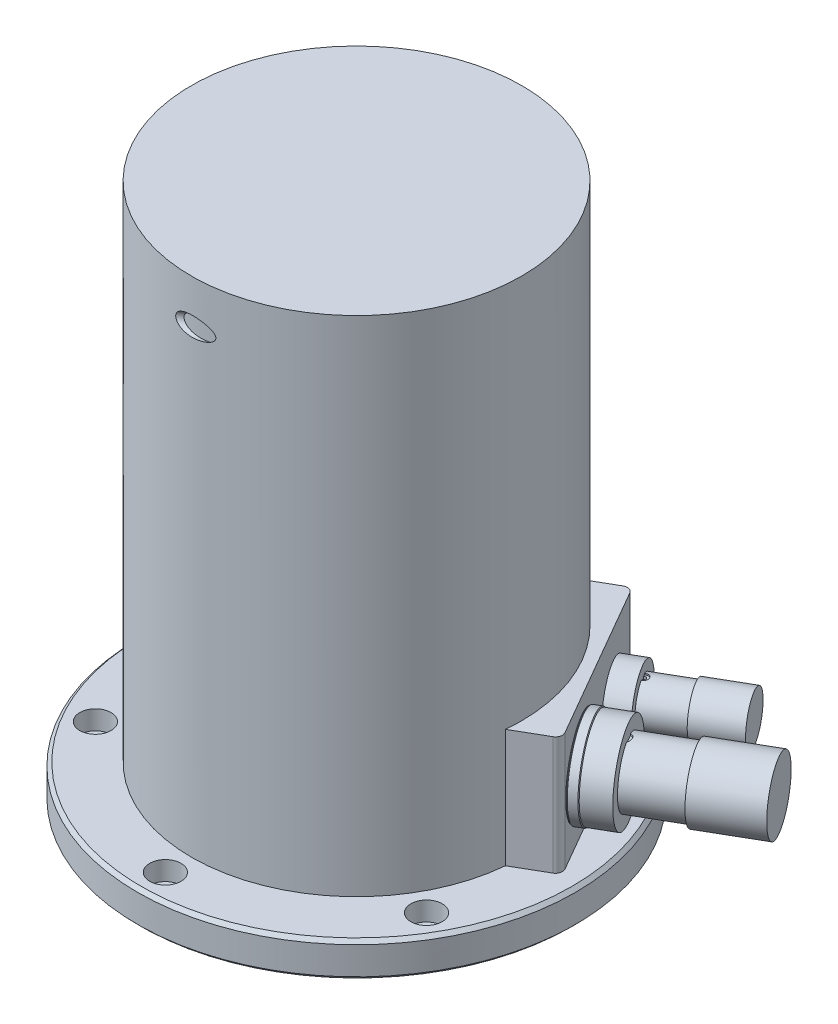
ISO-10303-21;
HEADER;
FILE_DESCRIPTION(('STEP AP214'),'2;1');
FILE_NAME('part.step','',(''),(''),'','','');
FILE_SCHEMA(('AUTOMOTIVE_DESIGN { 1 0 10303 214 1 1 1 1 }'));
ENDSEC;
DATA;
#1=APPLICATION_CONTEXT('core data for automotive mechanical design processes');
#2=APPLICATION_PROTOCOL_DEFINITION('international standard','automotive_design',2000,#1);
#3=PRODUCT_CONTEXT('',#1,'mechanical');
#4=PRODUCT('Part','Part','',(#3));
#5=PRODUCT_RELATED_PRODUCT_CATEGORY('part','',(#4));
#6=PRODUCT_DEFINITION_FORMATION('','',#4);
#7=PRODUCT_DEFINITION_CONTEXT('part definition',#1,'design');
#8=PRODUCT_DEFINITION('design','',#6,#7);
#9=PRODUCT_DEFINITION_SHAPE('','',#8);
#10=(LENGTH_UNIT() NAMED_UNIT(*) SI_UNIT(.MILLI.,.METRE.));
#11=(NAMED_UNIT(*) PLANE_ANGLE_UNIT() SI_UNIT($,.RADIAN.));
#12=(NAMED_UNIT(*) SI_UNIT($,.STERADIAN.) SOLID_ANGLE_UNIT());
#13=UNCERTAINTY_MEASURE_WITH_UNIT(LENGTH_MEASURE(1.E-05),#10,'distance_accuracy_value','');
#14=(GEOMETRIC_REPRESENTATION_CONTEXT(3) GLOBAL_UNCERTAINTY_ASSIGNED_CONTEXT((#13)) GLOBAL_UNIT_ASSIGNED_CONTEXT((#10,
#11,#12)) REPRESENTATION_CONTEXT('',''));
#15=CARTESIAN_POINT('',(0.,0.,0.));
#16=DIRECTION('',(0.,0.,1.));
#17=DIRECTION('',(1.,0.,0.));
#18=AXIS2_PLACEMENT_3D('',#15,#16,#17);
#19=CARTESIAN_POINT('',(88.1858882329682,2.70598415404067,-34.748032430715));
#20=DIRECTION('',(0.866025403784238,0.,-0.500000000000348));
#21=DIRECTION('',(-0.500000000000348,0.,-0.866025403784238));
#22=AXIS2_PLACEMENT_3D('',#19,#20,#21);
#23=PLANE('',#22);
#24=CARTESIAN_POINT('',(88.1858882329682,2.70598415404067,-34.748032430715));
#25=DIRECTION('',(0.866025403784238,0.,-0.500000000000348));
#26=DIRECTION('',(-0.500000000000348,0.,-0.866025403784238));
#27=AXIS2_PLACEMENT_3D('',#24,#25,#26);
#28=CIRCLE('',#27,9.59);
#29=CARTESIAN_POINT('',(83.3908882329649,2.70598415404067,-43.0532160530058));
#30=VERTEX_POINT('',#29);
#31=EDGE_CURVE('E20',#30,#30,#28,.F.);
#32=ORIENTED_EDGE('',*,*,#31,.F.);
#33=EDGE_LOOP('',(#32));
#34=FACE_BOUND('',#33,.T.);
#35=ADVANCED_FACE('F17',(#34),#23,.T.);
#36=CARTESIAN_POINT('',(88.1858882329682,2.70598415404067,-34.748032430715));
#37=DIRECTION('',(0.866025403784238,0.,-0.500000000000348));
#38=DIRECTION('',(-0.500000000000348,0.,-0.866025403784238));
#39=AXIS2_PLACEMENT_3D('',#36,#37,#38);
#40=CYLINDRICAL_SURFACE('',#39,9.59);
#41=ORIENTED_EDGE('',*,*,#31,.T.);
#42=EDGE_LOOP('',(#41));
#43=FACE_BOUND('',#42,.T.);
#44=CARTESIAN_POINT('',(73.2729307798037,2.70598415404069,-26.138032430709));
#45=DIRECTION('',(0.866025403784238,0.,-0.500000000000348));
#46=DIRECTION('',(-0.500000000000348,0.,-0.866025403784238));
#47=AXIS2_PLACEMENT_3D('',#44,#45,#46);
#48=CIRCLE('',#47,9.59);
#49=CARTESIAN_POINT('',(68.4779307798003,2.70598415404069,-34.4432160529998));
#50=VERTEX_POINT('',#49);
#51=EDGE_CURVE('E311',#50,#50,#48,.F.);
#52=ORIENTED_EDGE('',*,*,#51,.F.);
#53=EDGE_LOOP('',(#52));
#54=FACE_BOUND('',#53,.T.);
#55=ADVANCED_FACE('F1385',(#43,#54),#40,.T.);
#56=CARTESIAN_POINT('',(0.336536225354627,-23.4077349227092,44.2518347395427));
#57=DIRECTION('',(0.,-1.,0.));
#58=DIRECTION('',(0.,0.,-1.));
#59=AXIS2_PLACEMENT_3D('',#56,#57,#58);
#60=CYLINDRICAL_SURFACE('',#59,2.29999999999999);
#61=CARTESIAN_POINT('',(0.336536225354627,-20.8077349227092,44.2518347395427));
#62=DIRECTION('',(0.,-1.,0.));
#63=DIRECTION('',(0.,0.,-1.));
#64=AXIS2_PLACEMENT_3D('',#61,#62,#63);
#65=CIRCLE('',#64,2.29999999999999);
#66=CARTESIAN_POINT('',(2.63488085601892,-20.8077349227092,44.3390812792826));
#67=VERTEX_POINT('',#66);
#68=CARTESIAN_POINT('',(-1.96180840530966,-20.8077349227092,44.1645881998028));
#69=VERTEX_POINT('',#68);
#70=EDGE_CURVE('E271',#67,#69,#65,.F.);
#71=ORIENTED_EDGE('',*,*,#70,.T.);
#72=DIRECTION('',(0.,1.,0.));
#73=VECTOR('',#72,1.);
#74=CARTESIAN_POINT('',(-1.96180840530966,-10.6290150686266,44.1645881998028));
#75=LINE('',#74,#73);
#76=CARTESIAN_POINT('',(-1.96180840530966,-23.4077349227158,44.1645881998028));
#77=VERTEX_POINT('',#76);
#78=EDGE_CURVE('E283',#69,#77,#75,.F.);
#79=ORIENTED_EDGE('',*,*,#78,.T.);
#80=CARTESIAN_POINT('',(0.336536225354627,-23.4077349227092,44.2518347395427));
#81=DIRECTION('',(0.,-1.,0.));
#82=DIRECTION('',(0.,0.,-1.));
#83=AXIS2_PLACEMENT_3D('',#80,#81,#82);
#84=CIRCLE('',#83,2.29999999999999);
#85=CARTESIAN_POINT('',(2.63488085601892,-23.4077349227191,44.3390812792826));
#86=VERTEX_POINT('',#85);
#87=EDGE_CURVE('E254',#86,#77,#84,.F.);
#88=ORIENTED_EDGE('',*,*,#87,.F.);
#89=DIRECTION('',(0.,1.,0.));
#90=VECTOR('',#89,1.);
#91=CARTESIAN_POINT('',(2.63488085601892,-10.6290150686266,44.3390812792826));
#92=LINE('',#91,#90);
#93=EDGE_CURVE('E268',#86,#67,#92,.T.);
#94=ORIENTED_EDGE('',*,*,#93,.T.);
#95=EDGE_LOOP('',(#71,#79,#88,#94));
#96=FACE_BOUND('',#95,.T.);
#97=ADVANCED_FACE('F1375',(#96),#60,.F.);
#98=CARTESIAN_POINT('',(-41.6743275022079,-23.4077349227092,-1.07439749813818));
#99=DIRECTION('',(0.,-1.,0.));
#100=DIRECTION('',(0.,0.,-1.));
#101=AXIS2_PLACEMENT_3D('',#98,#99,#100);
#102=CYLINDRICAL_SURFACE('',#101,2.3);
#103=CARTESIAN_POINT('',(-41.6743275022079,-20.8077349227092,-1.07439749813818));
#104=DIRECTION('',(0.,-1.,0.));
#105=DIRECTION('',(0.,0.,-1.));
#106=AXIS2_PLACEMENT_3D('',#103,#104,#105);
#107=CIRCLE('',#106,2.3);
#108=CARTESIAN_POINT('',(-41.7615740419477,-20.8077349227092,1.22394713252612));
#109=VERTEX_POINT('',#108);
#110=CARTESIAN_POINT('',(-41.587080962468,-20.8077349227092,-3.37274212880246));
#111=VERTEX_POINT('',#110);
#112=EDGE_CURVE('E287',#109,#111,#107,.F.);
#113=ORIENTED_EDGE('',*,*,#112,.T.);
#114=DIRECTION('',(0.,1.,0.));
#115=VECTOR('',#114,1.);
#116=CARTESIAN_POINT('',(-41.587080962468,-10.6290150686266,-3.37274212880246));
#117=LINE('',#116,#115);
#118=CARTESIAN_POINT('',(-41.587080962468,-23.4077349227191,-3.37274212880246));
#119=VERTEX_POINT('',#118);
#120=EDGE_CURVE('E298',#111,#119,#117,.F.);
#121=ORIENTED_EDGE('',*,*,#120,.T.);
#122=CARTESIAN_POINT('',(-41.6743275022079,-23.4077349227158,-1.07439749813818));
#123=DIRECTION('',(0.,-1.,0.));
#124=DIRECTION('',(0.,0.,-1.));
#125=AXIS2_PLACEMENT_3D('',#122,#123,#124);
#126=CIRCLE('',#125,2.3);
#127=CARTESIAN_POINT('',(-41.7615740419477,-23.4077349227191,1.22394713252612));
#128=VERTEX_POINT('',#127);
#129=EDGE_CURVE('E248',#128,#119,#126,.F.);
#130=ORIENTED_EDGE('',*,*,#129,.F.);
#131=DIRECTION('',(0.,1.,0.));
#132=VECTOR('',#131,1.);
#133=CARTESIAN_POINT('',(-41.7615740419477,-10.6290150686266,1.22394713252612));
#134=LINE('',#133,#132);
#135=EDGE_CURVE('E284',#128,#109,#134,.T.);
#136=ORIENTED_EDGE('',*,*,#135,.T.);
#137=EDGE_LOOP('',(#113,#121,#130,#136));
#138=FACE_BOUND('',#137,.T.);
#139=ADVANCED_FACE('F1365',(#138),#102,.F.);
#140=CARTESIAN_POINT('',(3.651904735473,-23.4077349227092,-43.0852612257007));
#141=DIRECTION('',(0.,-1.,0.));
#142=DIRECTION('',(0.,0.,-1.));
#143=AXIS2_PLACEMENT_3D('',#140,#141,#142);
#144=CYLINDRICAL_SURFACE('',#143,2.3);
#145=CARTESIAN_POINT('',(3.651904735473,-20.8077349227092,-43.0852612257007));
#146=DIRECTION('',(0.,-1.,0.));
#147=DIRECTION('',(0.,0.,-1.));
#148=AXIS2_PLACEMENT_3D('',#145,#146,#147);
#149=CIRCLE('',#148,2.3);
#150=CARTESIAN_POINT('',(1.35356010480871,-20.8077349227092,-43.1725077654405));
#151=VERTEX_POINT('',#150);
#152=CARTESIAN_POINT('',(5.95024936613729,-20.8077349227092,-42.9980146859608));
#153=VERTEX_POINT('',#152);
#154=EDGE_CURVE('E302',#151,#153,#149,.F.);
#155=ORIENTED_EDGE('',*,*,#154,.T.);
#156=DIRECTION('',(0.,1.,0.));
#157=VECTOR('',#156,1.);
#158=CARTESIAN_POINT('',(5.95024936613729,-10.6290150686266,-42.9980146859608));
#159=LINE('',#158,#157);
#160=CARTESIAN_POINT('',(5.95024936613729,-23.4077349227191,-42.9980146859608));
#161=VERTEX_POINT('',#160);
#162=EDGE_CURVE('E224',#153,#161,#159,.F.);
#163=ORIENTED_EDGE('',*,*,#162,.T.);
#164=CARTESIAN_POINT('',(3.651904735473,-23.4077349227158,-43.0852612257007));
#165=DIRECTION('',(0.,-1.,0.));
#166=DIRECTION('',(0.,0.,-1.));
#167=AXIS2_PLACEMENT_3D('',#164,#165,#166);
#168=CIRCLE('',#167,2.3);
#169=CARTESIAN_POINT('',(1.35356010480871,-23.4077349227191,-43.1725077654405));
#170=VERTEX_POINT('',#169);
#171=EDGE_CURVE('E245',#170,#161,#168,.F.);
#172=ORIENTED_EDGE('',*,*,#171,.F.);
#173=DIRECTION('',(0.,1.,0.));
#174=VECTOR('',#173,1.);
#175=CARTESIAN_POINT('',(1.35356010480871,-10.6290150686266,-43.1725077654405));
#176=LINE('',#175,#174);
#177=EDGE_CURVE('E299',#170,#151,#176,.T.);
#178=ORIENTED_EDGE('',*,*,#177,.T.);
#179=EDGE_LOOP('',(#155,#163,#172,#178));
#180=FACE_BOUND('',#179,.T.);
#181=ADVANCED_FACE('F1356',(#180),#144,.F.);
#182=CARTESIAN_POINT('',(45.6627684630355,-23.4077349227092,2.24097101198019));
#183=DIRECTION('',(0.,-1.,0.));
#184=DIRECTION('',(0.,0.,-1.));
#185=AXIS2_PLACEMENT_3D('',#182,#183,#184);
#186=CYLINDRICAL_SURFACE('',#185,2.3);
#187=CARTESIAN_POINT('',(45.6627684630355,-20.8077349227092,2.24097101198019));
#188=DIRECTION('',(0.,-1.,0.));
#189=DIRECTION('',(0.,0.,-1.));
#190=AXIS2_PLACEMENT_3D('',#187,#188,#189);
#191=CIRCLE('',#190,2.3);
#192=CARTESIAN_POINT('',(45.7500150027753,-20.8077349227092,-0.057373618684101));
#193=VERTEX_POINT('',#192);
#194=CARTESIAN_POINT('',(45.5755219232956,-20.8077349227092,4.53931564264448));
#195=VERTEX_POINT('',#194);
#196=EDGE_CURVE('E205',#193,#195,#191,.F.);
#197=ORIENTED_EDGE('',*,*,#196,.T.);
#198=DIRECTION('',(0.,1.,0.));
#199=VECTOR('',#198,1.);
#200=CARTESIAN_POINT('',(45.5755219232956,-10.6290150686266,4.53931564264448));
#201=LINE('',#200,#199);
#202=CARTESIAN_POINT('',(45.5755219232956,-23.4077349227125,4.53931564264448));
#203=VERTEX_POINT('',#202);
#204=EDGE_CURVE('E232',#195,#203,#201,.F.);
#205=ORIENTED_EDGE('',*,*,#204,.T.);
#206=CARTESIAN_POINT('',(45.6627684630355,-23.4077349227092,2.24097101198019));
#207=DIRECTION('',(0.,-1.,0.));
#208=DIRECTION('',(0.,0.,-1.));
#209=AXIS2_PLACEMENT_3D('',#206,#207,#208);
#210=CIRCLE('',#209,2.3);
#211=CARTESIAN_POINT('',(45.7500150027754,-23.4077349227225,-0.0573736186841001));
#212=VERTEX_POINT('',#211);
#213=EDGE_CURVE('E221',#212,#203,#210,.F.);
#214=ORIENTED_EDGE('',*,*,#213,.F.);
#215=DIRECTION('',(0.,1.,0.));
#216=VECTOR('',#215,1.);
#217=CARTESIAN_POINT('',(45.7500150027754,-10.6290150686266,-0.0573736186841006));
#218=LINE('',#217,#216);
#219=EDGE_CURVE('E218',#212,#193,#218,.T.);
#220=ORIENTED_EDGE('',*,*,#219,.T.);
#221=EDGE_LOOP('',(#197,#205,#214,#220));
#222=FACE_BOUND('',#221,.T.);
#223=ADVANCED_FACE('F219',(#222),#186,.F.);
#224=CARTESIAN_POINT('',(73.2729307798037,2.70598415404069,-26.138032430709));
#225=DIRECTION('',(-0.866025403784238,0.,0.500000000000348));
#226=DIRECTION('',(0.500000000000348,0.,0.866025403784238));
#227=AXIS2_PLACEMENT_3D('',#224,#225,#226);
#228=PLANE('',#227);
#229=CARTESIAN_POINT('',(73.2729307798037,2.70598415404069,-26.138032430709));
#230=DIRECTION('',(0.866025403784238,0.,-0.500000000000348));
#231=DIRECTION('',(-0.500000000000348,0.,-0.866025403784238));
#232=AXIS2_PLACEMENT_3D('',#229,#230,#231);
#233=CIRCLE('',#232,8.68);
#234=CARTESIAN_POINT('',(68.9329307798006,2.70598415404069,-33.6551329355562));
#235=VERTEX_POINT('',#234);
#236=EDGE_CURVE('E486',#235,#235,#233,.F.);
#237=ORIENTED_EDGE('',*,*,#236,.F.);
#238=EDGE_LOOP('',(#237));
#239=FACE_BOUND('',#238,.T.);
#240=ORIENTED_EDGE('',*,*,#51,.T.);
#241=EDGE_LOOP('',(#240));
#242=FACE_BOUND('',#241,.T.);
#243=ADVANCED_FACE('F1338',(#239,#242),#228,.T.);
#244=CARTESIAN_POINT('',(45.7500150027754,-10.6290150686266,-0.0573736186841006));
#245=DIRECTION('',(0.0379332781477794,0.,-0.999280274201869));
#246=DIRECTION('',(-0.999280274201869,0.,-0.0379332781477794));
#247=AXIS2_PLACEMENT_3D('',#244,#245,#246);
#248=PLANE('',#247);
#249=ORIENTED_EDGE('',*,*,#219,.F.);
#250=DIRECTION('',(-0.999280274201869,0.,-0.0379332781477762));
#251=VECTOR('',#250,1.);
#252=CARTESIAN_POINT('',(47.8908116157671,-23.4077349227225,0.0238923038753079));
#253=LINE('',#252,#251);
#254=CARTESIAN_POINT('',(47.8908116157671,-23.4077349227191,0.023892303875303));
#255=VERTEX_POINT('',#254);
#256=EDGE_CURVE('E258',#255,#212,#253,.T.);
#257=ORIENTED_EDGE('',*,*,#256,.F.);
#258=DIRECTION('',(0.,-1.,0.));
#259=VECTOR('',#258,1.);
#260=CARTESIAN_POINT('',(47.8908116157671,-19.4067349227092,0.0238923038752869));
#261=LINE('',#260,#259);
#262=CARTESIAN_POINT('',(47.8908116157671,-20.8077349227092,0.0238923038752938));
#263=VERTEX_POINT('',#262);
#264=EDGE_CURVE('E229',#263,#255,#261,.T.);
#265=ORIENTED_EDGE('',*,*,#264,.F.);
#266=DIRECTION('',(-0.99928027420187,0.,-0.0379332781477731));
#267=VECTOR('',#266,1.);
#268=CARTESIAN_POINT('',(47.8908116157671,-20.8077349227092,0.0238923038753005));
#269=LINE('',#268,#267);
#270=EDGE_CURVE('E210',#263,#193,#269,.T.);
#271=ORIENTED_EDGE('',*,*,#270,.T.);
#272=EDGE_LOOP('',(#249,#257,#265,#271));
#273=FACE_BOUND('',#272,.T.);
#274=ADVANCED_FACE('F227',(#273),#248,.F.);
#275=CARTESIAN_POINT('',(5.95024936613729,-10.6290150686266,-42.9980146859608));
#276=DIRECTION('',(0.999280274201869,0.,0.0379332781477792));
#277=DIRECTION('',(0.0379332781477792,0.,-0.999280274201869));
#278=AXIS2_PLACEMENT_3D('',#275,#276,#277);
#279=PLANE('',#278);
#280=ORIENTED_EDGE('',*,*,#162,.F.);
#281=DIRECTION('',(0.0379332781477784,0.,-0.999280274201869));
#282=VECTOR('',#281,1.);
#283=CARTESIAN_POINT('',(5.95024936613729,-20.8077349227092,-42.9980146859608));
#284=LINE('',#283,#282);
#285=CARTESIAN_POINT('',(6.03151528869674,-20.8077349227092,-45.1388112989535));
#286=VERTEX_POINT('',#285);
#287=EDGE_CURVE('E300',#153,#286,#284,.T.);
#288=ORIENTED_EDGE('',*,*,#287,.T.);
#289=DIRECTION('',(0.,-1.,0.));
#290=VECTOR('',#289,1.);
#291=CARTESIAN_POINT('',(6.03151528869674,-19.4067349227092,-45.1388112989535));
#292=LINE('',#291,#290);
#293=CARTESIAN_POINT('',(6.03151528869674,-23.4077349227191,-45.1388112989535));
#294=VERTEX_POINT('',#293);
#295=EDGE_CURVE('E303',#294,#286,#292,.F.);
#296=ORIENTED_EDGE('',*,*,#295,.F.);
#297=DIRECTION('',(0.0379332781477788,0.,-0.999280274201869));
#298=VECTOR('',#297,1.);
#299=CARTESIAN_POINT('',(5.95024936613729,-23.4077349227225,-42.9980146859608));
#300=LINE('',#299,#298);
#301=EDGE_CURVE('E260',#161,#294,#300,.T.);
#302=ORIENTED_EDGE('',*,*,#301,.F.);
#303=EDGE_LOOP('',(#280,#288,#296,#302));
#304=FACE_BOUND('',#303,.T.);
#305=ADVANCED_FACE('F1319',(#304),#279,.F.);
#306=CARTESIAN_POINT('',(5.10086113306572,-20.8077349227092,-43.0302579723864));
#307=DIRECTION('',(0.,1.,0.));
#308=DIRECTION('',(0.,0.,1.));
#309=AXIS2_PLACEMENT_3D('',#306,#307,#308);
#310=PLANE('',#309);
#311=ORIENTED_EDGE('',*,*,#154,.F.);
#312=DIRECTION('',(-0.0379332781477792,0.,0.999280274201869));
#313=VECTOR('',#312,1.);
#314=CARTESIAN_POINT('',(1.35356010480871,-20.8077349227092,-43.1725077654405));
#315=LINE('',#314,#313);
#316=CARTESIAN_POINT('',(1.43482602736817,-20.8077349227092,-45.3133043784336));
#317=VERTEX_POINT('',#316);
#318=EDGE_CURVE('E296',#151,#317,#315,.F.);
#319=ORIENTED_EDGE('',*,*,#318,.T.);
#320=CARTESIAN_POINT('',(1.99422048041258,-20.8077349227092,0.58328675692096));
#321=DIRECTION('',(0.,-1.,0.));
#322=DIRECTION('',(1.,0.,0.));
#323=AXIS2_PLACEMENT_3D('',#320,#321,#322);
#324=CIRCLE('',#323,45.9);
#325=EDGE_CURVE('E295',#286,#317,#324,.F.);
#326=ORIENTED_EDGE('',*,*,#325,.F.);
#327=ORIENTED_EDGE('',*,*,#287,.F.);
#328=EDGE_LOOP('',(#311,#319,#326,#327));
#329=FACE_BOUND('',#328,.T.);
#330=ADVANCED_FACE('F1309',(#329),#310,.F.);
#331=CARTESIAN_POINT('',(1.35356010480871,-10.6290150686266,-43.1725077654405));
#332=DIRECTION('',(-0.999280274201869,0.,-0.0379332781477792));
#333=DIRECTION('',(-0.0379332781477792,0.,0.999280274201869));
#334=AXIS2_PLACEMENT_3D('',#331,#332,#333);
#335=PLANE('',#334);
#336=ORIENTED_EDGE('',*,*,#177,.F.);
#337=DIRECTION('',(-0.0379332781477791,0.,0.999280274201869));
#338=VECTOR('',#337,1.);
#339=CARTESIAN_POINT('',(1.43482602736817,-23.4077349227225,-45.3133043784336));
#340=LINE('',#339,#338);
#341=CARTESIAN_POINT('',(1.43482602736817,-23.4077349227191,-45.3133043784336));
#342=VERTEX_POINT('',#341);
#343=EDGE_CURVE('E242',#342,#170,#340,.T.);
#344=ORIENTED_EDGE('',*,*,#343,.F.);
#345=DIRECTION('',(0.,-1.,0.));
#346=VECTOR('',#345,1.);
#347=CARTESIAN_POINT('',(1.43482602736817,-19.4067349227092,-45.3133043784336));
#348=LINE('',#347,#346);
#349=EDGE_CURVE('E292',#317,#342,#348,.T.);
#350=ORIENTED_EDGE('',*,*,#349,.F.);
#351=ORIENTED_EDGE('',*,*,#318,.F.);
#352=EDGE_LOOP('',(#336,#344,#350,#351));
#353=FACE_BOUND('',#352,.T.);
#354=ADVANCED_FACE('F1299',(#353),#335,.F.);
#355=CARTESIAN_POINT('',(-41.587080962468,-10.6290150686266,-3.37274212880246));
#356=DIRECTION('',(0.0379332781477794,0.,-0.999280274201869));
#357=DIRECTION('',(-0.999280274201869,0.,-0.0379332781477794));
#358=AXIS2_PLACEMENT_3D('',#355,#356,#357);
#359=PLANE('',#358);
#360=ORIENTED_EDGE('',*,*,#120,.F.);
#361=DIRECTION('',(-0.999280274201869,0.,-0.037933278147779));
#362=VECTOR('',#361,1.);
#363=CARTESIAN_POINT('',(-41.587080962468,-20.8077349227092,-3.37274212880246));
#364=LINE('',#363,#362);
#365=CARTESIAN_POINT('',(-43.7278775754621,-20.8077349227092,-3.45400805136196));
#366=VERTEX_POINT('',#365);
#367=EDGE_CURVE('E285',#111,#366,#364,.T.);
#368=ORIENTED_EDGE('',*,*,#367,.T.);
#369=DIRECTION('',(0.,-1.,0.));
#370=VECTOR('',#369,1.);
#371=CARTESIAN_POINT('',(-43.7278775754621,-19.4067349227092,-3.45400805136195));
#372=LINE('',#371,#370);
#373=CARTESIAN_POINT('',(-43.7278775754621,-23.4077349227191,-3.45400805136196));
#374=VERTEX_POINT('',#373);
#375=EDGE_CURVE('E288',#374,#366,#372,.F.);
#376=ORIENTED_EDGE('',*,*,#375,.F.);
#377=DIRECTION('',(-0.999280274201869,0.,-0.0379332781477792));
#378=VECTOR('',#377,1.);
#379=CARTESIAN_POINT('',(-41.587080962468,-23.4077349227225,-3.37274212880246));
#380=LINE('',#379,#378);
#381=EDGE_CURVE('E246',#119,#374,#380,.T.);
#382=ORIENTED_EDGE('',*,*,#381,.F.);
#383=EDGE_LOOP('',(#360,#368,#376,#382));
#384=FACE_BOUND('',#383,.T.);
#385=ADVANCED_FACE('F1289',(#384),#359,.F.);
#386=CARTESIAN_POINT('',(-40.2253711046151,-20.8077349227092,-1.0193942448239));
#387=DIRECTION('',(0.,1.,0.));
#388=DIRECTION('',(0.,0.,1.));
#389=AXIS2_PLACEMENT_3D('',#386,#387,#388);
#390=PLANE('',#389);
#391=ORIENTED_EDGE('',*,*,#112,.F.);
#392=DIRECTION('',(0.999280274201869,0.,0.0379332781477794));
#393=VECTOR('',#392,1.);
#394=CARTESIAN_POINT('',(-41.7615740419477,-20.8077349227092,1.22394713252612));
#395=LINE('',#394,#393);
#396=CARTESIAN_POINT('',(-43.902370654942,-20.8077349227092,1.14268120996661));
#397=VERTEX_POINT('',#396);
#398=EDGE_CURVE('E280',#109,#397,#395,.F.);
#399=ORIENTED_EDGE('',*,*,#398,.T.);
#400=CARTESIAN_POINT('',(1.99422048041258,-20.8077349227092,0.58328675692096));
#401=DIRECTION('',(0.,-1.,0.));
#402=DIRECTION('',(1.,0.,0.));
#403=AXIS2_PLACEMENT_3D('',#400,#401,#402);
#404=CIRCLE('',#403,45.9);
#405=EDGE_CURVE('E279',#366,#397,#404,.F.);
#406=ORIENTED_EDGE('',*,*,#405,.F.);
#407=ORIENTED_EDGE('',*,*,#367,.F.);
#408=EDGE_LOOP('',(#391,#399,#406,#407));
#409=FACE_BOUND('',#408,.T.);
#410=ADVANCED_FACE('F1279',(#409),#390,.F.);
#411=CARTESIAN_POINT('',(-41.7615740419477,-10.6290150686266,1.22394713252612));
#412=DIRECTION('',(-0.0379332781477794,0.,0.999280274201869));
#413=DIRECTION('',(0.999280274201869,0.,0.0379332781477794));
#414=AXIS2_PLACEMENT_3D('',#411,#412,#413);
#415=PLANE('',#414);
#416=ORIENTED_EDGE('',*,*,#135,.F.);
#417=DIRECTION('',(0.999280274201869,0.,0.0379332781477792));
#418=VECTOR('',#417,1.);
#419=CARTESIAN_POINT('',(-43.902370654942,-23.4077349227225,1.14268120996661));
#420=LINE('',#419,#418);
#421=CARTESIAN_POINT('',(-43.902370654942,-23.4077349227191,1.14268120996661));
#422=VERTEX_POINT('',#421);
#423=EDGE_CURVE('E249',#422,#128,#420,.T.);
#424=ORIENTED_EDGE('',*,*,#423,.F.);
#425=DIRECTION('',(0.,-1.,0.));
#426=VECTOR('',#425,1.);
#427=CARTESIAN_POINT('',(-43.902370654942,-19.4067349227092,1.14268120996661));
#428=LINE('',#427,#426);
#429=EDGE_CURVE('E276',#397,#422,#428,.T.);
#430=ORIENTED_EDGE('',*,*,#429,.F.);
#431=ORIENTED_EDGE('',*,*,#398,.F.);
#432=EDGE_LOOP('',(#416,#424,#430,#431));
#433=FACE_BOUND('',#432,.T.);
#434=ADVANCED_FACE('F1269',(#433),#415,.F.);
#435=CARTESIAN_POINT('',(-1.96180840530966,-10.6290150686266,44.1645881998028));
#436=DIRECTION('',(-0.999280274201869,0.,-0.0379332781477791));
#437=DIRECTION('',(-0.0379332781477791,0.,0.999280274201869));
#438=AXIS2_PLACEMENT_3D('',#435,#436,#437);
#439=PLANE('',#438);
#440=ORIENTED_EDGE('',*,*,#78,.F.);
#441=DIRECTION('',(-0.0379332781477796,0.,0.999280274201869));
#442=VECTOR('',#441,1.);
#443=CARTESIAN_POINT('',(-1.96180840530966,-20.8077349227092,44.1645881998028));
#444=LINE('',#443,#442);
#445=CARTESIAN_POINT('',(-2.04307432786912,-20.8077349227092,46.3053848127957));
#446=VERTEX_POINT('',#445);
#447=EDGE_CURVE('E269',#69,#446,#444,.T.);
#448=ORIENTED_EDGE('',*,*,#447,.T.);
#449=DIRECTION('',(0.,-1.,0.));
#450=VECTOR('',#449,1.);
#451=CARTESIAN_POINT('',(-2.04307432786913,-19.4067349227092,46.3053848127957));
#452=LINE('',#451,#450);
#453=CARTESIAN_POINT('',(-2.04307432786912,-23.4077349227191,46.3053848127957));
#454=VERTEX_POINT('',#453);
#455=EDGE_CURVE('E272',#454,#446,#452,.F.);
#456=ORIENTED_EDGE('',*,*,#455,.F.);
#457=DIRECTION('',(-0.03793327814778,0.,0.999280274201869));
#458=VECTOR('',#457,1.);
#459=CARTESIAN_POINT('',(-1.96180840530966,-23.4077349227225,44.1645881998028));
#460=LINE('',#459,#458);
#461=EDGE_CURVE('E252',#77,#454,#460,.T.);
#462=ORIENTED_EDGE('',*,*,#461,.F.);
#463=EDGE_LOOP('',(#440,#448,#456,#462));
#464=FACE_BOUND('',#463,.T.);
#465=ADVANCED_FACE('F1259',(#464),#439,.F.);
#466=CARTESIAN_POINT('',(1.78549262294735,-20.8077349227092,44.3068379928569));
#467=DIRECTION('',(0.,1.,0.));
#468=DIRECTION('',(0.,0.,1.));
#469=AXIS2_PLACEMENT_3D('',#466,#467,#468);
#470=PLANE('',#469);
#471=ORIENTED_EDGE('',*,*,#70,.F.);
#472=DIRECTION('',(0.0379332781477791,0.,-0.999280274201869));
#473=VECTOR('',#472,1.);
#474=CARTESIAN_POINT('',(2.63488085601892,-20.8077349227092,44.3390812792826));
#475=LINE('',#474,#473);
#476=CARTESIAN_POINT('',(2.55361493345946,-20.8077349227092,46.4798778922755));
#477=VERTEX_POINT('',#476);
#478=EDGE_CURVE('E262',#67,#477,#475,.F.);
#479=ORIENTED_EDGE('',*,*,#478,.T.);
#480=CARTESIAN_POINT('',(1.99422048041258,-20.8077349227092,0.58328675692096));
#481=DIRECTION('',(0.,-1.,0.));
#482=DIRECTION('',(1.,0.,0.));
#483=AXIS2_PLACEMENT_3D('',#480,#481,#482);
#484=CIRCLE('',#483,45.9);
#485=EDGE_CURVE('E266',#446,#477,#484,.F.);
#486=ORIENTED_EDGE('',*,*,#485,.F.);
#487=ORIENTED_EDGE('',*,*,#447,.F.);
#488=EDGE_LOOP('',(#471,#479,#486,#487));
#489=FACE_BOUND('',#488,.T.);
#490=ADVANCED_FACE('F1249',(#489),#470,.F.);
#491=CARTESIAN_POINT('',(2.63488085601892,-10.6290150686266,44.3390812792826));
#492=DIRECTION('',(0.999280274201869,0.,0.0379332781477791));
#493=DIRECTION('',(0.0379332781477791,0.,-0.999280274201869));
#494=AXIS2_PLACEMENT_3D('',#491,#492,#493);
#495=PLANE('',#494);
#496=ORIENTED_EDGE('',*,*,#93,.F.);
#497=DIRECTION('',(0.0379332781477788,0.,-0.999280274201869));
#498=VECTOR('',#497,1.);
#499=CARTESIAN_POINT('',(2.55361493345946,-23.4077349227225,46.4798778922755));
#500=LINE('',#499,#498);
#501=CARTESIAN_POINT('',(2.55361493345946,-23.4077349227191,46.4798778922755));
#502=VERTEX_POINT('',#501);
#503=EDGE_CURVE('E255',#502,#86,#500,.T.);
#504=ORIENTED_EDGE('',*,*,#503,.F.);
#505=DIRECTION('',(0.,-1.,0.));
#506=VECTOR('',#505,1.);
#507=CARTESIAN_POINT('',(2.55361493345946,-19.4067349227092,46.4798778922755));
#508=LINE('',#507,#506);
#509=EDGE_CURVE('E263',#477,#502,#508,.T.);
#510=ORIENTED_EDGE('',*,*,#509,.F.);
#511=ORIENTED_EDGE('',*,*,#478,.F.);
#512=EDGE_LOOP('',(#496,#504,#510,#511));
#513=FACE_BOUND('',#512,.T.);
#514=ADVANCED_FACE('F1239',(#513),#495,.F.);
#515=CARTESIAN_POINT('',(15.3159374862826,-23.4077349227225,4.95715742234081));
#516=DIRECTION('',(0.,-1.,0.));
#517=DIRECTION('',(0.,0.,-1.));
#518=AXIS2_PLACEMENT_3D('',#515,#516,#517);
#519=PLANE('',#518);
#520=ORIENTED_EDGE('',*,*,#343,.T.);
#521=ORIENTED_EDGE('',*,*,#171,.T.);
#522=ORIENTED_EDGE('',*,*,#301,.T.);
#523=CARTESIAN_POINT('',(1.99422048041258,-23.4077349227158,0.58328675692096));
#524=DIRECTION('',(0.,-1.,0.));
#525=DIRECTION('',(1.,0.,0.));
#526=AXIS2_PLACEMENT_3D('',#523,#524,#525);
#527=CIRCLE('',#526,45.9);
#528=EDGE_CURVE('E306',#255,#294,#527,.F.);
#529=ORIENTED_EDGE('',*,*,#528,.F.);
#530=ORIENTED_EDGE('',*,*,#256,.T.);
#531=ORIENTED_EDGE('',*,*,#213,.T.);
#532=DIRECTION('',(0.999280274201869,0.,0.0379332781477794));
#533=VECTOR('',#532,1.);
#534=CARTESIAN_POINT('',(45.5755219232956,-23.4077349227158,4.53931564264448));
#535=LINE('',#534,#533);
#536=CARTESIAN_POINT('',(47.7163185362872,-23.4077349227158,4.62058156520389));
#537=VERTEX_POINT('',#536);
#538=EDGE_CURVE('E230',#203,#537,#535,.T.);
#539=ORIENTED_EDGE('',*,*,#538,.T.);
#540=CARTESIAN_POINT('',(1.99422048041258,-23.4077349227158,0.58328675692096));
#541=DIRECTION('',(0.,-1.,0.));
#542=DIRECTION('',(1.,0.,0.));
#543=AXIS2_PLACEMENT_3D('',#540,#541,#542);
#544=CIRCLE('',#543,45.9);
#545=EDGE_CURVE('E240',#502,#537,#544,.F.);
#546=ORIENTED_EDGE('',*,*,#545,.F.);
#547=ORIENTED_EDGE('',*,*,#503,.T.);
#548=ORIENTED_EDGE('',*,*,#87,.T.);
#549=ORIENTED_EDGE('',*,*,#461,.T.);
#550=CARTESIAN_POINT('',(1.99422048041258,-23.4077349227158,0.58328675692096));
#551=DIRECTION('',(0.,-1.,0.));
#552=DIRECTION('',(1.,0.,0.));
#553=AXIS2_PLACEMENT_3D('',#550,#551,#552);
#554=CIRCLE('',#553,45.9);
#555=EDGE_CURVE('E275',#422,#454,#554,.F.);
#556=ORIENTED_EDGE('',*,*,#555,.F.);
#557=ORIENTED_EDGE('',*,*,#423,.T.);
#558=ORIENTED_EDGE('',*,*,#129,.T.);
#559=ORIENTED_EDGE('',*,*,#381,.T.);
#560=CARTESIAN_POINT('',(1.99422048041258,-23.4077349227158,0.58328675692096));
#561=DIRECTION('',(0.,-1.,0.));
#562=DIRECTION('',(1.,0.,0.));
#563=AXIS2_PLACEMENT_3D('',#560,#561,#562);
#564=CIRCLE('',#563,45.9);
#565=EDGE_CURVE('E291',#342,#374,#564,.F.);
#566=ORIENTED_EDGE('',*,*,#565,.F.);
#567=EDGE_LOOP('',(#520,#521,#522,#529,#530,#531,#539,#546,#547,#548,#549,#556,#557,#558,#559,#566));
#568=FACE_BOUND('',#567,.T.);
#569=ADVANCED_FACE('F1229',(#568),#519,.T.);
#570=CARTESIAN_POINT('',(45.5755219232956,-10.6290150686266,4.53931564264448));
#571=DIRECTION('',(-0.0379332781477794,0.,0.999280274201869));
#572=DIRECTION('',(0.999280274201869,0.,0.0379332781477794));
#573=AXIS2_PLACEMENT_3D('',#570,#571,#572);
#574=PLANE('',#573);
#575=ORIENTED_EDGE('',*,*,#204,.F.);
#576=DIRECTION('',(0.999280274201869,0.,0.0379332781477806));
#577=VECTOR('',#576,1.);
#578=CARTESIAN_POINT('',(45.5755219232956,-20.8077349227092,4.53931564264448));
#579=LINE('',#578,#577);
#580=CARTESIAN_POINT('',(47.7163185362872,-20.8077349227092,4.6205815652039));
#581=VERTEX_POINT('',#580);
#582=EDGE_CURVE('E212',#195,#581,#579,.T.);
#583=ORIENTED_EDGE('',*,*,#582,.T.);
#584=DIRECTION('',(0.,-1.,0.));
#585=VECTOR('',#584,1.);
#586=CARTESIAN_POINT('',(47.7163185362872,-19.4067349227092,4.6205815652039));
#587=LINE('',#586,#585);
#588=EDGE_CURVE('E237',#537,#581,#587,.F.);
#589=ORIENTED_EDGE('',*,*,#588,.F.);
#590=ORIENTED_EDGE('',*,*,#538,.F.);
#591=EDGE_LOOP('',(#575,#583,#589,#590));
#592=FACE_BOUND('',#591,.T.);
#593=ADVANCED_FACE('F1220',(#592),#574,.F.);
#594=CARTESIAN_POINT('',(47.1117248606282,-20.8077349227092,2.29597426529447));
#595=DIRECTION('',(0.,1.,0.));
#596=DIRECTION('',(0.,0.,1.));
#597=AXIS2_PLACEMENT_3D('',#594,#595,#596);
#598=PLANE('',#597);
#599=ORIENTED_EDGE('',*,*,#196,.F.);
#600=ORIENTED_EDGE('',*,*,#270,.F.);
#601=CARTESIAN_POINT('',(1.99422048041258,-20.8077349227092,0.58328675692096));
#602=DIRECTION('',(0.,-1.,0.));
#603=DIRECTION('',(1.,0.,0.));
#604=AXIS2_PLACEMENT_3D('',#601,#602,#603);
#605=CIRCLE('',#604,45.9);
#606=EDGE_CURVE('E239',#581,#263,#605,.F.);
#607=ORIENTED_EDGE('',*,*,#606,.F.);
#608=ORIENTED_EDGE('',*,*,#582,.F.);
#609=EDGE_LOOP('',(#599,#600,#607,#608));
#610=FACE_BOUND('',#609,.T.);
#611=ADVANCED_FACE('F207',(#610),#598,.F.);
#612=CARTESIAN_POINT('',(88.1858882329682,2.70598415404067,-34.748032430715));
#613=DIRECTION('',(0.866025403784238,0.,-0.500000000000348));
#614=DIRECTION('',(-0.500000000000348,0.,-0.866025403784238));
#615=AXIS2_PLACEMENT_3D('',#612,#613,#614);
#616=CYLINDRICAL_SURFACE('',#615,8.19);
#617=CARTESIAN_POINT('',(61.5322895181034,10.7469328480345,-17.563558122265));
#618=CARTESIAN_POINT('',(61.5570794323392,10.7521148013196,-17.6088133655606));
#619=CARTESIAN_POINT('',(61.5799213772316,10.7575167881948,-17.6550702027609));
#620=CARTESIAN_POINT('',(61.6215978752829,10.7686081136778,-17.7493424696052));
#621=CARTESIAN_POINT('',(61.6404309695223,10.7742975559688,-17.7973585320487));
#622=CARTESIAN_POINT('',(61.6905014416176,10.791485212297,-17.9429785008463));
#623=CARTESIAN_POINT('',(61.7156430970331,10.8031759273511,-18.042764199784));
#624=CARTESIAN_POINT('',(61.7401662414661,10.8198611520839,-18.192427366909));
#625=CARTESIAN_POINT('',(61.7461448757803,10.8251788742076,-18.2412982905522));
#626=CARTESIAN_POINT('',(61.7541341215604,10.8354970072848,-18.3394414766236));
#627=CARTESIAN_POINT('',(61.7561415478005,10.8404971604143,-18.3887140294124));
#628=CARTESIAN_POINT('',(61.7561355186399,10.8549895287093,-18.5384157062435));
#629=CARTESIAN_POINT('',(61.747806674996,10.8637723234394,-18.6389889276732));
#630=CARTESIAN_POINT('',(61.7145826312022,10.8785039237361,-18.8376664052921));
#631=CARTESIAN_POINT('',(61.6896665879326,10.8844491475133,-18.9357673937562));
#632=CARTESIAN_POINT('',(61.6238558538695,10.8928442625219,-19.1266550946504));
#633=CARTESIAN_POINT('',(61.582958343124,10.895293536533,-19.2194408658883));
#634=CARTESIAN_POINT('',(61.4863410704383,10.8964199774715,-19.3969289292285));
#635=CARTESIAN_POINT('',(61.4306261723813,10.8950983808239,-19.481633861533));
#636=CARTESIAN_POINT('',(61.3066449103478,10.8888660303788,-19.6397421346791));
#637=CARTESIAN_POINT('',(61.2385118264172,10.8839918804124,-19.7132515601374));
#638=CARTESIAN_POINT('',(61.0912717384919,10.8712215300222,-19.8480082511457));
#639=CARTESIAN_POINT('',(61.0121626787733,10.8633247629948,-19.909253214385));
#640=CARTESIAN_POINT('',(60.8443010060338,10.8452543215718,-20.0184690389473));
#641=CARTESIAN_POINT('',(60.7554550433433,10.8350573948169,-20.0662922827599));
#642=CARTESIAN_POINT('',(60.571224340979,10.8135273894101,-20.1465854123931));
#643=CARTESIAN_POINT('',(60.4758423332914,10.8021947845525,-20.179061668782));
#644=CARTESIAN_POINT('',(60.3128072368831,10.7832881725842,-20.2199173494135));
#645=CARTESIAN_POINT('',(60.2462259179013,10.7756905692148,-20.2326987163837));
#646=CARTESIAN_POINT('',(60.1121131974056,10.7609119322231,-20.2507676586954));
#647=CARTESIAN_POINT('',(60.0445833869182,10.753730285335,-20.2560665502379));
#648=CARTESIAN_POINT('',(59.9768975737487,10.7469328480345,-20.2575759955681));
#649=B_SPLINE_CURVE_WITH_KNOTS('',3,(#617,#618,#619,#620,#621,#622,#623,#624,#625,#626,#627,
#628,#629,#630,#631,#632,#633,#634,#635,#636,#637,#638,#639,#640,#641,#642,#643,#644,#645,#646,
#647,#648),.UNSPECIFIED.,.F.,.F.,(4,2,2,2,2,2,2,2,2,2,2,2,2,2,2,4),(0.,0.155462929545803,
0.31098233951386,0.619950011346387,0.76838782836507,0.916944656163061,1.21931903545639,
1.5220740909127,1.82488259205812,2.12759181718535,2.4272253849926,2.72691514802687,
3.02978225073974,3.3325235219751,3.53679492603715,3.74075706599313),.UNSPECIFIED.);
#650=CARTESIAN_POINT('',(61.5322895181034,10.7469328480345,-17.563558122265));
#651=VERTEX_POINT('',#650);
#652=CARTESIAN_POINT('',(59.9768975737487,10.7469328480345,-20.2575759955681));
#653=VERTEX_POINT('',#652);
#654=EDGE_CURVE('E1426',#651,#653,#649,.T.);
#655=ORIENTED_EDGE('',*,*,#654,.T.);
#656=CARTESIAN_POINT('',(60.7545935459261,2.7059841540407,-18.9105670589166));
#657=DIRECTION('',(0.866025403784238,0.,-0.500000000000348));
#658=DIRECTION('',(-0.500000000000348,0.,-0.866025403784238));
#659=AXIS2_PLACEMENT_3D('',#656,#657,#658);
#660=CIRCLE('',#659,8.19);
#661=EDGE_CURVE('E453',#653,#651,#660,.T.);
#662=ORIENTED_EDGE('',*,*,#661,.T.);
#663=EDGE_LOOP('',(#655,#662));
#664=FACE_BOUND('',#663,.T.);
#665=ADVANCED_FACE('F1205',(#664),#616,.T.);
#666=CARTESIAN_POINT('',(59.9361395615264,12.7873841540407,-18.4380324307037));
#667=DIRECTION('',(0.,-1.,0.));
#668=DIRECTION('',(1.,0.,0.));
#669=AXIS2_PLACEMENT_3D('',#666,#667,#668);
#670=CYLINDRICAL_SURFACE('',#669,1.82);
#671=CARTESIAN_POINT('',(59.9768975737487,11.2454897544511,-20.2575759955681));
#672=CARTESIAN_POINT('',(60.028311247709,11.2503527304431,-20.2564234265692));
#673=CARTESIAN_POINT('',(60.0796303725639,11.2554232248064,-20.2530932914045));
#674=CARTESIAN_POINT('',(60.1817734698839,11.265832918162,-20.2421126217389));
#675=CARTESIAN_POINT('',(60.232597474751,11.2711720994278,-20.2344623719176));
#676=CARTESIAN_POINT('',(60.3837703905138,11.2873627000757,-20.2051037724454));
#677=CARTESIAN_POINT('',(60.4829311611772,11.298398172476,-20.1769849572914));
#678=CARTESIAN_POINT('',(60.6751697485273,11.3197052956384,-20.1044084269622));
#679=CARTESIAN_POINT('',(60.7682446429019,11.3299765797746,-20.0599429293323));
#680=CARTESIAN_POINT('',(60.9456849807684,11.3486025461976,-19.9558549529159));
#681=CARTESIAN_POINT('',(61.0300538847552,11.3569579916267,-19.8962385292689));
#682=CARTESIAN_POINT('',(61.1871275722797,11.3707665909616,-19.763894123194));
#683=CARTESIAN_POINT('',(61.2599044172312,11.3762382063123,-19.6912536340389));
#684=CARTESIAN_POINT('',(61.3922964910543,11.3837422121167,-19.5346271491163));
#685=CARTESIAN_POINT('',(61.4519080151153,11.3857736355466,-19.4506379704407));
#686=CARTESIAN_POINT('',(61.555166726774,11.3861599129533,-19.2754700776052));
#687=CARTESIAN_POINT('',(61.5990893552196,11.384582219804,-19.1844534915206));
#688=CARTESIAN_POINT('',(61.671218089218,11.3780633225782,-18.996603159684));
#689=CARTESIAN_POINT('',(61.6994441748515,11.3731264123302,-18.8997769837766));
#690=CARTESIAN_POINT('',(61.7316818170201,11.3629324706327,-18.7416232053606));
#691=CARTESIAN_POINT('',(61.7408470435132,11.3585573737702,-18.681237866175));
#692=CARTESIAN_POINT('',(61.753077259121,11.3489484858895,-18.5599108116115));
#693=CARTESIAN_POINT('',(61.7561413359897,11.3437145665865,-18.4989690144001));
#694=CARTESIAN_POINT('',(61.7561365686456,11.3287665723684,-18.3352543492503));
#695=CARTESIAN_POINT('',(61.7474119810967,11.3184439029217,-18.2324910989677));
#696=CARTESIAN_POINT('',(61.7127679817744,11.297075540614,-18.0299227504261));
#697=CARTESIAN_POINT('',(61.6868401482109,11.2860294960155,-17.9301191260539));
#698=CARTESIAN_POINT('',(61.6363308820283,11.2700764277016,-17.7867327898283));
#699=CARTESIAN_POINT('',(61.6180460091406,11.2649610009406,-17.7408757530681));
#700=CARTESIAN_POINT('',(61.5778554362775,11.2549973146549,-17.650893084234));
#701=CARTESIAN_POINT('',(61.5559593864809,11.2501483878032,-17.6067632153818));
#702=CARTESIAN_POINT('',(61.5322895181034,11.2454897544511,-17.563558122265));
#703=B_SPLINE_CURVE_WITH_KNOTS('',3,(#671,#672,#673,#674,#675,#676,#677,#678,#679,#680,#681,
#682,#683,#684,#685,#686,#687,#688,#689,#690,#691,#692,#693,#694,#695,#696,#697,#698,#699,#700,
#701,#702),.UNSPECIFIED.,.F.,.F.,(4,2,2,2,2,2,2,2,2,2,2,2,2,2,2,4),(0.,0.154870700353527,
0.3097311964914,0.619121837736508,0.928659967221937,1.23807458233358,1.54548358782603,
1.85297899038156,2.15477449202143,2.4561849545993,2.63959928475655,2.82304103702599,
3.13244123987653,3.44199302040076,3.59074952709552,3.73911476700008),.UNSPECIFIED.);
#704=CARTESIAN_POINT('',(59.9768975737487,11.2454897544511,-20.2575759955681));
#705=VERTEX_POINT('',#704);
#706=CARTESIAN_POINT('',(61.5322895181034,11.2454897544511,-17.563558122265));
#707=VERTEX_POINT('',#706);
#708=EDGE_CURVE('E308',#705,#707,#703,.T.);
#709=ORIENTED_EDGE('',*,*,#708,.F.);
#710=DIRECTION('',(0.,-1.,0.));
#711=VECTOR('',#710,1.);
#712=CARTESIAN_POINT('',(59.9768975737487,12.7873841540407,-20.2575759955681));
#713=LINE('',#712,#711);
#714=EDGE_CURVE('E225',#653,#705,#713,.F.);
#715=ORIENTED_EDGE('',*,*,#714,.F.);
#716=ORIENTED_EDGE('',*,*,#654,.F.);
#717=DIRECTION('',(0.,1.,0.));
#718=VECTOR('',#717,1.);
#719=CARTESIAN_POINT('',(61.5322895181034,2.59226507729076,-17.563558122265));
#720=LINE('',#719,#718);
#721=EDGE_CURVE('E451',#651,#707,#720,.T.);
#722=ORIENTED_EDGE('',*,*,#721,.T.);
#723=EDGE_LOOP('',(#709,#715,#716,#722));
#724=FACE_BOUND('',#723,.T.);
#725=ADVANCED_FACE('F488',(#724),#670,.F.);
#726=CARTESIAN_POINT('',(88.1858882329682,2.70598415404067,-34.748032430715));
#727=DIRECTION('',(0.866025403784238,0.,-0.500000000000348));
#728=DIRECTION('',(-0.500000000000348,0.,-0.866025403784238));
#729=AXIS2_PLACEMENT_3D('',#726,#727,#728);
#730=CYLINDRICAL_SURFACE('',#729,8.68);
#731=ORIENTED_EDGE('',*,*,#236,.T.);
#732=EDGE_LOOP('',(#731));
#733=FACE_BOUND('',#732,.T.);
#734=CARTESIAN_POINT('',(60.7545935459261,2.7059841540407,-18.9105670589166));
#735=DIRECTION('',(0.866025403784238,0.,-0.500000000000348));
#736=DIRECTION('',(-0.500000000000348,0.,-0.866025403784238));
#737=AXIS2_PLACEMENT_3D('',#734,#735,#736);
#738=CIRCLE('',#737,8.68);
#739=EDGE_CURVE('E452',#707,#705,#738,.T.);
#740=ORIENTED_EDGE('',*,*,#739,.T.);
#741=ORIENTED_EDGE('',*,*,#708,.T.);
#742=EDGE_LOOP('',(#740,#741));
#743=FACE_BOUND('',#742,.T.);
#744=ADVANCED_FACE('F491',(#733,#743),#730,.T.);
#745=CARTESIAN_POINT('',(1.99422048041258,-19.4067349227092,0.58328675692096));
#746=DIRECTION('',(0.,-1.,0.));
#747=DIRECTION('',(1.,0.,0.));
#748=AXIS2_PLACEMENT_3D('',#745,#746,#747);
#749=CYLINDRICAL_SURFACE('',#748,45.9);
#750=ORIENTED_EDGE('',*,*,#405,.T.);
#751=ORIENTED_EDGE('',*,*,#429,.T.);
#752=ORIENTED_EDGE('',*,*,#555,.T.);
#753=ORIENTED_EDGE('',*,*,#455,.T.);
#754=ORIENTED_EDGE('',*,*,#485,.T.);
#755=ORIENTED_EDGE('',*,*,#509,.T.);
#756=ORIENTED_EDGE('',*,*,#545,.T.);
#757=ORIENTED_EDGE('',*,*,#588,.T.);
#758=ORIENTED_EDGE('',*,*,#606,.T.);
#759=ORIENTED_EDGE('',*,*,#264,.T.);
#760=ORIENTED_EDGE('',*,*,#528,.T.);
#761=ORIENTED_EDGE('',*,*,#295,.T.);
#762=ORIENTED_EDGE('',*,*,#325,.T.);
#763=ORIENTED_EDGE('',*,*,#349,.T.);
#764=ORIENTED_EDGE('',*,*,#565,.T.);
#765=ORIENTED_EDGE('',*,*,#375,.T.);
#766=EDGE_LOOP('',(#750,#751,#752,#753,#754,#755,#756,#757,#758,#759,#760,#761,#762,#763,#764,#765));
#767=FACE_BOUND('',#766,.T.);
#768=CARTESIAN_POINT('',(1.99422048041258,-19.4077349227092,0.58328675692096));
#769=DIRECTION('',(0.,-1.,0.));
#770=DIRECTION('',(1.,0.,0.));
#771=AXIS2_PLACEMENT_3D('',#768,#769,#770);
#772=CIRCLE('',#771,45.9);
#773=CARTESIAN_POINT('',(47.8942204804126,-19.4077349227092,0.58328675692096));
#774=VERTEX_POINT('',#773);
#775=EDGE_CURVE('E459',#774,#774,#772,.F.);
#776=ORIENTED_EDGE('',*,*,#775,.F.);
#777=EDGE_LOOP('',(#776));
#778=FACE_BOUND('',#777,.T.);
#779=ADVANCED_FACE('F495',(#767,#778),#749,.T.);
#780=CARTESIAN_POINT('',(65.3984994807,2.59226507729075,-50.4569475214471));
#781=DIRECTION('',(0.866025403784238,0.,-0.500000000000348));
#782=DIRECTION('',(-0.500000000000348,0.,-0.866025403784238));
#783=AXIS2_PLACEMENT_3D('',#780,#781,#782);
#784=PLANE('',#783);
#785=CARTESIAN_POINT('',(65.3984994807,2.59226507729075,-50.4569475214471));
#786=DIRECTION('',(0.866025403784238,0.,-0.500000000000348));
#787=DIRECTION('',(-0.500000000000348,0.,-0.866025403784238));
#788=AXIS2_PLACEMENT_3D('',#785,#786,#787);
#789=CIRCLE('',#788,6.85);
#790=CARTESIAN_POINT('',(61.9734994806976,2.59226507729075,-56.3892215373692));
#791=VERTEX_POINT('',#790);
#792=EDGE_CURVE('E564',#791,#791,#789,.F.);
#793=ORIENTED_EDGE('',*,*,#792,.F.);
#794=EDGE_LOOP('',(#793));
#795=FACE_BOUND('',#794,.T.);
#796=ADVANCED_FACE('F499',(#795),#784,.T.);
#797=CARTESIAN_POINT('',(60.7555865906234,2.59226507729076,-18.9088470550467));
#798=DIRECTION('',(-0.866025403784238,0.,0.500000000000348));
#799=DIRECTION('',(0.500000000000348,0.,0.866025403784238));
#800=AXIS2_PLACEMENT_3D('',#797,#798,#799);
#801=PLANE('',#800);
#802=ORIENTED_EDGE('',*,*,#721,.F.);
#803=ORIENTED_EDGE('',*,*,#661,.F.);
#804=ORIENTED_EDGE('',*,*,#714,.T.);
#805=ORIENTED_EDGE('',*,*,#739,.F.);
#806=EDGE_LOOP('',(#802,#803,#804,#805));
#807=FACE_BOUND('',#806,.T.);
#808=CARTESIAN_POINT('',(60.7555865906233,2.59226507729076,-18.9088470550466));
#809=DIRECTION('',(-0.866025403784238,0.,0.500000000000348));
#810=DIRECTION('',(0.500000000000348,0.,0.866025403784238));
#811=AXIS2_PLACEMENT_3D('',#808,#809,#810);
#812=CIRCLE('',#811,12.39);
#813=CARTESIAN_POINT('',(66.9505865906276,2.59226507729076,-8.17879230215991));
#814=VERTEX_POINT('',#813);
#815=EDGE_CURVE('E561',#814,#814,#812,.T.);
#816=ORIENTED_EDGE('',*,*,#815,.F.);
#817=EDGE_LOOP('',(#816));
#818=FACE_BOUND('',#817,.T.);
#819=ADVANCED_FACE('F503',(#807,#818),#801,.F.);
#820=CARTESIAN_POINT('',(1.99422048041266,-19.4077349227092,0.583286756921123));
#821=DIRECTION('',(0.,-1.,0.));
#822=DIRECTION('',(1.,0.,0.));
#823=AXIS2_PLACEMENT_3D('',#820,#821,#822);
#824=PLANE('',#823);
#825=ORIENTED_EDGE('',*,*,#775,.T.);
#826=EDGE_LOOP('',(#825));
#827=FACE_BOUND('',#826,.T.);
#828=CARTESIAN_POINT('',(1.99422048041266,-19.4077349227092,0.583286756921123));
#829=DIRECTION('',(0.,-1.,0.));
#830=DIRECTION('',(1.,0.,0.));
#831=AXIS2_PLACEMENT_3D('',#828,#829,#830);
#832=CIRCLE('',#831,46.2);
#833=CARTESIAN_POINT('',(48.1942204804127,-19.4077349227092,0.583286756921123));
#834=VERTEX_POINT('',#833);
#835=EDGE_CURVE('E558',#834,#834,#832,.T.);
#836=ORIENTED_EDGE('',*,*,#835,.T.);
#837=EDGE_LOOP('',(#836));
#838=FACE_BOUND('',#837,.T.);
#839=ADVANCED_FACE('F507',(#827,#838),#824,.T.);
#840=CARTESIAN_POINT('',(65.3984994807,2.59226507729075,-50.4569475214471));
#841=DIRECTION('',(0.866025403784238,0.,-0.500000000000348));
#842=DIRECTION('',(-0.500000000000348,0.,-0.866025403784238));
#843=AXIS2_PLACEMENT_3D('',#840,#841,#842);
#844=CYLINDRICAL_SURFACE('',#843,6.85);
#845=ORIENTED_EDGE('',*,*,#792,.T.);
#846=EDGE_LOOP('',(#845));
#847=FACE_BOUND('',#846,.T.);
#848=CARTESIAN_POINT('',(54.7463870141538,2.59226507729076,-44.3069475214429));
#849=DIRECTION('',(0.866025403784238,0.,-0.500000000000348));
#850=DIRECTION('',(-0.500000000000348,0.,-0.866025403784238));
#851=AXIS2_PLACEMENT_3D('',#848,#849,#850);
#852=CIRCLE('',#851,6.85);
#853=CARTESIAN_POINT('',(51.3213870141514,2.59226507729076,-50.2392215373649));
#854=VERTEX_POINT('',#853);
#855=EDGE_CURVE('E448',#854,#854,#852,.F.);
#856=ORIENTED_EDGE('',*,*,#855,.F.);
#857=EDGE_LOOP('',(#856));
#858=FACE_BOUND('',#857,.T.);
#859=ADVANCED_FACE('F511',(#847,#858),#844,.T.);
#860=CARTESIAN_POINT('',(91.1047645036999,2.59226507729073,-36.4309530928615));
#861=DIRECTION('',(-0.866025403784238,0.,0.500000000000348));
#862=DIRECTION('',(0.500000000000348,0.,0.866025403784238));
#863=AXIS2_PLACEMENT_3D('',#860,#861,#862);
#864=CYLINDRICAL_SURFACE('',#863,12.39);
#865=ORIENTED_EDGE('',*,*,#815,.T.);
#866=EDGE_LOOP('',(#865));
#867=FACE_BOUND('',#866,.T.);
#868=CARTESIAN_POINT('',(54.6327869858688,2.59226507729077,-15.3738470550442));
#869=DIRECTION('',(-0.866025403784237,0.,0.500000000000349));
#870=DIRECTION('',(0.500000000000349,0.,0.866025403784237));
#871=AXIS2_PLACEMENT_3D('',#868,#869,#870);
#872=CIRCLE('',#871,12.39);
#873=CARTESIAN_POINT('',(60.8277869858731,2.59226507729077,-4.64379230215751));
#874=VERTEX_POINT('',#873);
#875=EDGE_CURVE('E439',#874,#874,#872,.T.);
#876=ORIENTED_EDGE('',*,*,#875,.F.);
#877=EDGE_LOOP('',(#876));
#878=FACE_BOUND('',#877,.T.);
#879=ADVANCED_FACE('F515',(#867,#878),#864,.T.);
#880=CARTESIAN_POINT('',(1.99422048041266,-19.4077349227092,0.583286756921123));
#881=DIRECTION('',(0.,-1.,0.));
#882=DIRECTION('',(1.,0.,0.));
#883=AXIS2_PLACEMENT_3D('',#880,#881,#882);
#884=CYLINDRICAL_SURFACE('',#883,46.2);
#885=ORIENTED_EDGE('',*,*,#835,.F.);
#886=EDGE_LOOP('',(#885));
#887=FACE_BOUND('',#886,.T.);
#888=CARTESIAN_POINT('',(1.99422048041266,-24.4077349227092,0.583286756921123));
#889=DIRECTION('',(0.,-1.,0.));
#890=DIRECTION('',(1.,0.,0.));
#891=AXIS2_PLACEMENT_3D('',#888,#889,#890);
#892=CIRCLE('',#891,46.2);
#893=CARTESIAN_POINT('',(48.1942204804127,-24.4077349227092,0.583286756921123));
#894=VERTEX_POINT('',#893);
#895=EDGE_CURVE('E450',#894,#894,#892,.F.);
#896=ORIENTED_EDGE('',*,*,#895,.F.);
#897=EDGE_LOOP('',(#896));
#898=FACE_BOUND('',#897,.T.);
#899=ADVANCED_FACE('F519',(#887,#898),#884,.F.);
#900=CARTESIAN_POINT('',(54.7463870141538,2.59226507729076,-44.3069475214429));
#901=DIRECTION('',(-0.866025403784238,0.,0.500000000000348));
#902=DIRECTION('',(0.500000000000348,0.,0.866025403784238));
#903=AXIS2_PLACEMENT_3D('',#900,#901,#902);
#904=PLANE('',#903);
#905=CARTESIAN_POINT('',(54.7463870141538,2.59226507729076,-44.3069475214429));
#906=DIRECTION('',(0.866025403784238,0.,-0.500000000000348));
#907=DIRECTION('',(-0.500000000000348,0.,-0.866025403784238));
#908=AXIS2_PLACEMENT_3D('',#905,#906,#907);
#909=CIRCLE('',#908,6.2);
#910=CARTESIAN_POINT('',(51.6463870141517,2.59226507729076,-49.6763050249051));
#911=VERTEX_POINT('',#910);
#912=EDGE_CURVE('E575',#911,#911,#909,.F.);
#913=ORIENTED_EDGE('',*,*,#912,.F.);
#914=EDGE_LOOP('',(#913));
#915=FACE_BOUND('',#914,.T.);
#916=ORIENTED_EDGE('',*,*,#855,.T.);
#917=EDGE_LOOP('',(#916));
#918=FACE_BOUND('',#917,.T.);
#919=ADVANCED_FACE('F523',(#915,#918),#904,.T.);
#920=CARTESIAN_POINT('',(45.2201075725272,9.79326507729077,-38.806947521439));
#921=DIRECTION('',(0.,-1.,0.));
#922=DIRECTION('',(1.,0.,0.));
#923=AXIS2_PLACEMENT_3D('',#920,#921,#922);
#924=CYLINDRICAL_SURFACE('',#923,1.3);
#925=CARTESIAN_POINT('',(44.4046408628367,8.65774115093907,-39.819377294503));
#926=CARTESIAN_POINT('',(44.4326060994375,8.65656942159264,-39.8419022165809));
#927=CARTESIAN_POINT('',(44.4615001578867,8.65570538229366,-39.863263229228));
#928=CARTESIAN_POINT('',(44.5209617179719,8.65460711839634,-39.9035264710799));
#929=CARTESIAN_POINT('',(44.5515291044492,8.65437285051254,-39.9224288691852));
#930=CARTESIAN_POINT('',(44.6453235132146,8.65463575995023,-39.9751732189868));
#931=CARTESIAN_POINT('',(44.7107761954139,8.65609300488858,-40.00515957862));
#932=CARTESIAN_POINT('',(44.8456269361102,8.66140944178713,-40.0539095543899));
#933=CARTESIAN_POINT('',(44.9150263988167,8.66526949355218,-40.0726691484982));
#934=CARTESIAN_POINT('',(45.0558365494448,8.67494589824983,-40.0985112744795));
#935=CARTESIAN_POINT('',(45.1272472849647,8.68076229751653,-40.1055935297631));
#936=CARTESIAN_POINT('',(45.2708081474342,8.69376257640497,-40.107959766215));
#937=CARTESIAN_POINT('',(45.3429589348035,8.70095875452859,-40.1031326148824));
#938=CARTESIAN_POINT('',(45.4854277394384,8.71588824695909,-40.0816227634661));
#939=CARTESIAN_POINT('',(45.5557453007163,8.72362169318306,-40.0649371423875));
#940=CARTESIAN_POINT('',(45.6939301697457,8.73892397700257,-40.0197423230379));
#941=CARTESIAN_POINT('',(45.7617298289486,8.74648727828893,-39.9910239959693));
#942=CARTESIAN_POINT('',(45.8916068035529,8.7604540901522,-39.9225093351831));
#943=CARTESIAN_POINT('',(45.9536847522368,8.76685772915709,-39.8827142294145));
#944=CARTESIAN_POINT('',(46.0701070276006,8.7777641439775,-39.7932877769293));
#945=CARTESIAN_POINT('',(46.1244806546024,8.78227425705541,-39.7436955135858));
#946=CARTESIAN_POINT('',(46.2241613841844,8.78891803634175,-39.6359590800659));
#947=CARTESIAN_POINT('',(46.2694681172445,8.79105160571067,-39.5778145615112));
#948=CARTESIAN_POINT('',(46.3488715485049,8.79268258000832,-39.4558605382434));
#949=CARTESIAN_POINT('',(46.3831640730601,8.79222908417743,-39.3921789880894));
#950=CARTESIAN_POINT('',(46.4406913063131,8.78884966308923,-39.2601086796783));
#951=CARTESIAN_POINT('',(46.4639349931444,8.78592575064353,-39.1917237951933));
#952=CARTESIAN_POINT('',(46.4942316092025,8.77898178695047,-39.0704525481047));
#953=CARTESIAN_POINT('',(46.5039270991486,8.77544710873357,-39.0181802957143));
#954=CARTESIAN_POINT('',(46.5168660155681,8.76742394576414,-38.9129171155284));
#955=CARTESIAN_POINT('',(46.5201093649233,8.76293544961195,-38.8599261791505));
#956=CARTESIAN_POINT('',(46.5201050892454,8.75139678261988,-38.7335480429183));
#957=CARTESIAN_POINT('',(46.5138736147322,8.74402608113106,-38.6601721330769));
#958=CARTESIAN_POINT('',(46.4891484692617,8.72876760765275,-38.5155213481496));
#959=CARTESIAN_POINT('',(46.4706427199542,8.72087933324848,-38.4442486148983));
#960=CARTESIAN_POINT('',(46.4218780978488,8.70547835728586,-38.3058195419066));
#961=CARTESIAN_POINT('',(46.3916230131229,8.69796553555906,-38.2386618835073));
#962=CARTESIAN_POINT('',(46.3201553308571,8.68417202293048,-38.1103218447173));
#963=CARTESIAN_POINT('',(46.2789447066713,8.67789111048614,-38.0491383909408));
#964=CARTESIAN_POINT('',(46.1868875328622,8.66732039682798,-37.9347641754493));
#965=CARTESIAN_POINT('',(46.1360843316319,8.66302192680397,-37.8815393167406));
#966=CARTESIAN_POINT('',(46.0261588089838,8.65689578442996,-37.7843773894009));
#967=CARTESIAN_POINT('',(45.9670436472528,8.65506599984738,-37.7404324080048));
#968=CARTESIAN_POINT('',(45.8704965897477,8.65430854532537,-37.680617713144));
#969=CARTESIAN_POINT('',(45.8353208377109,8.65444375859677,-37.6610286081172));
#970=CARTESIAN_POINT('',(45.7633759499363,8.65550495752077,-37.6252237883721));
#971=CARTESIAN_POINT('',(45.7266095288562,8.65642964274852,-37.6090025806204));
#972=CARTESIAN_POINT('',(45.6891641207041,8.65774115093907,-37.5945177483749));
#973=B_SPLINE_CURVE_WITH_KNOTS('',3,(#925,#926,#927,#928,#929,#930,#931,#932,#933,#934,#935,
#936,#937,#938,#939,#940,#941,#942,#943,#944,#945,#946,#947,#948,#949,#950,#951,#952,#953,#954,
#955,#956,#957,#958,#959,#960,#961,#962,#963,#964,#965,#966,#967,#968,#969,#970,#971,#972),
.UNSPECIFIED.,.F.,.F.,(4,2,2,2,2,2,2,2,2,2,2,2,2,2,2,2,2,2,2,2,2,2,2,4),(0.,0.107717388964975,
0.215427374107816,0.430340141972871,0.645329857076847,0.860324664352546,1.07733326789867,
1.29439534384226,1.51539762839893,1.7363754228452,1.9564888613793,2.17661126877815,
2.39257010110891,2.60835314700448,2.76780851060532,2.92726578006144,3.14818644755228,
3.36932483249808,3.59039197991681,3.81141933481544,4.03147079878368,4.25133386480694,
4.37196081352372,4.49238944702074),.UNSPECIFIED.);
#974=CARTESIAN_POINT('',(44.4046408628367,8.65774115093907,-39.819377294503));
#975=VERTEX_POINT('',#974);
#976=CARTESIAN_POINT('',(45.6891641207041,8.65774115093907,-37.5945177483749));
#977=VERTEX_POINT('',#976);
#978=EDGE_CURVE('E538',#975,#977,#973,.T.);
#979=ORIENTED_EDGE('',*,*,#978,.F.);
#980=DIRECTION('',(0.,-1.,0.));
#981=VECTOR('',#980,1.);
#982=CARTESIAN_POINT('',(44.4046408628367,9.79326507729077,-39.819377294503));
#983=LINE('',#982,#981);
#984=CARTESIAN_POINT('',(44.4046408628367,8.29949733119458,-39.819377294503));
#985=VERTEX_POINT('',#984);
#986=EDGE_CURVE('E445',#985,#975,#983,.F.);
#987=ORIENTED_EDGE('',*,*,#986,.F.);
#988=CARTESIAN_POINT('',(45.6891641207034,8.29949733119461,-37.5945177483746));
#989=CARTESIAN_POINT('',(45.7225799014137,8.2982547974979,-37.6074452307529));
#990=CARTESIAN_POINT('',(45.7554557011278,8.29733775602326,-37.6217534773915));
#991=CARTESIAN_POINT('',(45.8199217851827,8.29617009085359,-37.6530377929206));
#992=CARTESIAN_POINT('',(45.8515121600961,8.29591942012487,-37.670013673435));
#993=CARTESIAN_POINT('',(45.943890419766,8.29618943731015,-37.7247085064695));
#994=CARTESIAN_POINT('',(46.0024645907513,8.29772541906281,-37.7662641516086));
#995=CARTESIAN_POINT('',(46.1118987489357,8.30333754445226,-37.8583526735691));
#996=CARTESIAN_POINT('',(46.1627565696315,8.3074143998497,-37.9088880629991));
#997=CARTESIAN_POINT('',(46.2554307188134,8.31763839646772,-38.0175158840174));
#998=CARTESIAN_POINT('',(46.2972435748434,8.32378633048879,-38.0756112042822));
#999=CARTESIAN_POINT('',(46.3711355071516,8.3375402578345,-38.1984009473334));
#1000=CARTESIAN_POINT('',(46.4031028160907,8.3451615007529,-38.2631607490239));
#1001=CARTESIAN_POINT('',(46.4558566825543,8.36097042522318,-38.3969650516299));
#1002=CARTESIAN_POINT('',(46.4766546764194,8.36915751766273,-38.4660050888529));
#1003=CARTESIAN_POINT('',(46.5010748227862,8.38226145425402,-38.5806927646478));
#1004=CARTESIAN_POINT('',(46.5082001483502,8.38727446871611,-38.6256135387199));
#1005=CARTESIAN_POINT('',(46.5177174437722,8.39696213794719,-38.7159896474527));
#1006=CARTESIAN_POINT('',(46.5201094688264,8.40163679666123,-38.7614449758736));
#1007=CARTESIAN_POINT('',(46.5201045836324,8.41298489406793,-38.8786673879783));
#1008=CARTESIAN_POINT('',(46.5141543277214,8.4192581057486,-38.9505045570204));
#1009=CARTESIAN_POINT('',(46.4904206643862,8.42977974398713,-39.0924109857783));
#1010=CARTESIAN_POINT('',(46.472624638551,8.43402600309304,-39.1624782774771));
#1011=CARTESIAN_POINT('',(46.4256198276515,8.44002228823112,-39.2988197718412));
#1012=CARTESIAN_POINT('',(46.3964082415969,8.44177170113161,-39.3650930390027));
#1013=CARTESIAN_POINT('',(46.3273965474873,8.44257641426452,-39.4918701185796));
#1014=CARTESIAN_POINT('',(46.2875993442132,8.44163245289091,-39.5523755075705));
#1015=CARTESIAN_POINT('',(46.1990376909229,8.43718058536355,-39.6653144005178));
#1016=CARTESIAN_POINT('',(46.1503682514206,8.43369877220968,-39.7178235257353));
#1017=CARTESIAN_POINT('',(46.0451969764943,8.42457699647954,-39.8140772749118));
#1018=CARTESIAN_POINT('',(45.9886944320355,8.41893683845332,-39.8578211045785));
#1019=CARTESIAN_POINT('',(45.8688102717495,8.40603118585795,-39.9358195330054));
#1020=CARTESIAN_POINT('',(45.8053634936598,8.39874946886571,-39.9699712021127));
#1021=CARTESIAN_POINT('',(45.6737869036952,8.38337298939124,-40.0273276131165));
#1022=CARTESIAN_POINT('',(45.6056562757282,8.37527808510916,-40.0505304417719));
#1023=CARTESIAN_POINT('',(45.4650335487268,8.35897056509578,-40.085765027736));
#1024=CARTESIAN_POINT('',(45.3924799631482,8.35075903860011,-40.0975524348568));
#1025=CARTESIAN_POINT('',(45.2463173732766,8.33531675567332,-40.1087478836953));
#1026=CARTESIAN_POINT('',(45.1727084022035,8.32808596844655,-40.108156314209));
#1027=CARTESIAN_POINT('',(45.0264848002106,8.31544421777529,-40.0945431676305));
#1028=CARTESIAN_POINT('',(44.9538701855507,8.31003328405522,-40.0815213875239));
#1029=CARTESIAN_POINT('',(44.8117646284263,8.30168439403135,-40.0433378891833));
#1030=CARTESIAN_POINT('',(44.7422721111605,8.29874517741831,-40.0181823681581));
#1031=CARTESIAN_POINT('',(44.6270472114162,8.29612049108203,-39.965015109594));
#1032=CARTESIAN_POINT('',(44.5800573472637,8.29576014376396,-39.9397155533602));
#1033=CARTESIAN_POINT('',(44.4895703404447,8.29652029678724,-39.8835889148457));
#1034=CARTESIAN_POINT('',(44.4460703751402,8.29763958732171,-39.8527663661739));
#1035=CARTESIAN_POINT('',(44.4046408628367,8.29949733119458,-39.819377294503));
#1036=B_SPLINE_CURVE_WITH_KNOTS('',3,(#988,#989,#990,#991,#992,#993,#994,#995,#996,#997,#998,
#999,#1000,#1001,#1002,#1003,#1004,#1005,#1006,#1007,#1008,#1009,#1010,#1011,#1012,#1013,#1014,
#1015,#1016,#1017,#1018,#1019,#1020,#1021,#1022,#1023,#1024,#1025,#1026,#1027,#1028,#1029,#1030,
#1031,#1032,#1033,#1034,#1035),.UNSPECIFIED.,.F.,.F.,(4,2,2,2,2,2,2,2,2,2,2,2,2,2,2,2,2,2,2,2,2,
2,2,4),(0.,0.1074868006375,0.214966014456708,0.429355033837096,0.64380413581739,
0.858335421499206,1.07521922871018,1.29188054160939,1.42892450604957,1.56596687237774,
1.78196929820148,1.99820218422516,2.21448815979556,2.43071484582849,2.64474919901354,
2.85880293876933,3.07507275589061,3.29138035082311,3.51222194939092,3.73305661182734,
3.95389488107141,4.17462047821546,4.33432543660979,4.49389989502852),.UNSPECIFIED.);
#1037=CARTESIAN_POINT('',(45.6891641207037,8.29949733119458,-37.5945177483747));
#1038=VERTEX_POINT('',#1037);
#1039=EDGE_CURVE('E440',#1038,#985,#1036,.T.);
#1040=ORIENTED_EDGE('',*,*,#1039,.F.);
#1041=DIRECTION('',(0.,-1.,0.));
#1042=VECTOR('',#1041,1.);
#1043=CARTESIAN_POINT('',(45.6891641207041,9.79326507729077,-37.5945177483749));
#1044=LINE('',#1043,#1042);
#1045=EDGE_CURVE('E441',#977,#1038,#1044,.T.);
#1046=ORIENTED_EDGE('',*,*,#1045,.F.);
#1047=EDGE_LOOP('',(#979,#987,#1040,#1046));
#1048=FACE_BOUND('',#1047,.T.);
#1049=ADVANCED_FACE('F527',(#1048),#924,.F.);
#1050=CARTESIAN_POINT('',(65.3984994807,2.59226507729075,-50.4569475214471));
#1051=DIRECTION('',(0.866025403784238,0.,-0.500000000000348));
#1052=DIRECTION('',(-0.500000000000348,0.,-0.866025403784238));
#1053=AXIS2_PLACEMENT_3D('',#1050,#1051,#1052);
#1054=CYLINDRICAL_SURFACE('',#1053,5.85);
#1055=CARTESIAN_POINT('',(45.0469024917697,2.59226507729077,-38.7069475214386));
#1056=DIRECTION('',(0.866025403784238,0.,-0.500000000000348));
#1057=DIRECTION('',(-0.500000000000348,0.,-0.866025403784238));
#1058=AXIS2_PLACEMENT_3D('',#1055,#1056,#1057);
#1059=CIRCLE('',#1058,5.85);
#1060=CARTESIAN_POINT('',(45.3297452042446,8.41485041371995,-38.2170495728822));
#1061=VERTEX_POINT('',#1060);
#1062=EDGE_CURVE('E552',#1061,#1038,#1059,.T.);
#1063=ORIENTED_EDGE('',*,*,#1062,.T.);
#1064=ORIENTED_EDGE('',*,*,#1039,.T.);
#1065=CARTESIAN_POINT('',(45.0469024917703,2.59226507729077,-38.706947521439));
#1066=DIRECTION('',(0.866025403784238,0.,-0.500000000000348));
#1067=DIRECTION('',(-0.500000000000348,0.,-0.866025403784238));
#1068=AXIS2_PLACEMENT_3D('',#1065,#1066,#1067);
#1069=CIRCLE('',#1068,5.85);
#1070=CARTESIAN_POINT('',(44.7640597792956,8.41485041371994,-39.1968454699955));
#1071=VERTEX_POINT('',#1070);
#1072=EDGE_CURVE('E444',#985,#1071,#1069,.T.);
#1073=ORIENTED_EDGE('',*,*,#1072,.T.);
#1074=CARTESIAN_POINT('',(44.7640597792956,8.41485041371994,-39.1968454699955));
#1075=CARTESIAN_POINT('',(44.7858633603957,8.4137517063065,-39.2223932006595));
#1076=CARTESIAN_POINT('',(44.8098543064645,8.41289998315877,-39.2460721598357));
#1077=CARTESIAN_POINT('',(44.8614301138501,8.41173920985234,-39.2890967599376));
#1078=CARTESIAN_POINT('',(44.889012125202,8.4114297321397,-39.3084458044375));
#1079=CARTESIAN_POINT('',(44.9470414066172,8.411400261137,-39.3422658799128));
#1080=CARTESIAN_POINT('',(44.9774901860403,8.41168058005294,-39.3567343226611));
#1081=CARTESIAN_POINT('',(45.0403610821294,8.41279583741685,-39.3803743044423));
#1082=CARTESIAN_POINT('',(45.07278280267,8.41363066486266,-39.3895469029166));
#1083=CARTESIAN_POINT('',(45.1386887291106,8.41576115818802,-39.4023448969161));
#1084=CARTESIAN_POINT('',(45.1721729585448,8.41705683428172,-39.4059701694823));
#1085=CARTESIAN_POINT('',(45.2392684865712,8.41996318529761,-39.407579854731));
#1086=CARTESIAN_POINT('',(45.2728798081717,8.42157392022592,-39.4055631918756));
#1087=CARTESIAN_POINT('',(45.3394365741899,8.42493776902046,-39.3959265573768));
#1088=CARTESIAN_POINT('',(45.3723783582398,8.4266914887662,-39.3882815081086));
#1089=CARTESIAN_POINT('',(45.4365147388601,8.43013802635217,-39.3675752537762));
#1090=CARTESIAN_POINT('',(45.4677094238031,8.43183084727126,-39.354514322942));
#1091=CARTESIAN_POINT('',(45.5275464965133,8.43496965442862,-39.323302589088));
#1092=CARTESIAN_POINT('',(45.5561827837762,8.43641505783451,-39.3051400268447));
#1093=CARTESIAN_POINT('',(45.6100046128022,8.4388911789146,-39.2642466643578));
#1094=CARTESIAN_POINT('',(45.6351901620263,8.43992189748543,-39.2415158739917));
#1095=CARTESIAN_POINT('',(45.6813044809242,8.4414493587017,-39.1922171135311));
#1096=CARTESIAN_POINT('',(45.7022477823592,8.4419479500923,-39.1656627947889));
#1097=CARTESIAN_POINT('',(45.7393850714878,8.44236132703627,-39.1094149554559));
#1098=CARTESIAN_POINT('',(45.7555792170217,8.44227613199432,-39.0797215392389));
#1099=CARTESIAN_POINT('',(45.78270400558,8.44153304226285,-39.0181637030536));
#1100=CARTESIAN_POINT('',(45.7936544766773,8.44087733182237,-38.986307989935));
#1101=CARTESIAN_POINT('',(45.8100789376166,8.43906949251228,-38.9212283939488));
#1102=CARTESIAN_POINT('',(45.8155528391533,8.43791735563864,-38.8880044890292));
#1103=CARTESIAN_POINT('',(45.8208820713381,8.43524265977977,-38.8210655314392));
#1104=CARTESIAN_POINT('',(45.8207275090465,8.43371945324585,-38.7873497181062));
#1105=CARTESIAN_POINT('',(45.8147863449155,8.43047339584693,-38.7204274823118));
#1106=CARTESIAN_POINT('',(45.8089995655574,8.42875053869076,-38.6872210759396));
#1107=CARTESIAN_POINT('',(45.7919177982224,8.42528900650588,-38.6220916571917));
#1108=CARTESIAN_POINT('',(45.7805973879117,8.42355029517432,-38.5901753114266));
#1109=CARTESIAN_POINT('',(45.7527533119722,8.42026097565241,-38.5286897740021));
#1110=CARTESIAN_POINT('',(45.7362298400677,8.41871036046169,-38.4991204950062));
#1111=CARTESIAN_POINT('',(45.6984370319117,8.41597254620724,-38.4431602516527));
#1112=CARTESIAN_POINT('',(45.6771667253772,8.41478542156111,-38.4167699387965));
#1113=CARTESIAN_POINT('',(45.6304739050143,8.41291044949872,-38.3679248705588));
#1114=CARTESIAN_POINT('',(45.6050503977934,8.41222272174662,-38.3454710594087));
#1115=CARTESIAN_POINT('',(45.5508969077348,8.41142736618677,-38.3052378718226));
#1116=CARTESIAN_POINT('',(45.5221804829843,8.41131744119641,-38.2874402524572));
#1117=CARTESIAN_POINT('',(45.4621934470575,8.411684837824,-38.2569262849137));
#1118=CARTESIAN_POINT('',(45.4309264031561,8.41216135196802,-38.2442029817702));
#1119=CARTESIAN_POINT('',(45.3875120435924,8.41316379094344,-38.2306507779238));
#1120=CARTESIAN_POINT('',(45.3760610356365,8.41345895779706,-38.2274476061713));
#1121=CARTESIAN_POINT('',(45.3530110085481,8.41411018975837,-38.2217321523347));
#1122=CARTESIAN_POINT('',(45.3414122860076,8.41446614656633,-38.2192186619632));
#1123=CARTESIAN_POINT('',(45.3297452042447,8.41485041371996,-38.2170495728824));
#1124=B_SPLINE_CURVE_WITH_KNOTS('',3,(#1074,#1075,#1076,#1077,#1078,#1079,#1080,#1081,#1082,
#1083,#1084,#1085,#1086,#1087,#1088,#1089,#1090,#1091,#1092,#1093,#1094,#1095,#1096,#1097,#1098,
#1099,#1100,#1101,#1102,#1103,#1104,#1105,#1106,#1107,#1108,#1109,#1110,#1111,#1112,#1113,#1114,
#1115,#1116,#1117,#1118,#1119,#1120,#1121,#1122,#1123),.UNSPECIFIED.,.F.,.F.,(4,2,2,2,2,2,2,2,2,
2,2,2,2,2,2,2,2,2,2,2,2,2,2,2,4),(0.,0.100683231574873,0.201287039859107,0.301944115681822,
0.402581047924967,0.503220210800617,0.6038785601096,0.704988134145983,0.806092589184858,
0.907432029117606,1.00877124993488,1.10975723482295,1.21073986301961,1.31133756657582,
1.41193689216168,1.51271304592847,1.61349237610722,1.71473911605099,1.81598208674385,
1.91724577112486,2.01853371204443,2.11941865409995,2.22016484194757,2.25583176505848,
2.29143579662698),.UNSPECIFIED.);
#1125=EDGE_CURVE('E580',#1071,#1061,#1124,.T.);
#1126=ORIENTED_EDGE('',*,*,#1125,.T.);
#1127=EDGE_LOOP('',(#1063,#1064,#1073,#1126));
#1128=FACE_BOUND('',#1127,.T.);
#1129=ADVANCED_FACE('F532',(#1128),#1054,.T.);
#1130=CARTESIAN_POINT('',(45.2201075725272,2.59226507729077,-38.806947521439));
#1131=DIRECTION('',(0.,-1.,0.));
#1132=DIRECTION('',(1.,0.,0.));
#1133=AXIS2_PLACEMENT_3D('',#1130,#1131,#1132);
#1134=PLANE('',#1133);
#1135=CARTESIAN_POINT('',(45.2201075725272,2.59226507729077,-38.806947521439));
#1136=DIRECTION('',(0.,1.,0.));
#1137=DIRECTION('',(-1.,0.,0.));
#1138=AXIS2_PLACEMENT_3D('',#1135,#1136,#1137);
#1139=CIRCLE('',#1138,0.599999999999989);
#1140=CARTESIAN_POINT('',(45.3297452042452,2.59226507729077,-38.2170495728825));
#1141=VERTEX_POINT('',#1140);
#1142=CARTESIAN_POINT('',(44.7640597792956,2.59226507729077,-39.1968454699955));
#1143=VERTEX_POINT('',#1142);
#1144=EDGE_CURVE('E436',#1141,#1143,#1139,.T.);
#1145=ORIENTED_EDGE('',*,*,#1144,.T.);
#1146=DIRECTION('',(-0.500000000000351,0.,-0.866025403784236));
#1147=VECTOR('',#1146,1.);
#1148=CARTESIAN_POINT('',(45.3297452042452,2.59226507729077,-38.2170495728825));
#1149=LINE('',#1148,#1147);
#1150=EDGE_CURVE('E437',#1141,#1143,#1149,.T.);
#1151=ORIENTED_EDGE('',*,*,#1150,.F.);
#1152=EDGE_LOOP('',(#1145,#1151));
#1153=FACE_BOUND('',#1152,.T.);
#1154=ADVANCED_FACE('F609',(#1153),#1134,.F.);
#1155=CARTESIAN_POINT('',(54.4509216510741,2.59226507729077,-15.2688470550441));
#1156=DIRECTION('',(-0.866025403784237,0.,0.500000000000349));
#1157=DIRECTION('',(0.500000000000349,0.,0.866025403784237));
#1158=AXIS2_PLACEMENT_3D('',#1155,#1156,#1157);
#1159=CONICAL_SURFACE('',#1158,12.6,0.785398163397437);
#1160=ORIENTED_EDGE('',*,*,#875,.T.);
#1161=EDGE_LOOP('',(#1160));
#1162=FACE_BOUND('',#1161,.T.);
#1163=CARTESIAN_POINT('',(54.4509216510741,2.59226507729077,-15.2688470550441));
#1164=DIRECTION('',(-0.866025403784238,0.,0.500000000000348));
#1165=DIRECTION('',(0.500000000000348,0.,0.866025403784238));
#1166=AXIS2_PLACEMENT_3D('',#1163,#1164,#1165);
#1167=CIRCLE('',#1166,12.6);
#1168=CARTESIAN_POINT('',(60.7509216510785,2.59226507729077,-4.35692696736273));
#1169=VERTEX_POINT('',#1168);
#1170=EDGE_CURVE('E432',#1169,#1169,#1167,.T.);
#1171=ORIENTED_EDGE('',*,*,#1170,.F.);
#1172=EDGE_LOOP('',(#1171));
#1173=FACE_BOUND('',#1172,.T.);
#1174=ADVANCED_FACE('F607',(#1162,#1173),#1159,.T.);
#1175=CARTESIAN_POINT('',(1.99422048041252,-24.4077349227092,0.583286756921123));
#1176=DIRECTION('',(0.,-1.,0.));
#1177=DIRECTION('',(1.,0.,0.));
#1178=AXIS2_PLACEMENT_3D('',#1175,#1176,#1177);
#1179=PLANE('',#1178);
#1180=ORIENTED_EDGE('',*,*,#895,.T.);
#1181=EDGE_LOOP('',(#1180));
#1182=FACE_BOUND('',#1181,.T.);
#1183=CARTESIAN_POINT('',(1.99422048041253,-24.4077349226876,0.583286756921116));
#1184=DIRECTION('',(0.,1.,0.));
#1185=DIRECTION('',(-1.,0.,0.));
#1186=AXIS2_PLACEMENT_3D('',#1183,#1184,#1185);
#1187=CIRCLE('',#1186,61.9999999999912);
#1188=CARTESIAN_POINT('',(-60.0057795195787,-24.4077349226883,0.583286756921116));
#1189=VERTEX_POINT('',#1188);
#1190=EDGE_CURVE('E630',#1189,#1189,#1187,.T.);
#1191=ORIENTED_EDGE('',*,*,#1190,.F.);
#1192=EDGE_LOOP('',(#1191));
#1193=FACE_BOUND('',#1192,.T.);
#1194=CARTESIAN_POINT('',(-45.6371767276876,-24.4077349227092,-26.9167132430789));
#1195=DIRECTION('',(0.,-1.,0.));
#1196=DIRECTION('',(1.,0.,0.));
#1197=AXIS2_PLACEMENT_3D('',#1194,#1195,#1196);
#1198=CIRCLE('',#1197,2.75);
#1199=CARTESIAN_POINT('',(-42.8871767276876,-24.4077349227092,-26.9167132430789));
#1200=VERTEX_POINT('',#1199);
#1201=EDGE_CURVE('E633',#1200,#1200,#1198,.F.);
#1202=ORIENTED_EDGE('',*,*,#1201,.T.);
#1203=EDGE_LOOP('',(#1202));
#1204=FACE_BOUND('',#1203,.T.);
#1205=CARTESIAN_POINT('',(49.6256176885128,-24.4077349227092,28.083286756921));
#1206=DIRECTION('',(0.,-1.,0.));
#1207=DIRECTION('',(1.,0.,0.));
#1208=AXIS2_PLACEMENT_3D('',#1205,#1206,#1207);
#1209=CIRCLE('',#1208,2.75);
#1210=CARTESIAN_POINT('',(52.3756176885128,-24.4077349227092,28.083286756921));
#1211=VERTEX_POINT('',#1210);
#1212=EDGE_CURVE('E636',#1211,#1211,#1209,.F.);
#1213=ORIENTED_EDGE('',*,*,#1212,.T.);
#1214=EDGE_LOOP('',(#1213));
#1215=FACE_BOUND('',#1214,.T.);
#1216=CARTESIAN_POINT('',(1.99422048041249,-24.4077349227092,55.5832867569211));
#1217=DIRECTION('',(0.,-1.,0.));
#1218=DIRECTION('',(1.,0.,0.));
#1219=AXIS2_PLACEMENT_3D('',#1216,#1217,#1218);
#1220=CIRCLE('',#1219,2.75000000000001);
#1221=CARTESIAN_POINT('',(4.7442204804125,-24.4077349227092,55.5832867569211));
#1222=VERTEX_POINT('',#1221);
#1223=EDGE_CURVE('E639',#1222,#1222,#1220,.F.);
#1224=ORIENTED_EDGE('',*,*,#1223,.T.);
#1225=EDGE_LOOP('',(#1224));
#1226=FACE_BOUND('',#1225,.T.);
#1227=CARTESIAN_POINT('',(1.99422048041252,-24.4077349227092,-54.4167132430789));
#1228=DIRECTION('',(0.,-1.,0.));
#1229=DIRECTION('',(1.,0.,0.));
#1230=AXIS2_PLACEMENT_3D('',#1227,#1228,#1229);
#1231=CIRCLE('',#1230,2.75000000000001);
#1232=CARTESIAN_POINT('',(4.74422048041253,-24.4077349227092,-54.4167132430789));
#1233=VERTEX_POINT('',#1232);
#1234=EDGE_CURVE('E642',#1233,#1233,#1231,.F.);
#1235=ORIENTED_EDGE('',*,*,#1234,.T.);
#1236=EDGE_LOOP('',(#1235));
#1237=FACE_BOUND('',#1236,.T.);
#1238=CARTESIAN_POINT('',(-45.6371767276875,-24.4077349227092,28.0832867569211));
#1239=DIRECTION('',(0.,-1.,0.));
#1240=DIRECTION('',(1.,0.,0.));
#1241=AXIS2_PLACEMENT_3D('',#1238,#1239,#1240);
#1242=CIRCLE('',#1241,2.75);
#1243=CARTESIAN_POINT('',(-42.8871767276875,-24.4077349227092,28.0832867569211));
#1244=VERTEX_POINT('',#1243);
#1245=EDGE_CURVE('E435',#1244,#1244,#1242,.F.);
#1246=ORIENTED_EDGE('',*,*,#1245,.T.);
#1247=EDGE_LOOP('',(#1246));
#1248=FACE_BOUND('',#1247,.T.);
#1249=CARTESIAN_POINT('',(49.6256176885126,-24.4077349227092,-26.9167132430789));
#1250=DIRECTION('',(0.,-1.,0.));
#1251=DIRECTION('',(1.,0.,0.));
#1252=AXIS2_PLACEMENT_3D('',#1249,#1250,#1251);
#1253=CIRCLE('',#1252,2.75);
#1254=CARTESIAN_POINT('',(52.3756176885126,-24.4077349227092,-26.9167132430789));
#1255=VERTEX_POINT('',#1254);
#1256=EDGE_CURVE('E423',#1255,#1255,#1253,.F.);
#1257=ORIENTED_EDGE('',*,*,#1256,.T.);
#1258=EDGE_LOOP('',(#1257));
#1259=FACE_BOUND('',#1258,.T.);
#1260=ADVANCED_FACE('F604',(#1182,#1193,#1204,#1215,#1226,#1237,#1248,#1259),#1179,.T.);
#1261=CARTESIAN_POINT('',(65.3984994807,2.59226507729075,-50.4569475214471));
#1262=DIRECTION('',(0.866025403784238,0.,-0.500000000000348));
#1263=DIRECTION('',(-0.500000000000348,0.,-0.866025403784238));
#1264=AXIS2_PLACEMENT_3D('',#1261,#1262,#1263);
#1265=CYLINDRICAL_SURFACE('',#1264,6.2);
#1266=ORIENTED_EDGE('',*,*,#912,.T.);
#1267=EDGE_LOOP('',(#1266));
#1268=FACE_BOUND('',#1267,.T.);
#1269=CARTESIAN_POINT('',(45.0469024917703,2.59226507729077,-38.706947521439));
#1270=DIRECTION('',(0.866025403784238,0.,-0.500000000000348));
#1271=DIRECTION('',(-0.500000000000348,0.,-0.866025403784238));
#1272=AXIS2_PLACEMENT_3D('',#1269,#1270,#1271);
#1273=CIRCLE('',#1272,6.2);
#1274=EDGE_CURVE('E419',#977,#975,#1273,.T.);
#1275=ORIENTED_EDGE('',*,*,#1274,.T.);
#1276=ORIENTED_EDGE('',*,*,#978,.T.);
#1277=EDGE_LOOP('',(#1275,#1276));
#1278=FACE_BOUND('',#1277,.T.);
#1279=ADVANCED_FACE('F598',(#1268,#1278),#1265,.T.);
#1280=CARTESIAN_POINT('',(45.2201075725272,8.44226507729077,-38.806947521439));
#1281=DIRECTION('',(0.,1.,0.));
#1282=DIRECTION('',(-1.,0.,0.));
#1283=AXIS2_PLACEMENT_3D('',#1280,#1281,#1282);
#1284=CYLINDRICAL_SURFACE('',#1283,0.599999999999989);
#1285=ORIENTED_EDGE('',*,*,#1144,.F.);
#1286=DIRECTION('',(0.,1.,0.));
#1287=VECTOR('',#1286,1.);
#1288=CARTESIAN_POINT('',(45.3297452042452,10.2922650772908,-38.2170495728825));
#1289=LINE('',#1288,#1287);
#1290=EDGE_CURVE('E420',#1141,#1061,#1289,.T.);
#1291=ORIENTED_EDGE('',*,*,#1290,.T.);
#1292=ORIENTED_EDGE('',*,*,#1125,.F.);
#1293=DIRECTION('',(0.,1.,0.));
#1294=VECTOR('',#1293,1.);
#1295=CARTESIAN_POINT('',(44.7640597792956,10.2922650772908,-39.1968454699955));
#1296=LINE('',#1295,#1294);
#1297=EDGE_CURVE('E415',#1071,#1143,#1296,.F.);
#1298=ORIENTED_EDGE('',*,*,#1297,.T.);
#1299=EDGE_LOOP('',(#1285,#1291,#1292,#1298));
#1300=FACE_BOUND('',#1299,.T.);
#1301=ADVANCED_FACE('F593',(#1300),#1284,.F.);
#1302=CARTESIAN_POINT('',(41.2353739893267,2.59226507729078,-7.63884705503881));
#1303=DIRECTION('',(-0.866025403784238,0.,0.500000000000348));
#1304=DIRECTION('',(0.500000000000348,0.,0.866025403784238));
#1305=AXIS2_PLACEMENT_3D('',#1302,#1303,#1304);
#1306=CYLINDRICAL_SURFACE('',#1305,12.6);
#1307=ORIENTED_EDGE('',*,*,#1170,.T.);
#1308=EDGE_LOOP('',(#1307));
#1309=FACE_BOUND('',#1308,.T.);
#1310=CARTESIAN_POINT('',(52.5110247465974,2.59226507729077,-14.1488470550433));
#1311=DIRECTION('',(0.866025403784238,0.,-0.500000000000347));
#1312=DIRECTION('',(-0.500000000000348,0.,-0.866025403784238));
#1313=AXIS2_PLACEMENT_3D('',#1310,#1311,#1312);
#1314=CIRCLE('',#1313,12.6);
#1315=CARTESIAN_POINT('',(46.211024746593,2.59226507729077,-25.0607671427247));
#1316=VERTEX_POINT('',#1315);
#1317=EDGE_CURVE('E418',#1316,#1316,#1314,.F.);
#1318=ORIENTED_EDGE('',*,*,#1317,.F.);
#1319=EDGE_LOOP('',(#1318));
#1320=FACE_BOUND('',#1319,.T.);
#1321=ADVANCED_FACE('F597',(#1309,#1320),#1306,.T.);
#1322=CARTESIAN_POINT('',(-45.6371767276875,-14.5077349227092,28.0832867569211));
#1323=DIRECTION('',(0.,-1.,0.));
#1324=DIRECTION('',(1.,0.,0.));
#1325=AXIS2_PLACEMENT_3D('',#1322,#1323,#1324);
#1326=CYLINDRICAL_SURFACE('',#1325,2.75);
#1327=ORIENTED_EDGE('',*,*,#1245,.F.);
#1328=EDGE_LOOP('',(#1327));
#1329=FACE_BOUND('',#1328,.T.);
#1330=CARTESIAN_POINT('',(-45.6371767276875,-19.9077349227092,28.0832867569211));
#1331=DIRECTION('',(0.,-1.,0.));
#1332=DIRECTION('',(1.,0.,0.));
#1333=AXIS2_PLACEMENT_3D('',#1330,#1331,#1332);
#1334=CIRCLE('',#1333,2.75);
#1335=CARTESIAN_POINT('',(-42.8871767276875,-19.9077349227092,28.0832867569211));
#1336=VERTEX_POINT('',#1335);
#1337=EDGE_CURVE('E431',#1336,#1336,#1334,.F.);
#1338=ORIENTED_EDGE('',*,*,#1337,.T.);
#1339=EDGE_LOOP('',(#1338));
#1340=FACE_BOUND('',#1339,.T.);
#1341=ADVANCED_FACE('F649',(#1329,#1340),#1326,.F.);
#1342=CARTESIAN_POINT('',(1.99422048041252,-14.5077349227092,-54.4167132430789));
#1343=DIRECTION('',(0.,-1.,0.));
#1344=DIRECTION('',(1.,0.,0.));
#1345=AXIS2_PLACEMENT_3D('',#1342,#1343,#1344);
#1346=CYLINDRICAL_SURFACE('',#1345,2.75000000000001);
#1347=ORIENTED_EDGE('',*,*,#1234,.F.);
#1348=EDGE_LOOP('',(#1347));
#1349=FACE_BOUND('',#1348,.T.);
#1350=CARTESIAN_POINT('',(1.99422048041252,-19.9077349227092,-54.4167132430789));
#1351=DIRECTION('',(0.,-1.,0.));
#1352=DIRECTION('',(1.,0.,0.));
#1353=AXIS2_PLACEMENT_3D('',#1350,#1351,#1352);
#1354=CIRCLE('',#1353,2.75000000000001);
#1355=CARTESIAN_POINT('',(4.74422048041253,-19.9077349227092,-54.4167132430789));
#1356=VERTEX_POINT('',#1355);
#1357=EDGE_CURVE('E656',#1356,#1356,#1354,.F.);
#1358=ORIENTED_EDGE('',*,*,#1357,.T.);
#1359=EDGE_LOOP('',(#1358));
#1360=FACE_BOUND('',#1359,.T.);
#1361=ADVANCED_FACE('F652',(#1349,#1360),#1346,.F.);
#1362=CARTESIAN_POINT('',(1.99422048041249,-14.5077349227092,55.5832867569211));
#1363=DIRECTION('',(0.,-1.,0.));
#1364=DIRECTION('',(1.,0.,0.));
#1365=AXIS2_PLACEMENT_3D('',#1362,#1363,#1364);
#1366=CYLINDRICAL_SURFACE('',#1365,2.75000000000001);
#1367=ORIENTED_EDGE('',*,*,#1223,.F.);
#1368=EDGE_LOOP('',(#1367));
#1369=FACE_BOUND('',#1368,.T.);
#1370=CARTESIAN_POINT('',(1.99422048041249,-19.9077349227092,55.5832867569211));
#1371=DIRECTION('',(0.,-1.,0.));
#1372=DIRECTION('',(1.,0.,0.));
#1373=AXIS2_PLACEMENT_3D('',#1370,#1371,#1372);
#1374=CIRCLE('',#1373,2.75000000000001);
#1375=CARTESIAN_POINT('',(4.7442204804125,-19.9077349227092,55.5832867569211));
#1376=VERTEX_POINT('',#1375);
#1377=EDGE_CURVE('E658',#1376,#1376,#1374,.F.);
#1378=ORIENTED_EDGE('',*,*,#1377,.T.);
#1379=EDGE_LOOP('',(#1378));
#1380=FACE_BOUND('',#1379,.T.);
#1381=ADVANCED_FACE('F881',(#1369,#1380),#1366,.F.);
#1382=CARTESIAN_POINT('',(49.6256176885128,-14.5077349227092,28.083286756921));
#1383=DIRECTION('',(0.,-1.,0.));
#1384=DIRECTION('',(1.,0.,0.));
#1385=AXIS2_PLACEMENT_3D('',#1382,#1383,#1384);
#1386=CYLINDRICAL_SURFACE('',#1385,2.75);
#1387=ORIENTED_EDGE('',*,*,#1212,.F.);
#1388=EDGE_LOOP('',(#1387));
#1389=FACE_BOUND('',#1388,.T.);
#1390=CARTESIAN_POINT('',(49.6256176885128,-19.9077349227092,28.083286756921));
#1391=DIRECTION('',(0.,-1.,0.));
#1392=DIRECTION('',(1.,0.,0.));
#1393=AXIS2_PLACEMENT_3D('',#1390,#1391,#1392);
#1394=CIRCLE('',#1393,2.75);
#1395=CARTESIAN_POINT('',(52.3756176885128,-19.9077349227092,28.083286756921));
#1396=VERTEX_POINT('',#1395);
#1397=EDGE_CURVE('E662',#1396,#1396,#1394,.F.);
#1398=ORIENTED_EDGE('',*,*,#1397,.T.);
#1399=EDGE_LOOP('',(#1398));
#1400=FACE_BOUND('',#1399,.T.);
#1401=ADVANCED_FACE('F877',(#1389,#1400),#1386,.F.);
#1402=CARTESIAN_POINT('',(-45.6371767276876,-14.5077349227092,-26.9167132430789));
#1403=DIRECTION('',(0.,-1.,0.));
#1404=DIRECTION('',(1.,0.,0.));
#1405=AXIS2_PLACEMENT_3D('',#1402,#1403,#1404);
#1406=CYLINDRICAL_SURFACE('',#1405,2.75);
#1407=ORIENTED_EDGE('',*,*,#1201,.F.);
#1408=EDGE_LOOP('',(#1407));
#1409=FACE_BOUND('',#1408,.T.);
#1410=CARTESIAN_POINT('',(-45.6371767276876,-19.9077349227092,-26.9167132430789));
#1411=DIRECTION('',(0.,-1.,0.));
#1412=DIRECTION('',(1.,0.,0.));
#1413=AXIS2_PLACEMENT_3D('',#1410,#1411,#1412);
#1414=CIRCLE('',#1413,2.75);
#1415=CARTESIAN_POINT('',(-42.8871767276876,-19.9077349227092,-26.9167132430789));
#1416=VERTEX_POINT('',#1415);
#1417=EDGE_CURVE('E428',#1416,#1416,#1414,.F.);
#1418=ORIENTED_EDGE('',*,*,#1417,.T.);
#1419=EDGE_LOOP('',(#1418));
#1420=FACE_BOUND('',#1419,.T.);
#1421=ADVANCED_FACE('F873',(#1409,#1420),#1406,.F.);
#1422=CARTESIAN_POINT('',(1.99422048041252,-23.4077349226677,0.583286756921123));
#1423=DIRECTION('',(0.,1.,0.));
#1424=DIRECTION('',(-1.,0.,0.));
#1425=AXIS2_PLACEMENT_3D('',#1422,#1423,#1424);
#1426=CONICAL_SURFACE('',#1425,62.9999999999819,0.785398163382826);
#1427=CARTESIAN_POINT('',(1.99422048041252,-23.4077349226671,0.583286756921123));
#1428=DIRECTION('',(0.,1.,0.));
#1429=DIRECTION('',(-1.,0.,0.));
#1430=AXIS2_PLACEMENT_3D('',#1427,#1428,#1429);
#1431=CIRCLE('',#1430,63.0000000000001);
#1432=CARTESIAN_POINT('',(-61.0057795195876,-23.4077349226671,0.583286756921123));
#1433=VERTEX_POINT('',#1432);
#1434=EDGE_CURVE('E424',#1433,#1433,#1431,.T.);
#1435=ORIENTED_EDGE('',*,*,#1434,.F.);
#1436=EDGE_LOOP('',(#1435));
#1437=FACE_BOUND('',#1436,.T.);
#1438=ORIENTED_EDGE('',*,*,#1190,.T.);
#1439=EDGE_LOOP('',(#1438));
#1440=FACE_BOUND('',#1439,.T.);
#1441=ADVANCED_FACE('F869',(#1437,#1440),#1426,.T.);
#1442=CARTESIAN_POINT('',(49.6256176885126,-14.5077349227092,-26.9167132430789));
#1443=DIRECTION('',(0.,-1.,0.));
#1444=DIRECTION('',(1.,0.,0.));
#1445=AXIS2_PLACEMENT_3D('',#1442,#1443,#1444);
#1446=CYLINDRICAL_SURFACE('',#1445,2.75);
#1447=ORIENTED_EDGE('',*,*,#1256,.F.);
#1448=EDGE_LOOP('',(#1447));
#1449=FACE_BOUND('',#1448,.T.);
#1450=CARTESIAN_POINT('',(49.6256176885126,-19.9077349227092,-26.9167132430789));
#1451=DIRECTION('',(0.,-1.,0.));
#1452=DIRECTION('',(1.,0.,0.));
#1453=AXIS2_PLACEMENT_3D('',#1450,#1451,#1452);
#1454=CIRCLE('',#1453,2.75);
#1455=CARTESIAN_POINT('',(52.3756176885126,-19.9077349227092,-26.9167132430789));
#1456=VERTEX_POINT('',#1455);
#1457=EDGE_CURVE('E427',#1456,#1456,#1454,.F.);
#1458=ORIENTED_EDGE('',*,*,#1457,.T.);
#1459=EDGE_LOOP('',(#1458));
#1460=FACE_BOUND('',#1459,.T.);
#1461=ADVANCED_FACE('F866',(#1449,#1460),#1446,.F.);
#1462=CARTESIAN_POINT('',(45.0469024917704,10.2922650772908,-38.706947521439));
#1463=DIRECTION('',(-0.866025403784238,0.,0.500000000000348));
#1464=DIRECTION('',(0.500000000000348,0.,0.866025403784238));
#1465=AXIS2_PLACEMENT_3D('',#1462,#1463,#1464);
#1466=PLANE('',#1465);
#1467=ORIENTED_EDGE('',*,*,#1072,.F.);
#1468=ORIENTED_EDGE('',*,*,#986,.T.);
#1469=ORIENTED_EDGE('',*,*,#1274,.F.);
#1470=ORIENTED_EDGE('',*,*,#1045,.T.);
#1471=ORIENTED_EDGE('',*,*,#1062,.F.);
#1472=ORIENTED_EDGE('',*,*,#1290,.F.);
#1473=ORIENTED_EDGE('',*,*,#1150,.T.);
#1474=ORIENTED_EDGE('',*,*,#1297,.F.);
#1475=EDGE_LOOP('',(#1467,#1468,#1469,#1470,#1471,#1472,#1473,#1474));
#1476=FACE_BOUND('',#1475,.T.);
#1477=CARTESIAN_POINT('',(45.0469024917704,2.59226507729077,-38.706947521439));
#1478=DIRECTION('',(-0.866025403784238,0.,0.500000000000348));
#1479=DIRECTION('',(0.500000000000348,0.,0.866025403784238));
#1480=AXIS2_PLACEMENT_3D('',#1477,#1478,#1479);
#1481=CIRCLE('',#1480,9.);
#1482=CARTESIAN_POINT('',(49.5469024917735,2.59226507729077,-30.9127188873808));
#1483=VERTEX_POINT('',#1482);
#1484=EDGE_CURVE('E414',#1483,#1483,#1481,.T.);
#1485=ORIENTED_EDGE('',*,*,#1484,.F.);
#1486=EDGE_LOOP('',(#1485));
#1487=FACE_BOUND('',#1486,.T.);
#1488=ADVANCED_FACE('F620',(#1476,#1487),#1466,.F.);
#1489=CARTESIAN_POINT('',(52.5110247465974,2.59226507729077,-14.1488470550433));
#1490=DIRECTION('',(0.866025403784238,0.,-0.500000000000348));
#1491=DIRECTION('',(-0.500000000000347,0.,-0.866025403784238));
#1492=AXIS2_PLACEMENT_3D('',#1489,#1490,#1491);
#1493=CONICAL_SURFACE('',#1492,12.6,0.785398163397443);
#1494=CARTESIAN_POINT('',(52.3291594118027,2.59226507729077,-14.0438470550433));
#1495=DIRECTION('',(-0.866025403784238,0.,0.500000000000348));
#1496=DIRECTION('',(0.500000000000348,0.,0.866025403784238));
#1497=AXIS2_PLACEMENT_3D('',#1494,#1495,#1496);
#1498=CIRCLE('',#1497,12.39);
#1499=CARTESIAN_POINT('',(58.524159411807,2.59226507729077,-3.31379230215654));
#1500=VERTEX_POINT('',#1499);
#1501=EDGE_CURVE('E410',#1500,#1500,#1498,.T.);
#1502=ORIENTED_EDGE('',*,*,#1501,.F.);
#1503=EDGE_LOOP('',(#1502));
#1504=FACE_BOUND('',#1503,.T.);
#1505=ORIENTED_EDGE('',*,*,#1317,.T.);
#1506=EDGE_LOOP('',(#1505));
#1507=FACE_BOUND('',#1506,.T.);
#1508=ADVANCED_FACE('F859',(#1504,#1507),#1493,.T.);
#1509=CARTESIAN_POINT('',(-42.8871767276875,-19.9077349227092,-26.9167132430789));
#1510=DIRECTION('',(0.,-1.,0.));
#1511=DIRECTION('',(1.,0.,0.));
#1512=AXIS2_PLACEMENT_3D('',#1509,#1510,#1511);
#1513=PLANE('',#1512);
#1514=CARTESIAN_POINT('',(-45.6371767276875,-19.9077349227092,28.0832867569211));
#1515=DIRECTION('',(0.,-1.,0.));
#1516=DIRECTION('',(1.,0.,0.));
#1517=AXIS2_PLACEMENT_3D('',#1514,#1515,#1516);
#1518=CIRCLE('',#1517,4.50000000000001);
#1519=CARTESIAN_POINT('',(-41.1371767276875,-19.9077349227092,28.0832867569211));
#1520=VERTEX_POINT('',#1519);
#1521=EDGE_CURVE('E413',#1520,#1520,#1518,.F.);
#1522=ORIENTED_EDGE('',*,*,#1521,.T.);
#1523=EDGE_LOOP('',(#1522));
#1524=FACE_BOUND('',#1523,.T.);
#1525=ORIENTED_EDGE('',*,*,#1337,.F.);
#1526=EDGE_LOOP('',(#1525));
#1527=FACE_BOUND('',#1526,.T.);
#1528=ADVANCED_FACE('F855',(#1524,#1527),#1513,.F.);
#1529=CARTESIAN_POINT('',(-42.8871767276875,-19.9077349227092,-26.9167132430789));
#1530=DIRECTION('',(0.,-1.,0.));
#1531=DIRECTION('',(1.,0.,0.));
#1532=AXIS2_PLACEMENT_3D('',#1529,#1530,#1531);
#1533=PLANE('',#1532);
#1534=CARTESIAN_POINT('',(1.99422048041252,-19.9077349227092,-54.4167132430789));
#1535=DIRECTION('',(0.,-1.,0.));
#1536=DIRECTION('',(1.,0.,0.));
#1537=AXIS2_PLACEMENT_3D('',#1534,#1535,#1536);
#1538=CIRCLE('',#1537,4.5);
#1539=CARTESIAN_POINT('',(6.49422048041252,-19.9077349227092,-54.4167132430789));
#1540=VERTEX_POINT('',#1539);
#1541=EDGE_CURVE('E675',#1540,#1540,#1538,.F.);
#1542=ORIENTED_EDGE('',*,*,#1541,.T.);
#1543=EDGE_LOOP('',(#1542));
#1544=FACE_BOUND('',#1543,.T.);
#1545=ORIENTED_EDGE('',*,*,#1357,.F.);
#1546=EDGE_LOOP('',(#1545));
#1547=FACE_BOUND('',#1546,.T.);
#1548=ADVANCED_FACE('F851',(#1544,#1547),#1533,.F.);
#1549=CARTESIAN_POINT('',(-42.8871767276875,-19.9077349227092,-26.9167132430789));
#1550=DIRECTION('',(0.,-1.,0.));
#1551=DIRECTION('',(1.,0.,0.));
#1552=AXIS2_PLACEMENT_3D('',#1549,#1550,#1551);
#1553=PLANE('',#1552);
#1554=CARTESIAN_POINT('',(1.99422048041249,-19.9077349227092,55.5832867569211));
#1555=DIRECTION('',(0.,-1.,0.));
#1556=DIRECTION('',(1.,0.,0.));
#1557=AXIS2_PLACEMENT_3D('',#1554,#1555,#1556);
#1558=CIRCLE('',#1557,4.5);
#1559=CARTESIAN_POINT('',(6.4942204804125,-19.9077349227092,55.5832867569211));
#1560=VERTEX_POINT('',#1559);
#1561=EDGE_CURVE('E678',#1560,#1560,#1558,.F.);
#1562=ORIENTED_EDGE('',*,*,#1561,.T.);
#1563=EDGE_LOOP('',(#1562));
#1564=FACE_BOUND('',#1563,.T.);
#1565=ORIENTED_EDGE('',*,*,#1377,.F.);
#1566=EDGE_LOOP('',(#1565));
#1567=FACE_BOUND('',#1566,.T.);
#1568=ADVANCED_FACE('F847',(#1564,#1567),#1553,.F.);
#1569=CARTESIAN_POINT('',(-42.8871767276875,-19.9077349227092,-26.9167132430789));
#1570=DIRECTION('',(0.,-1.,0.));
#1571=DIRECTION('',(1.,0.,0.));
#1572=AXIS2_PLACEMENT_3D('',#1569,#1570,#1571);
#1573=PLANE('',#1572);
#1574=CARTESIAN_POINT('',(49.6256176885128,-19.9077349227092,28.083286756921));
#1575=DIRECTION('',(0.,-1.,0.));
#1576=DIRECTION('',(1.,0.,0.));
#1577=AXIS2_PLACEMENT_3D('',#1574,#1575,#1576);
#1578=CIRCLE('',#1577,4.50000000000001);
#1579=CARTESIAN_POINT('',(54.1256176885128,-19.9077349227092,28.083286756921));
#1580=VERTEX_POINT('',#1579);
#1581=EDGE_CURVE('E681',#1580,#1580,#1578,.F.);
#1582=ORIENTED_EDGE('',*,*,#1581,.T.);
#1583=EDGE_LOOP('',(#1582));
#1584=FACE_BOUND('',#1583,.T.);
#1585=ORIENTED_EDGE('',*,*,#1397,.F.);
#1586=EDGE_LOOP('',(#1585));
#1587=FACE_BOUND('',#1586,.T.);
#1588=ADVANCED_FACE('F843',(#1584,#1587),#1573,.F.);
#1589=CARTESIAN_POINT('',(-42.8871767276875,-19.9077349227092,-26.9167132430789));
#1590=DIRECTION('',(0.,-1.,0.));
#1591=DIRECTION('',(1.,0.,0.));
#1592=AXIS2_PLACEMENT_3D('',#1589,#1590,#1591);
#1593=PLANE('',#1592);
#1594=CARTESIAN_POINT('',(-45.6371767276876,-19.9077349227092,-26.9167132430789));
#1595=DIRECTION('',(0.,-1.,0.));
#1596=DIRECTION('',(1.,0.,0.));
#1597=AXIS2_PLACEMENT_3D('',#1594,#1595,#1596);
#1598=CIRCLE('',#1597,4.50000000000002);
#1599=CARTESIAN_POINT('',(-41.1371767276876,-19.9077349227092,-26.9167132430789));
#1600=VERTEX_POINT('',#1599);
#1601=EDGE_CURVE('E409',#1600,#1600,#1598,.F.);
#1602=ORIENTED_EDGE('',*,*,#1601,.T.);
#1603=EDGE_LOOP('',(#1602));
#1604=FACE_BOUND('',#1603,.T.);
#1605=ORIENTED_EDGE('',*,*,#1417,.F.);
#1606=EDGE_LOOP('',(#1605));
#1607=FACE_BOUND('',#1606,.T.);
#1608=ADVANCED_FACE('F839',(#1604,#1607),#1593,.F.);
#1609=CARTESIAN_POINT('',(1.99422048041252,-24.4077349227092,0.583286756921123));
#1610=DIRECTION('',(0.,1.,0.));
#1611=DIRECTION('',(-1.,0.,0.));
#1612=AXIS2_PLACEMENT_3D('',#1609,#1610,#1611);
#1613=CYLINDRICAL_SURFACE('',#1612,63.0000000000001);
#1614=CARTESIAN_POINT('',(1.99422048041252,-15.4077349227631,0.583286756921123));
#1615=DIRECTION('',(0.,-1.,0.));
#1616=DIRECTION('',(1.,0.,0.));
#1617=AXIS2_PLACEMENT_3D('',#1614,#1615,#1616);
#1618=CIRCLE('',#1617,62.9999999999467);
#1619=CARTESIAN_POINT('',(64.9942204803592,-15.4077349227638,0.583286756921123));
#1620=VERTEX_POINT('',#1619);
#1621=EDGE_CURVE('E405',#1620,#1620,#1618,.F.);
#1622=ORIENTED_EDGE('',*,*,#1621,.F.);
#1623=EDGE_LOOP('',(#1622));
#1624=FACE_BOUND('',#1623,.T.);
#1625=ORIENTED_EDGE('',*,*,#1434,.T.);
#1626=EDGE_LOOP('',(#1625));
#1627=FACE_BOUND('',#1626,.T.);
#1628=ADVANCED_FACE('F833',(#1624,#1627),#1613,.T.);
#1629=CARTESIAN_POINT('',(-42.8871767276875,-19.9077349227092,-26.9167132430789));
#1630=DIRECTION('',(0.,-1.,0.));
#1631=DIRECTION('',(1.,0.,0.));
#1632=AXIS2_PLACEMENT_3D('',#1629,#1630,#1631);
#1633=PLANE('',#1632);
#1634=CARTESIAN_POINT('',(49.6256176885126,-19.9077349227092,-26.9167132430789));
#1635=DIRECTION('',(0.,-1.,0.));
#1636=DIRECTION('',(1.,0.,0.));
#1637=AXIS2_PLACEMENT_3D('',#1634,#1635,#1636);
#1638=CIRCLE('',#1637,4.50000000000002);
#1639=CARTESIAN_POINT('',(54.1256176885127,-19.9077349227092,-26.9167132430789));
#1640=VERTEX_POINT('',#1639);
#1641=EDGE_CURVE('E401',#1640,#1640,#1638,.F.);
#1642=ORIENTED_EDGE('',*,*,#1641,.T.);
#1643=EDGE_LOOP('',(#1642));
#1644=FACE_BOUND('',#1643,.T.);
#1645=ORIENTED_EDGE('',*,*,#1457,.F.);
#1646=EDGE_LOOP('',(#1645));
#1647=FACE_BOUND('',#1646,.T.);
#1648=ADVANCED_FACE('F825',(#1644,#1647),#1633,.F.);
#1649=CARTESIAN_POINT('',(1.99422048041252,-14.4077349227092,0.583286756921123));
#1650=DIRECTION('',(0.,-1.,0.));
#1651=DIRECTION('',(1.,0.,0.));
#1652=AXIS2_PLACEMENT_3D('',#1649,#1650,#1651);
#1653=PLANE('',#1652);
#1654=CARTESIAN_POINT('',(49.6256176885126,-14.4077349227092,-26.9167132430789));
#1655=DIRECTION('',(0.,-1.,0.));
#1656=DIRECTION('',(1.,0.,0.));
#1657=AXIS2_PLACEMENT_3D('',#1654,#1655,#1656);
#1658=CIRCLE('',#1657,4.50000000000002);
#1659=CARTESIAN_POINT('',(46.6374178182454,-14.4077349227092,-23.5520941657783));
#1660=VERTEX_POINT('',#1659);
#1661=CARTESIAN_POINT('',(45.2176721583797,-14.4077349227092,-26.0111657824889));
#1662=VERTEX_POINT('',#1661);
#1663=EDGE_CURVE('E408',#1660,#1662,#1658,.T.);
#1664=ORIENTED_EDGE('',*,*,#1663,.T.);
#1665=DIRECTION('',(-0.500000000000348,0.,-0.866025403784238));
#1666=VECTOR('',#1665,1.);
#1667=CARTESIAN_POINT('',(45.9275449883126,-14.4077349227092,-24.7816299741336));
#1668=LINE('',#1667,#1666);
#1669=EDGE_CURVE('E400',#1660,#1662,#1668,.T.);
#1670=ORIENTED_EDGE('',*,*,#1669,.F.);
#1671=EDGE_LOOP('',(#1664,#1670));
#1672=FACE_BOUND('',#1671,.T.);
#1673=ADVANCED_FACE('F822',(#1672),#1653,.T.);
#1674=CARTESIAN_POINT('',(28.3326121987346,2.59226507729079,-29.0569475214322));
#1675=DIRECTION('',(-0.866025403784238,0.,0.500000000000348));
#1676=DIRECTION('',(0.500000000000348,0.,0.866025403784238));
#1677=AXIS2_PLACEMENT_3D('',#1674,#1675,#1676);
#1678=CYLINDRICAL_SURFACE('',#1677,9.);
#1679=ORIENTED_EDGE('',*,*,#1484,.T.);
#1680=EDGE_LOOP('',(#1679));
#1681=FACE_BOUND('',#1680,.T.);
#1682=CARTESIAN_POINT('',(39.6775449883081,2.59226507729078,-35.6069475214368));
#1683=DIRECTION('',(-0.866025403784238,0.,0.500000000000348));
#1684=DIRECTION('',(0.500000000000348,0.,0.866025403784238));
#1685=AXIS2_PLACEMENT_3D('',#1682,#1683,#1684);
#1686=CIRCLE('',#1685,9.);
#1687=CARTESIAN_POINT('',(44.1775449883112,2.59226507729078,-27.8127188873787));
#1688=VERTEX_POINT('',#1687);
#1689=EDGE_CURVE('E404',#1688,#1688,#1686,.T.);
#1690=ORIENTED_EDGE('',*,*,#1689,.F.);
#1691=EDGE_LOOP('',(#1690));
#1692=FACE_BOUND('',#1691,.T.);
#1693=ADVANCED_FACE('F824',(#1681,#1692),#1678,.T.);
#1694=CARTESIAN_POINT('',(91.1047645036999,2.59226507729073,-36.4309530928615));
#1695=DIRECTION('',(-0.866025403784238,0.,0.500000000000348));
#1696=DIRECTION('',(0.500000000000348,0.,0.866025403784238));
#1697=AXIS2_PLACEMENT_3D('',#1694,#1695,#1696);
#1698=CYLINDRICAL_SURFACE('',#1697,12.39);
#1699=ORIENTED_EDGE('',*,*,#1501,.T.);
#1700=EDGE_LOOP('',(#1699));
#1701=FACE_BOUND('',#1700,.T.);
#1702=CARTESIAN_POINT('',(52.1775449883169,2.59226507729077,-13.9563124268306));
#1703=DIRECTION('',(-0.866025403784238,0.,0.500000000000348));
#1704=DIRECTION('',(0.500000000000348,0.,0.866025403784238));
#1705=AXIS2_PLACEMENT_3D('',#1702,#1703,#1704);
#1706=CIRCLE('',#1705,12.39);
#1707=CARTESIAN_POINT('',(58.3725449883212,2.59226507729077,-3.2262576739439));
#1708=VERTEX_POINT('',#1707);
#1709=EDGE_CURVE('E389',#1708,#1708,#1706,.T.);
#1710=ORIENTED_EDGE('',*,*,#1709,.F.);
#1711=EDGE_LOOP('',(#1710));
#1712=FACE_BOUND('',#1711,.T.);
#1713=ADVANCED_FACE('F762',(#1701,#1712),#1698,.T.);
#1714=CARTESIAN_POINT('',(1.9942204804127,88.5922650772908,0.583286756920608));
#1715=DIRECTION('',(0.,1.,0.));
#1716=DIRECTION('',(-1.,0.,0.));
#1717=AXIS2_PLACEMENT_3D('',#1714,#1715,#1716);
#1718=CYLINDRICAL_SURFACE('',#1717,46.5);
#1719=CARTESIAN_POINT('',(-39.8724085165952,117.992265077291,-19.6512227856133));
#1720=CARTESIAN_POINT('',(-39.8724102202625,118.046029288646,-19.6512190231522));
#1721=CARTESIAN_POINT('',(-39.8711818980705,118.099773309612,-19.6537613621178));
#1722=CARTESIAN_POINT('',(-39.866315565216,118.206688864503,-19.6638254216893));
#1723=CARTESIAN_POINT('',(-39.8626769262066,118.259860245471,-19.6713484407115));
#1724=CARTESIAN_POINT('',(-39.8482616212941,118.417801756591,-19.7011211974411));
#1725=CARTESIAN_POINT('',(-39.8339856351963,118.520972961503,-19.7305744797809));
#1726=CARTESIAN_POINT('',(-39.7977034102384,118.718450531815,-19.8051106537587));
#1727=CARTESIAN_POINT('',(-39.7757833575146,118.812841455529,-19.8500192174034));
#1728=CARTESIAN_POINT('',(-39.725717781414,118.992862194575,-19.9520485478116));
#1729=CARTESIAN_POINT('',(-39.6975696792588,119.078488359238,-20.0091743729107));
#1730=CARTESIAN_POINT('',(-39.6191341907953,119.286578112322,-20.1673804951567));
#1731=CARTESIAN_POINT('',(-39.5653070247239,119.402624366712,-20.2750945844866));
#1732=CARTESIAN_POINT('',(-39.4493446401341,119.615037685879,-20.5045667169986));
#1733=CARTESIAN_POINT('',(-39.3871858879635,119.711346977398,-20.6263644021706));
#1734=CARTESIAN_POINT('',(-39.2662221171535,119.874278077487,-20.8606105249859));
#1735=CARTESIAN_POINT('',(-39.2082037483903,119.943175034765,-20.9719138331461));
#1736=CARTESIAN_POINT('',(-39.088667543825,120.069983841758,-21.1988797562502));
#1737=CARTESIAN_POINT('',(-39.0271471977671,120.127887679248,-21.3145454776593));
#1738=CARTESIAN_POINT('',(-38.9012331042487,120.234043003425,-21.5488071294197));
#1739=CARTESIAN_POINT('',(-38.8368369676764,120.282286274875,-21.667405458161));
#1740=CARTESIAN_POINT('',(-38.7056503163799,120.370178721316,-21.9064696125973));
#1741=CARTESIAN_POINT('',(-38.6388589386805,120.409824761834,-22.0269361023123));
#1742=CARTESIAN_POINT('',(-38.44613761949,120.511586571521,-22.370854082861));
#1743=CARTESIAN_POINT('',(-38.3177419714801,120.564533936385,-22.595656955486));
#1744=CARTESIAN_POINT('',(-38.0553650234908,120.648757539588,-23.0461193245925));
#1745=CARTESIAN_POINT('',(-37.921379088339,120.68001539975,-23.2717793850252));
#1746=CARTESIAN_POINT('',(-37.64819318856,120.723916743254,-23.7230687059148));
#1747=CARTESIAN_POINT('',(-37.508972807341,120.736477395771,-23.9486934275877));
#1748=CARTESIAN_POINT('',(-37.2266087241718,120.744872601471,-24.3976433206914));
#1749=CARTESIAN_POINT('',(-37.0834663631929,120.740712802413,-24.6209692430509));
#1750=CARTESIAN_POINT('',(-36.8347530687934,120.720457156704,-25.0018051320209));
#1751=CARTESIAN_POINT('',(-36.7300055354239,120.708069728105,-25.1600662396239));
#1752=CARTESIAN_POINT('',(-36.518932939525,120.675775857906,-25.4747812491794));
#1753=CARTESIAN_POINT('',(-36.4126077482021,120.655868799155,-25.631235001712));
#1754=CARTESIAN_POINT('',(-36.1984655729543,120.608709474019,-25.9422560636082));
#1755=CARTESIAN_POINT('',(-36.0906470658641,120.581449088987,-26.0968210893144));
#1756=CARTESIAN_POINT('',(-35.873847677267,120.519634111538,-26.403648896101));
#1757=CARTESIAN_POINT('',(-35.764866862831,120.48507993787,-26.5559118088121));
#1758=CARTESIAN_POINT('',(-35.5466704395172,120.408776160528,-26.8569363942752));
#1759=CARTESIAN_POINT('',(-35.4374606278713,120.367073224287,-27.0057140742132));
#1760=CARTESIAN_POINT('',(-35.2184349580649,120.27596567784,-27.3004356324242));
#1761=CARTESIAN_POINT('',(-35.1086191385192,120.226561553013,-27.4463796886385));
#1762=CARTESIAN_POINT('',(-34.8889611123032,120.119468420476,-27.7347944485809));
#1763=CARTESIAN_POINT('',(-34.7791192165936,120.061792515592,-27.8772702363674));
#1764=CARTESIAN_POINT('',(-34.5598658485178,119.937017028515,-28.1583292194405));
#1765=CARTESIAN_POINT('',(-34.4504542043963,119.869921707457,-28.2969141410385));
#1766=CARTESIAN_POINT('',(-34.2985083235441,119.768253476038,-28.4871905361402));
#1767=CARTESIAN_POINT('',(-34.2553764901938,119.738426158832,-28.5409540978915));
#1768=CARTESIAN_POINT('',(-34.1694355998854,119.676805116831,-28.6475988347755));
#1769=CARTESIAN_POINT('',(-34.1266265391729,119.645011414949,-28.7004800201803));
#1770=CARTESIAN_POINT('',(-33.9986273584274,119.546233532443,-28.8578948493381));
#1771=CARTESIAN_POINT('',(-33.9140619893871,119.475981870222,-28.9609535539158));
#1772=CARTESIAN_POINT('',(-33.7851843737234,119.358303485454,-29.1167031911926));
#1773=CARTESIAN_POINT('',(-33.7397497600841,119.31468134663,-29.1713473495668));
#1774=CARTESIAN_POINT('',(-33.650300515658,119.223488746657,-29.2784442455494));
#1775=CARTESIAN_POINT('',(-33.6062853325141,119.175919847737,-29.330897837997));
#1776=CARTESIAN_POINT('',(-33.5204106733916,119.076245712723,-29.4327989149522));
#1777=CARTESIAN_POINT('',(-33.4785448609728,119.024155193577,-29.482255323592));
#1778=CARTESIAN_POINT('',(-33.3978154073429,118.914427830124,-29.5772448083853));
#1779=CARTESIAN_POINT('',(-33.3589478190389,118.856798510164,-29.6227830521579));
#1780=CARTESIAN_POINT('',(-33.291919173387,118.745192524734,-29.7010415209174));
#1781=CARTESIAN_POINT('',(-33.2630601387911,118.692253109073,-29.7346259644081));
#1782=CARTESIAN_POINT('',(-33.2098163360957,118.581151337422,-29.7964342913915));
#1783=CARTESIAN_POINT('',(-33.1854289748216,118.522992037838,-29.8246612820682));
#1784=CARTESIAN_POINT('',(-33.146497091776,118.411160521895,-29.8696393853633));
#1785=CARTESIAN_POINT('',(-33.1309988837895,118.35828162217,-29.8875078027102));
#1786=CARTESIAN_POINT('',(-33.1059374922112,118.249373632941,-29.9163736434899));
#1787=CARTESIAN_POINT('',(-33.0963568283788,118.193354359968,-29.9273913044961));
#1788=CARTESIAN_POINT('',(-33.0877586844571,118.112678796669,-29.9372759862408));
#1789=CARTESIAN_POINT('',(-33.0858378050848,118.088695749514,-29.93948368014));
#1790=CARTESIAN_POINT('',(-33.0832665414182,118.040568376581,-29.9424385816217));
#1791=CARTESIAN_POINT('',(-33.0826164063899,118.016424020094,-29.9431855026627));
#1792=CARTESIAN_POINT('',(-33.0826275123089,117.934265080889,-29.9431730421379));
#1793=CARTESIAN_POINT('',(-33.0864013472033,117.87618101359,-29.9388381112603));
#1794=CARTESIAN_POINT('',(-33.1009682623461,117.762056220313,-29.9220871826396));
#1795=CARTESIAN_POINT('',(-33.111780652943,117.706021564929,-29.9096489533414));
#1796=CARTESIAN_POINT('',(-33.1426963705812,117.583253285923,-29.8740236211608));
#1797=CARTESIAN_POINT('',(-33.1644850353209,117.517528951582,-29.8488819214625));
#1798=CARTESIAN_POINT('',(-33.2144472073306,117.392156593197,-29.7910638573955));
#1799=CARTESIAN_POINT('',(-33.242633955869,117.332521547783,-29.7583718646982));
#1800=CARTESIAN_POINT('',(-33.3001508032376,117.224823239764,-29.6914403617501));
#1801=CARTESIAN_POINT('',(-33.3290569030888,117.176201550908,-29.6577156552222));
#1802=CARTESIAN_POINT('',(-33.3893572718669,117.082895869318,-29.5871388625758));
#1803=CARTESIAN_POINT('',(-33.4207536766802,117.038215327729,-29.5502840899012));
#1804=CARTESIAN_POINT('',(-33.4853992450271,116.952199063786,-29.4741430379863));
#1805=CARTESIAN_POINT('',(-33.5186525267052,116.910871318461,-29.4348513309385));
#1806=CARTESIAN_POINT('',(-33.5864610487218,116.831222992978,-29.3544464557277));
#1807=CARTESIAN_POINT('',(-33.6210158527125,116.792901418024,-29.3133338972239));
#1808=CARTESIAN_POINT('',(-33.7074387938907,116.701598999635,-29.2101339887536));
#1809=CARTESIAN_POINT('',(-33.7598703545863,116.650109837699,-29.147201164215));
#1810=CARTESIAN_POINT('',(-33.8661421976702,116.551756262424,-29.0189317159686));
#1811=CARTESIAN_POINT('',(-33.91998313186,116.504894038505,-28.9535939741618));
#1812=CARTESIAN_POINT('',(-34.0286891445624,116.415054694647,-28.8209195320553));
#1813=CARTESIAN_POINT('',(-34.0835556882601,116.372083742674,-28.7535798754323));
#1814=CARTESIAN_POINT('',(-34.1939281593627,116.289590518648,-28.617322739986));
#1815=CARTESIAN_POINT('',(-34.2494341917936,116.25006882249,-28.5484050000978));
#1816=CARTESIAN_POINT('',(-34.4171482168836,116.135674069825,-28.3389244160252));
#1817=CARTESIAN_POINT('',(-34.5299837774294,116.065428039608,-28.1963270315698));
#1818=CARTESIAN_POINT('',(-34.7560269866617,115.935163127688,-27.9071153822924));
#1819=CARTESIAN_POINT('',(-34.8692342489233,115.875135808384,-27.7605045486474));
#1820=CARTESIAN_POINT('',(-35.0924158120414,115.765485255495,-27.4678158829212));
#1821=CARTESIAN_POINT('',(-35.2023950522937,115.715625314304,-27.3218300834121));
#1822=CARTESIAN_POINT('',(-35.4217730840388,115.623646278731,-27.0269867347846));
#1823=CARTESIAN_POINT('',(-35.5311717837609,115.581528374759,-26.8781287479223));
#1824=CARTESIAN_POINT('',(-35.7491743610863,115.50462973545,-26.5777261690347));
#1825=CARTESIAN_POINT('',(-35.857777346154,115.469856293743,-26.4261790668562));
#1826=CARTESIAN_POINT('',(-36.0738453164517,115.407546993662,-26.1207833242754));
#1827=CARTESIAN_POINT('',(-36.1813101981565,115.380011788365,-25.9669344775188));
#1828=CARTESIAN_POINT('',(-36.3943392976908,115.332335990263,-25.6579690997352));
#1829=CARTESIAN_POINT('',(-36.4999104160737,115.312158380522,-25.5028630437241));
#1830=CARTESIAN_POINT('',(-36.7095206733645,115.279186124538,-25.1908425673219));
#1831=CARTESIAN_POINT('',(-36.8135598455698,115.266391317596,-25.0339281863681));
#1832=CARTESIAN_POINT('',(-37.0198279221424,115.248521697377,-24.7186791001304));
#1833=CARTESIAN_POINT('',(-37.122058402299,115.243439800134,-24.5603458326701));
#1834=CARTESIAN_POINT('',(-37.3245977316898,115.241451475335,-24.2424266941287));
#1835=CARTESIAN_POINT('',(-37.4249068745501,115.244543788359,-24.0828410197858));
#1836=CARTESIAN_POINT('',(-37.6144643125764,115.258870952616,-23.7771618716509));
#1837=CARTESIAN_POINT('',(-37.7038955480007,115.269347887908,-23.6311468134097));
#1838=CARTESIAN_POINT('',(-37.8807867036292,115.298227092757,-23.33873220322));
#1839=CARTESIAN_POINT('',(-37.9682470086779,115.316627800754,-23.1923327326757));
#1840=CARTESIAN_POINT('',(-38.1413088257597,115.362227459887,-22.8990127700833));
#1841=CARTESIAN_POINT('',(-38.2269018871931,115.389460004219,-22.7520924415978));
#1842=CARTESIAN_POINT('',(-38.3955630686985,115.453699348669,-22.4589347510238));
#1843=CARTESIAN_POINT('',(-38.4786314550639,115.490705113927,-22.3126973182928));
#1844=CARTESIAN_POINT('',(-38.6431637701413,115.576441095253,-22.0194059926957));
#1845=CARTESIAN_POINT('',(-38.7245798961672,115.625351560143,-21.8723772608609));
#1846=CARTESIAN_POINT('',(-38.8838434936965,115.736292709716,-21.5811313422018));
#1847=CARTESIAN_POINT('',(-38.9616882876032,115.798333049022,-21.4369163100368));
#1848=CARTESIAN_POINT('',(-39.1122886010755,115.937144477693,-21.1544760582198));
#1849=CARTESIAN_POINT('',(-39.185076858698,116.013805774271,-21.0162150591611));
#1850=CARTESIAN_POINT('',(-39.3246919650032,116.18464924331,-20.7479158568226));
#1851=CARTESIAN_POINT('',(-39.3915313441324,116.278793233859,-20.6178605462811));
#1852=CARTESIAN_POINT('',(-39.4977173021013,116.455406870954,-20.4090529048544));
#1853=CARTESIAN_POINT('',(-39.5391803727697,116.532505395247,-20.3268592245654));
#1854=CARTESIAN_POINT('',(-39.6171618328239,116.697628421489,-20.1712409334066));
#1855=CARTESIAN_POINT('',(-39.6536763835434,116.785661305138,-20.0978231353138));
#1856=CARTESIAN_POINT('',(-39.7205497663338,116.974252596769,-19.9626058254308));
#1857=CARTESIAN_POINT('',(-39.7508314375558,117.074945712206,-19.9009525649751));
#1858=CARTESIAN_POINT('',(-39.8025124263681,117.287270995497,-19.7952955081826));
#1859=CARTESIAN_POINT('',(-39.8239365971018,117.398871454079,-19.7512423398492));
#1860=CARTESIAN_POINT('',(-39.8504848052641,117.591583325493,-19.6965364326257));
#1861=CARTESIAN_POINT('',(-39.8586584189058,117.670528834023,-19.6796516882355));
#1862=CARTESIAN_POINT('',(-39.8696184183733,117.830420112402,-19.6569988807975));
#1863=CARTESIAN_POINT('',(-39.8724059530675,117.911365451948,-19.6512284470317));
#1864=CARTESIAN_POINT('',(-39.8724085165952,117.992265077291,-19.6512227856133));
#1865=B_SPLINE_CURVE_WITH_KNOTS('',3,(#1719,#1720,#1721,#1722,#1723,#1724,#1725,#1726,#1727,
#1728,#1729,#1730,#1731,#1732,#1733,#1734,#1735,#1736,#1737,#1738,#1739,#1740,#1741,#1742,#1743,
#1744,#1745,#1746,#1747,#1748,#1749,#1750,#1751,#1752,#1753,#1754,#1755,#1756,#1757,#1758,#1759,
#1760,#1761,#1762,#1763,#1764,#1765,#1766,#1767,#1768,#1769,#1770,#1771,#1772,#1773,#1774,#1775,
#1776,#1777,#1778,#1779,#1780,#1781,#1782,#1783,#1784,#1785,#1786,#1787,#1788,#1789,#1790,#1791,
#1792,#1793,#1794,#1795,#1796,#1797,#1798,#1799,#1800,#1801,#1802,#1803,#1804,#1805,#1806,#1807,
#1808,#1809,#1810,#1811,#1812,#1813,#1814,#1815,#1816,#1817,#1818,#1819,#1820,#1821,#1822,#1823,
#1824,#1825,#1826,#1827,#1828,#1829,#1830,#1831,#1832,#1833,#1834,#1835,#1836,#1837,#1838,#1839,
#1840,#1841,#1842,#1843,#1844,#1845,#1846,#1847,#1848,#1849,#1850,#1851,#1852,#1853,#1854,#1855,
#1856,#1857,#1858,#1859,#1860,#1861,#1862,#1863,#1864),.UNSPECIFIED.,.T.,.F.,(4,2,2,2,2,2,2,2,2,
2,2,2,2,2,2,2,2,2,2,2,2,2,2,2,2,2,2,2,2,2,2,2,2,2,2,2,2,2,2,2,2,2,2,2,2,2,2,2,2,2,2,2,2,2,2,2,2,
2,2,2,2,2,2,2,2,2,2,2,2,2,2,2,4),(0.,0.16117849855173,0.322399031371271,0.64491749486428,
0.963911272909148,1.28303738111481,1.78191696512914,2.28223662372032,2.71117906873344,
3.1404329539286,3.57005033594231,3.99982409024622,4.79127612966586,5.58339797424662,
6.37901867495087,7.17437065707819,7.74478483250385,8.31524583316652,8.88633926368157,
9.45739991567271,10.0248655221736,10.5922953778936,11.1588361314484,11.7251214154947,
11.9504035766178,12.1756831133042,12.6272627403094,12.8773208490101,13.1272804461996,
13.3764549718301,13.6252956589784,13.8319473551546,14.0384788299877,14.2116402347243,
14.3842876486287,14.456702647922,14.529131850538,14.7030175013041,14.8773822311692,
15.0971108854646,15.3172984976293,15.5145796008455,15.7120317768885,15.9099407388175,
16.1077839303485,16.3978327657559,16.6880181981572,16.9786558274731,17.2693418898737,
17.8537242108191,18.4376216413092,19.0057899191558,19.5740454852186,20.1428627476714,
20.7117313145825,21.2776970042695,21.8436503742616,22.4090836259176,22.9744297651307,
23.4888921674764,24.0032532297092,24.519594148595,25.0358804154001,25.5605317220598,
26.0855701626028,26.6068110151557,27.1269265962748,27.4864435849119,27.8462378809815,
28.2102489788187,28.5732316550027,28.8158105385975,29.05833767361),.UNSPECIFIED.);
#1866=CARTESIAN_POINT('',(-39.8724085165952,117.992265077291,-19.6512227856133));
#1867=VERTEX_POINT('',#1866);
#1868=EDGE_CURVE('E392',#1867,#1867,#1865,.T.);
#1869=ORIENTED_EDGE('',*,*,#1868,.T.);
#1870=EDGE_LOOP('',(#1869));
#1871=FACE_BOUND('',#1870,.T.);
#1872=ADVANCED_FACE('F704',(#1871),#1718,.T.);
#1873=CARTESIAN_POINT('',(1.9942204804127,88.5922650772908,0.583286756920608));
#1874=DIRECTION('',(0.,1.,0.));
#1875=DIRECTION('',(-1.,0.,0.));
#1876=AXIS2_PLACEMENT_3D('',#1873,#1874,#1875);
#1877=CYLINDRICAL_SURFACE('',#1876,46.5);
#1878=CARTESIAN_POINT('',(11.0430878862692,117.992265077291,46.1943380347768));
#1879=CARTESIAN_POINT('',(11.0430763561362,118.050265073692,46.1943404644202));
#1880=CARTESIAN_POINT('',(11.0374389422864,118.108349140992,46.1954598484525));
#1881=CARTESIAN_POINT('',(11.0156628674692,118.222473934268,46.1997715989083));
#1882=CARTESIAN_POINT('',(10.9994953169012,118.278508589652,46.2029696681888));
#1883=CARTESIAN_POINT('',(10.9532148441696,118.401276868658,46.2120835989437));
#1884=CARTESIAN_POINT('',(10.9205681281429,118.467001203,46.2184900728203));
#1885=CARTESIAN_POINT('',(10.8455629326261,118.592373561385,46.2330971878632));
#1886=CARTESIAN_POINT('',(10.8031843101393,118.652008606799,46.2413015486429));
#1887=CARTESIAN_POINT('',(10.7165159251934,118.759706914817,46.2579329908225));
#1888=CARTESIAN_POINT('',(10.6728836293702,118.808328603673,46.266248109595));
#1889=CARTESIAN_POINT('',(10.5816685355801,118.901634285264,46.2834825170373));
#1890=CARTESIAN_POINT('',(10.5340823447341,118.946314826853,46.292402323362));
#1891=CARTESIAN_POINT('',(10.4358791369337,119.032331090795,46.3106407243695));
#1892=CARTESIAN_POINT('',(10.3852553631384,119.073658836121,46.3199601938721));
#1893=CARTESIAN_POINT('',(10.2817801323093,119.153307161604,46.3388232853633));
#1894=CARTESIAN_POINT('',(10.2289294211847,119.191628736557,46.348366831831));
#1895=CARTESIAN_POINT('',(10.0964216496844,119.282931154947,46.3720488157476));
#1896=CARTESIAN_POINT('',(10.0157508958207,119.334420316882,46.3862558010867));
#1897=CARTESIAN_POINT('',(9.85162335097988,119.432773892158,46.4146970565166));
#1898=CARTESIAN_POINT('',(9.76816526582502,119.479636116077,46.4289313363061));
#1899=CARTESIAN_POINT('',(9.59900551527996,119.569475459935,46.4572947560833));
#1900=CARTESIAN_POINT('',(9.51330055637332,119.612446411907,46.471423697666));
#1901=CARTESIAN_POINT('',(9.34020374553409,119.694939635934,46.4994519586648));
#1902=CARTESIAN_POINT('',(9.25281161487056,119.734461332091,46.5133512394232));
#1903=CARTESIAN_POINT('',(8.98767422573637,119.848856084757,46.5547308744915));
#1904=CARTESIAN_POINT('',(8.80785166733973,119.919102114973,46.5817443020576));
#1905=CARTESIAN_POINT('',(8.44453624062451,120.049367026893,46.6340970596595));
#1906=CARTESIAN_POINT('',(8.26104654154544,120.109394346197,46.6594377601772));
#1907=CARTESIAN_POINT('',(7.89613684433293,120.219044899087,46.7075789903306));
#1908=CARTESIAN_POINT('',(7.71479424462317,120.268904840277,46.7304295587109));
#1909=CARTESIAN_POINT('',(7.34990587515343,120.36088387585,46.7741993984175));
#1910=CARTESIAN_POINT('',(7.16635977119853,120.403001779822,46.7951183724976));
#1911=CARTESIAN_POINT('',(6.79733161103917,120.479900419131,46.8349310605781));
#1912=CARTESIAN_POINT('',(6.61184782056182,120.514673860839,46.8538227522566));
#1913=CARTESIAN_POINT('',(6.2394490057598,120.57698316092,46.8894745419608));
#1914=CARTESIAN_POINT('',(6.05253385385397,120.604518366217,46.906234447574));
#1915=CARTESIAN_POINT('',(5.67854851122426,120.652194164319,46.9374748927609));
#1916=CARTESIAN_POINT('',(5.49148397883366,120.67237177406,46.9519666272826));
#1917=CARTESIAN_POINT('',(5.11654745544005,120.705344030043,46.9787218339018));
#1918=CARTESIAN_POINT('',(4.92867548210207,120.718138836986,46.9909853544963));
#1919=CARTESIAN_POINT('',(4.55259911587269,120.736008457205,47.0132355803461));
#1920=CARTESIAN_POINT('',(4.3643951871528,120.741090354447,47.0232243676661));
#1921=CARTESIAN_POINT('',(3.98785579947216,120.743078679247,47.040911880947));
#1922=CARTESIAN_POINT('',(3.79952036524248,120.739986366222,47.048610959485));
#1923=CARTESIAN_POINT('',(3.44005506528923,120.725659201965,47.0611194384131));
#1924=CARTESIAN_POINT('',(3.26890229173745,120.715182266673,47.0661265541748));
#1925=CARTESIAN_POINT('',(2.92724314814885,120.686303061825,47.0742391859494));
#1926=CARTESIAN_POINT('',(2.7567366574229,120.667902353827,47.07734507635));
#1927=CARTESIAN_POINT('',(2.41619567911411,120.622302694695,47.0816850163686));
#1928=CARTESIAN_POINT('',(2.24616553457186,120.595070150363,47.08291181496));
#1929=CARTESIAN_POINT('',(1.90795308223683,120.530830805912,47.0835141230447));
#1930=CARTESIAN_POINT('',(1.73977058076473,120.493825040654,47.0828898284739));
#1931=CARTESIAN_POINT('',(1.40349479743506,120.408089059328,47.0798432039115));
#1932=CARTESIAN_POINT('',(1.23544711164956,120.359178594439,47.0773919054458));
#1933=CARTESIAN_POINT('',(0.903565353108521,120.248237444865,47.070790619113));
#1934=CARTESIAN_POINT('',(0.739734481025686,120.18619710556,47.0666393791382));
#1935=CARTESIAN_POINT('',(0.419799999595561,120.047385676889,47.0568988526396));
#1936=CARTESIAN_POINT('',(0.263649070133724,119.97072438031,47.051320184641));
#1937=CARTESIAN_POINT('',(-0.0385544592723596,119.799880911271,47.0390781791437));
#1938=CARTESIAN_POINT('',(-0.184628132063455,119.705736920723,47.032417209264));
#1939=CARTESIAN_POINT('',(-0.418593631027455,119.529123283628,47.0207452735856));
#1940=CARTESIAN_POINT('',(-0.510523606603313,119.452024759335,47.0158598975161));
#1941=CARTESIAN_POINT('',(-0.684316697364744,119.286901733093,47.0061582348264));
#1942=CARTESIAN_POINT('',(-0.766171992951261,119.198868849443,47.0013420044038));
#1943=CARTESIAN_POINT('',(-0.916741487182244,119.010277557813,46.9921443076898));
#1944=CARTESIAN_POINT('',(-0.985290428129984,118.909584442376,46.987768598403));
#1945=CARTESIAN_POINT('',(-1.1026586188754,118.697259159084,46.9800844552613));
#1946=CARTESIAN_POINT('',(-1.15153306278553,118.585658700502,46.9767730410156));
#1947=CARTESIAN_POINT('',(-1.21219793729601,118.392946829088,46.972611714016));
#1948=CARTESIAN_POINT('',(-1.23091176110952,118.314001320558,46.9713096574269));
#1949=CARTESIAN_POINT('',(-1.25601558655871,118.15411004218,46.9695577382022));
#1950=CARTESIAN_POINT('',(-1.26240821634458,118.073164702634,46.96910769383));
#1951=CARTESIAN_POINT('',(-1.26241851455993,117.938500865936,46.9691067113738));
#1952=CARTESIAN_POINT('',(-1.25960195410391,117.88475684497,46.969304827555));
#1953=CARTESIAN_POINT('',(-1.24845041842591,117.777841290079,46.970085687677));
#1954=CARTESIAN_POINT('',(-1.24011400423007,117.724669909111,46.9706685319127));
#1955=CARTESIAN_POINT('',(-1.20711463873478,117.566728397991,46.9729619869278));
#1956=CARTESIAN_POINT('',(-1.17446173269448,117.463557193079,46.9752175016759));
#1957=CARTESIAN_POINT('',(-1.09175155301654,117.266079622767,46.9807913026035));
#1958=CARTESIAN_POINT('',(-1.04188838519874,117.171688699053,46.9840977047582));
#1959=CARTESIAN_POINT('',(-0.928470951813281,116.991667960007,46.9913800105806));
#1960=CARTESIAN_POINT('',(-0.864911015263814,116.906041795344,46.9953561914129));
#1961=CARTESIAN_POINT('',(-0.688646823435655,116.69795204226,47.0059504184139));
#1962=CARTESIAN_POINT('',(-0.568426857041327,116.58190578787,47.0127950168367));
#1963=CARTESIAN_POINT('',(-0.311671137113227,116.369492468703,47.0262573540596));
#1964=CARTESIAN_POINT('',(-0.175089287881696,116.273183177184,47.0328743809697));
#1965=CARTESIAN_POINT('',(0.0882950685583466,116.110252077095,47.0443704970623));
#1966=CARTESIAN_POINT('',(0.21371290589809,116.041355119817,47.0493628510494));
#1967=CARTESIAN_POINT('',(0.470070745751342,115.914546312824,47.0584783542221));
#1968=CARTESIAN_POINT('',(0.601014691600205,115.856642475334,47.0626008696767));
#1969=CARTESIAN_POINT('',(0.866873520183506,115.750487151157,47.0698094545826));
#1970=CARTESIAN_POINT('',(1.00179167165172,115.702243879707,47.0728946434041));
#1971=CARTESIAN_POINT('',(1.27443868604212,115.614351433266,47.0779158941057));
#1972=CARTESIAN_POINT('',(1.41216855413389,115.574705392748,47.0798515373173));
#1973=CARTESIAN_POINT('',(1.8063854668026,115.47294358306,47.0836078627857));
#1974=CARTESIAN_POINT('',(2.06527086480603,115.419996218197,47.0839609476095));
#1975=CARTESIAN_POINT('',(2.58656177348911,115.335772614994,47.0802464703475));
#1976=CARTESIAN_POINT('',(2.84897007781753,115.304514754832,47.0761751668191));
#1977=CARTESIAN_POINT('',(3.37635205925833,115.260613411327,47.0634931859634));
#1978=CARTESIAN_POINT('',(3.64133194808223,115.24805275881,47.0548625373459));
#1979=CARTESIAN_POINT('',(4.17124690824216,115.23965755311,47.0330538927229));
#1980=CARTESIAN_POINT('',(4.4361819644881,115.243817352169,47.0198774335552));
#1981=CARTESIAN_POINT('',(4.89026726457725,115.264072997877,46.9934044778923));
#1982=CARTESIAN_POINT('',(5.07965990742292,115.276460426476,46.9811958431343));
#1983=CARTESIAN_POINT('',(5.45766138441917,115.308754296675,46.9545113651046));
#1984=CARTESIAN_POINT('',(5.6462701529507,115.328661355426,46.9400353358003));
#1985=CARTESIAN_POINT('',(6.02259250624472,115.375820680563,46.9088510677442));
#1986=CARTESIAN_POINT('',(6.2103048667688,115.403081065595,46.8921403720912));
#1987=CARTESIAN_POINT('',(6.58430985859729,115.464896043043,46.8565658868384));
#1988=CARTESIAN_POINT('',(6.7706025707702,115.499450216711,46.8377022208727));
#1989=CARTESIAN_POINT('',(7.14026679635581,115.575753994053,46.798030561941));
#1990=CARTESIAN_POINT('',(7.3236493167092,115.617456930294,46.77723555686));
#1991=CARTESIAN_POINT('',(7.68825683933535,115.708564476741,46.7337109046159));
#1992=CARTESIAN_POINT('',(7.86948197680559,115.757968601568,46.7109813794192));
#1993=CARTESIAN_POINT('',(8.2289316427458,115.865061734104,46.6637726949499));
#1994=CARTESIAN_POINT('',(8.40716042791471,115.922737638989,46.6392963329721));
#1995=CARTESIAN_POINT('',(8.76002652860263,116.047513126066,46.588781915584));
#1996=CARTESIAN_POINT('',(8.93466542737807,116.114608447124,46.5627445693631));
#1997=CARTESIAN_POINT('',(9.17530094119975,116.216276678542,46.5254993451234));
#1998=CARTESIAN_POINT('',(9.24339253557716,116.246103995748,46.5148030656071));
#1999=CARTESIAN_POINT('',(9.37864963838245,116.307725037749,46.4932519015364));
#2000=CARTESIAN_POINT('',(9.44581515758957,116.339518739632,46.4823970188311));
#2001=CARTESIAN_POINT('',(9.64603280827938,116.438296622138,46.4495928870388));
#2002=CARTESIAN_POINT('',(9.77749458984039,116.508548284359,46.4274524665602));
#2003=CARTESIAN_POINT('',(9.97670410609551,116.626226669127,46.3930583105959));
#2004=CARTESIAN_POINT('',(10.0467045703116,116.669848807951,46.3808017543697));
#2005=CARTESIAN_POINT('',(10.1840981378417,116.761041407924,46.3564312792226));
#2006=CARTESIAN_POINT('',(10.2514922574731,116.808610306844,46.3443173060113));
#2007=CARTESIAN_POINT('',(10.3826004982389,116.908284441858,46.320465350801));
#2008=CARTESIAN_POINT('',(10.4463255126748,116.960374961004,46.3087263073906));
#2009=CARTESIAN_POINT('',(10.5688788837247,117.070102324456,46.2859026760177));
#2010=CARTESIAN_POINT('',(10.627713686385,117.127731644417,46.274817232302));
#2011=CARTESIAN_POINT('',(10.7289388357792,117.239337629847,46.2555637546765));
#2012=CARTESIAN_POINT('',(10.7724260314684,117.292277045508,46.2472197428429));
#2013=CARTESIAN_POINT('',(10.8525248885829,117.403378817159,46.2317489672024));
#2014=CARTESIAN_POINT('',(10.8891405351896,117.461538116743,46.2246214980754));
#2015=CARTESIAN_POINT('',(10.9475212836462,117.573369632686,46.2132018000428));
#2016=CARTESIAN_POINT('',(10.9707299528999,117.626248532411,46.2086375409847));
#2017=CARTESIAN_POINT('',(11.0082349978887,117.73515652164,46.2012428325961));
#2018=CARTESIAN_POINT('',(11.0225576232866,117.791175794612,46.198407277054));
#2019=CARTESIAN_POINT('',(11.0354087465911,117.871851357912,46.1958609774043));
#2020=CARTESIAN_POINT('',(11.0382792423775,117.895834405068,46.195291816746));
#2021=CARTESIAN_POINT('',(11.0421213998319,117.943961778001,46.1945298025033));
#2022=CARTESIAN_POINT('',(11.0430926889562,117.968106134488,46.1943370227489));
#2023=CARTESIAN_POINT('',(11.0430878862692,117.992265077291,46.1943380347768));
#2024=B_SPLINE_CURVE_WITH_KNOTS('',3,(#1878,#1879,#1880,#1881,#1882,#1883,#1884,#1885,#1886,
#1887,#1888,#1889,#1890,#1891,#1892,#1893,#1894,#1895,#1896,#1897,#1898,#1899,#1900,#1901,#1902,
#1903,#1904,#1905,#1906,#1907,#1908,#1909,#1910,#1911,#1912,#1913,#1914,#1915,#1916,#1917,#1918,
#1919,#1920,#1921,#1922,#1923,#1924,#1925,#1926,#1927,#1928,#1929,#1930,#1931,#1932,#1933,#1934,
#1935,#1936,#1937,#1938,#1939,#1940,#1941,#1942,#1943,#1944,#1945,#1946,#1947,#1948,#1949,#1950,
#1951,#1952,#1953,#1954,#1955,#1956,#1957,#1958,#1959,#1960,#1961,#1962,#1963,#1964,#1965,#1966,
#1967,#1968,#1969,#1970,#1971,#1972,#1973,#1974,#1975,#1976,#1977,#1978,#1979,#1980,#1981,#1982,
#1983,#1984,#1985,#1986,#1987,#1988,#1989,#1990,#1991,#1992,#1993,#1994,#1995,#1996,#1997,#1998,
#1999,#2000,#2001,#2002,#2003,#2004,#2005,#2006,#2007,#2008,#2009,#2010,#2011,#2012,#2013,#2014,
#2015,#2016,#2017,#2018,#2019,#2020,#2021,#2022,#2023),.UNSPECIFIED.,.T.,.F.,(4,2,2,2,2,2,2,2,2,
2,2,2,2,2,2,2,2,2,2,2,2,2,2,2,2,2,2,2,2,2,2,2,2,2,2,2,2,2,2,2,2,2,2,2,2,2,2,2,2,2,2,2,2,2,2,2,2,
2,2,2,2,2,2,2,2,2,2,2,2,2,2,2,4),(0.,0.173885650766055,0.348250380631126,0.567979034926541,
0.788166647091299,0.985447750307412,1.18289992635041,1.38080888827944,1.57865207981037,
1.86870091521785,2.15888634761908,2.44952397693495,2.74021003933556,3.32459236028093,
3.90848979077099,4.47665806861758,5.0449136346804,5.61373089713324,6.18259946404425,
6.74856515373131,7.31451852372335,7.87995177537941,8.44529791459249,8.95976031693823,
9.47412137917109,9.99046229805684,10.506748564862,11.0313998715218,11.5564383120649,
12.0776791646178,12.597794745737,12.9573117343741,13.3171060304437,13.6811171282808,
14.0440998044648,14.2866786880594,14.5292058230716,14.6903843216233,14.8516048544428,
15.1741233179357,15.4931170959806,15.8122432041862,16.3111227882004,16.8114424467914,
17.2403848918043,17.6696387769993,18.0992561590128,18.5290299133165,19.3204819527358,
20.1126037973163,20.9082244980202,21.7035764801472,22.2739906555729,22.8444516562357,
23.4155450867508,23.986605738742,24.5540713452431,25.1215012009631,25.688041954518,
26.2543272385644,26.4796093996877,26.7048889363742,27.1564685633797,27.4065266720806,
27.6564862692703,27.905660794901,28.1545014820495,28.3611531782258,28.567684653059,
28.7408460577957,28.9134934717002,28.9859084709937,29.05833767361),.UNSPECIFIED.);
#2025=CARTESIAN_POINT('',(11.0430878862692,117.992265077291,46.1943380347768));
#2026=VERTEX_POINT('',#2025);
#2027=EDGE_CURVE('E699',#2026,#2026,#2024,.T.);
#2028=ORIENTED_EDGE('',*,*,#2027,.T.);
#2029=EDGE_LOOP('',(#2028));
#2030=FACE_BOUND('',#2029,.T.);
#2031=ADVANCED_FACE('F754',(#2030),#1877,.T.);
#2032=CARTESIAN_POINT('',(-45.6371767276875,-14.5077349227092,28.0832867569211));
#2033=DIRECTION('',(0.,-1.,0.));
#2034=DIRECTION('',(1.,0.,0.));
#2035=AXIS2_PLACEMENT_3D('',#2032,#2033,#2034);
#2036=CYLINDRICAL_SURFACE('',#2035,4.50000000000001);
#2037=ORIENTED_EDGE('',*,*,#1521,.F.);
#2038=EDGE_LOOP('',(#2037));
#2039=FACE_BOUND('',#2038,.T.);
#2040=CARTESIAN_POINT('',(-45.6371767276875,-14.4077349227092,28.0832867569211));
#2041=DIRECTION('',(0.,-1.,0.));
#2042=DIRECTION('',(1.,0.,0.));
#2043=AXIS2_PLACEMENT_3D('',#2040,#2041,#2042);
#2044=CIRCLE('',#2043,4.50000000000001);
#2045=CARTESIAN_POINT('',(-41.1371767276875,-14.4077349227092,28.0832867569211));
#2046=VERTEX_POINT('',#2045);
#2047=EDGE_CURVE('E766',#2046,#2046,#2044,.F.);
#2048=ORIENTED_EDGE('',*,*,#2047,.T.);
#2049=EDGE_LOOP('',(#2048));
#2050=FACE_BOUND('',#2049,.T.);
#2051=ADVANCED_FACE('F751',(#2039,#2050),#2036,.F.);
#2052=CARTESIAN_POINT('',(1.99422048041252,-14.5077349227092,-54.4167132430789));
#2053=DIRECTION('',(0.,-1.,0.));
#2054=DIRECTION('',(1.,0.,0.));
#2055=AXIS2_PLACEMENT_3D('',#2052,#2053,#2054);
#2056=CYLINDRICAL_SURFACE('',#2055,4.5);
#2057=ORIENTED_EDGE('',*,*,#1541,.F.);
#2058=EDGE_LOOP('',(#2057));
#2059=FACE_BOUND('',#2058,.T.);
#2060=CARTESIAN_POINT('',(1.99422048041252,-14.4077349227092,-54.4167132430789));
#2061=DIRECTION('',(0.,-1.,0.));
#2062=DIRECTION('',(1.,0.,0.));
#2063=AXIS2_PLACEMENT_3D('',#2060,#2061,#2062);
#2064=CIRCLE('',#2063,4.5);
#2065=CARTESIAN_POINT('',(6.49422048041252,-14.4077349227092,-54.4167132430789));
#2066=VERTEX_POINT('',#2065);
#2067=EDGE_CURVE('E768',#2066,#2066,#2064,.F.);
#2068=ORIENTED_EDGE('',*,*,#2067,.T.);
#2069=EDGE_LOOP('',(#2068));
#2070=FACE_BOUND('',#2069,.T.);
#2071=ADVANCED_FACE('F747',(#2059,#2070),#2056,.F.);
#2072=CARTESIAN_POINT('',(1.99422048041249,-14.5077349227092,55.5832867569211));
#2073=DIRECTION('',(0.,-1.,0.));
#2074=DIRECTION('',(1.,0.,0.));
#2075=AXIS2_PLACEMENT_3D('',#2072,#2073,#2074);
#2076=CYLINDRICAL_SURFACE('',#2075,4.5);
#2077=ORIENTED_EDGE('',*,*,#1561,.F.);
#2078=EDGE_LOOP('',(#2077));
#2079=FACE_BOUND('',#2078,.T.);
#2080=CARTESIAN_POINT('',(1.99422048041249,-14.4077349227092,55.5832867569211));
#2081=DIRECTION('',(0.,-1.,0.));
#2082=DIRECTION('',(1.,0.,0.));
#2083=AXIS2_PLACEMENT_3D('',#2080,#2081,#2082);
#2084=CIRCLE('',#2083,4.5);
#2085=CARTESIAN_POINT('',(6.4942204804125,-14.4077349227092,55.5832867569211));
#2086=VERTEX_POINT('',#2085);
#2087=EDGE_CURVE('E772',#2086,#2086,#2084,.F.);
#2088=ORIENTED_EDGE('',*,*,#2087,.T.);
#2089=EDGE_LOOP('',(#2088));
#2090=FACE_BOUND('',#2089,.T.);
#2091=ADVANCED_FACE('F743',(#2079,#2090),#2076,.F.);
#2092=CARTESIAN_POINT('',(49.6256176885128,-14.5077349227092,28.083286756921));
#2093=DIRECTION('',(0.,-1.,0.));
#2094=DIRECTION('',(1.,0.,0.));
#2095=AXIS2_PLACEMENT_3D('',#2092,#2093,#2094);
#2096=CYLINDRICAL_SURFACE('',#2095,4.50000000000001);
#2097=ORIENTED_EDGE('',*,*,#1581,.F.);
#2098=EDGE_LOOP('',(#2097));
#2099=FACE_BOUND('',#2098,.T.);
#2100=CARTESIAN_POINT('',(49.6256176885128,-14.4077349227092,28.083286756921));
#2101=DIRECTION('',(0.,-1.,0.));
#2102=DIRECTION('',(1.,0.,0.));
#2103=AXIS2_PLACEMENT_3D('',#2100,#2101,#2102);
#2104=CIRCLE('',#2103,4.50000000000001);
#2105=CARTESIAN_POINT('',(54.1256176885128,-14.4077349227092,28.083286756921));
#2106=VERTEX_POINT('',#2105);
#2107=EDGE_CURVE('E777',#2106,#2106,#2104,.F.);
#2108=ORIENTED_EDGE('',*,*,#2107,.T.);
#2109=EDGE_LOOP('',(#2108));
#2110=FACE_BOUND('',#2109,.T.);
#2111=ADVANCED_FACE('F739',(#2099,#2110),#2096,.F.);
#2112=CARTESIAN_POINT('',(-45.6371767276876,-14.5077349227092,-26.9167132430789));
#2113=DIRECTION('',(0.,-1.,0.));
#2114=DIRECTION('',(1.,0.,0.));
#2115=AXIS2_PLACEMENT_3D('',#2112,#2113,#2114);
#2116=CYLINDRICAL_SURFACE('',#2115,4.50000000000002);
#2117=ORIENTED_EDGE('',*,*,#1601,.F.);
#2118=EDGE_LOOP('',(#2117));
#2119=FACE_BOUND('',#2118,.T.);
#2120=CARTESIAN_POINT('',(-45.6371767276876,-14.4077349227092,-26.9167132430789));
#2121=DIRECTION('',(0.,-1.,0.));
#2122=DIRECTION('',(1.,0.,0.));
#2123=AXIS2_PLACEMENT_3D('',#2120,#2121,#2122);
#2124=CIRCLE('',#2123,4.50000000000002);
#2125=CARTESIAN_POINT('',(-41.1371767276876,-14.4077349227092,-26.9167132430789));
#2126=VERTEX_POINT('',#2125);
#2127=EDGE_CURVE('E780',#2126,#2126,#2124,.F.);
#2128=ORIENTED_EDGE('',*,*,#2127,.T.);
#2129=EDGE_LOOP('',(#2128));
#2130=FACE_BOUND('',#2129,.T.);
#2131=ADVANCED_FACE('F735',(#2119,#2130),#2116,.F.);
#2132=CARTESIAN_POINT('',(1.99422048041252,-15.4077349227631,0.583286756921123));
#2133=DIRECTION('',(0.,-1.,0.));
#2134=DIRECTION('',(1.,0.,0.));
#2135=AXIS2_PLACEMENT_3D('',#2132,#2133,#2134);
#2136=CONICAL_SURFACE('',#2135,62.9999999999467,0.785398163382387);
#2137=ORIENTED_EDGE('',*,*,#1621,.T.);
#2138=EDGE_LOOP('',(#2137));
#2139=FACE_BOUND('',#2138,.T.);
#2140=CARTESIAN_POINT('',(1.99422048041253,-14.4077349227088,0.583286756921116));
#2141=DIRECTION('',(0.,-1.,0.));
#2142=DIRECTION('',(1.,0.,0.));
#2143=AXIS2_PLACEMENT_3D('',#2140,#2141,#2142);
#2144=CIRCLE('',#2143,61.9999999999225);
#2145=CARTESIAN_POINT('',(63.994220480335,-14.4077349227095,0.583286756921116));
#2146=VERTEX_POINT('',#2145);
#2147=EDGE_CURVE('E783',#2146,#2146,#2144,.T.);
#2148=ORIENTED_EDGE('',*,*,#2147,.T.);
#2149=EDGE_LOOP('',(#2148));
#2150=FACE_BOUND('',#2149,.T.);
#2151=ADVANCED_FACE('F731',(#2139,#2150),#2136,.T.);
#2152=CARTESIAN_POINT('',(49.6256176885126,-14.5077349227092,-26.9167132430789));
#2153=DIRECTION('',(0.,-1.,0.));
#2154=DIRECTION('',(1.,0.,0.));
#2155=AXIS2_PLACEMENT_3D('',#2152,#2153,#2154);
#2156=CYLINDRICAL_SURFACE('',#2155,4.50000000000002);
#2157=ORIENTED_EDGE('',*,*,#1641,.F.);
#2158=EDGE_LOOP('',(#2157));
#2159=FACE_BOUND('',#2158,.T.);
#2160=CARTESIAN_POINT('',(49.6256176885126,-14.4077349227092,-26.9167132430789));
#2161=DIRECTION('',(0.,-1.,0.));
#2162=DIRECTION('',(1.,0.,0.));
#2163=AXIS2_PLACEMENT_3D('',#2160,#2161,#2162);
#2164=CIRCLE('',#2163,4.50000000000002);
#2165=EDGE_CURVE('E786',#1660,#1662,#2164,.F.);
#2166=ORIENTED_EDGE('',*,*,#2165,.T.);
#2167=ORIENTED_EDGE('',*,*,#1663,.F.);
#2168=EDGE_LOOP('',(#2166,#2167));
#2169=FACE_BOUND('',#2168,.T.);
#2170=ADVANCED_FACE('F727',(#2159,#2169),#2156,.F.);
#2171=CARTESIAN_POINT('',(45.9275449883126,2.59226507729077,-24.7816299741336));
#2172=DIRECTION('',(0.866025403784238,0.,-0.500000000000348));
#2173=DIRECTION('',(-0.500000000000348,0.,-0.866025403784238));
#2174=AXIS2_PLACEMENT_3D('',#2171,#2172,#2173);
#2175=PLANE('',#2174);
#2176=ORIENTED_EDGE('',*,*,#1709,.T.);
#2177=EDGE_LOOP('',(#2176));
#2178=FACE_BOUND('',#2177,.T.);
#2179=ORIENTED_EDGE('',*,*,#1689,.T.);
#2180=EDGE_LOOP('',(#2179));
#2181=FACE_BOUND('',#2180,.T.);
#2182=ORIENTED_EDGE('',*,*,#1669,.T.);
#2183=DIRECTION('',(-0.500000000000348,0.,-0.866025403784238));
#2184=VECTOR('',#2183,1.);
#2185=CARTESIAN_POINT('',(45.2176721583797,-14.4077349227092,-26.0111657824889));
#2186=LINE('',#2185,#2184);
#2187=CARTESIAN_POINT('',(33.1775449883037,-14.4077349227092,-46.8652777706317));
#2188=VERTEX_POINT('',#2187);
#2189=EDGE_CURVE('E383',#1662,#2188,#2186,.T.);
#2190=ORIENTED_EDGE('',*,*,#2189,.T.);
#2191=DIRECTION('',(0.,1.,0.));
#2192=VECTOR('',#2191,1.);
#2193=CARTESIAN_POINT('',(33.1775449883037,2.59226507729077,-46.8652777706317));
#2194=LINE('',#2193,#2192);
#2195=CARTESIAN_POINT('',(33.1775449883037,19.5922650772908,-46.8652777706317));
#2196=VERTEX_POINT('',#2195);
#2197=EDGE_CURVE('E385',#2196,#2188,#2194,.F.);
#2198=ORIENTED_EDGE('',*,*,#2197,.F.);
#2199=DIRECTION('',(0.500000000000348,0.,0.866025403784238));
#2200=VECTOR('',#2199,1.);
#2201=CARTESIAN_POINT('',(33.1775449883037,19.5922650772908,-46.8652777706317));
#2202=LINE('',#2201,#2200);
#2203=CARTESIAN_POINT('',(58.6775449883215,19.5922650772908,-2.69798217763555));
#2204=VERTEX_POINT('',#2203);
#2205=EDGE_CURVE('E395',#2196,#2204,#2202,.T.);
#2206=ORIENTED_EDGE('',*,*,#2205,.T.);
#2207=DIRECTION('',(0.,1.,0.));
#2208=VECTOR('',#2207,1.);
#2209=CARTESIAN_POINT('',(58.6775449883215,2.59226507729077,-2.69798217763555));
#2210=LINE('',#2209,#2208);
#2211=CARTESIAN_POINT('',(58.6775449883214,-14.4077349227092,-2.69798217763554));
#2212=VERTEX_POINT('',#2211);
#2213=EDGE_CURVE('E397',#2204,#2212,#2210,.F.);
#2214=ORIENTED_EDGE('',*,*,#2213,.T.);
#2215=DIRECTION('',(-0.500000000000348,0.,-0.866025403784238));
#2216=VECTOR('',#2215,1.);
#2217=CARTESIAN_POINT('',(58.6775449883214,-14.4077349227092,-2.69798217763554));
#2218=LINE('',#2217,#2216);
#2219=EDGE_CURVE('E793',#2212,#1660,#2218,.T.);
#2220=ORIENTED_EDGE('',*,*,#2219,.T.);
#2221=EDGE_LOOP('',(#2182,#2190,#2198,#2206,#2214,#2220));
#2222=FACE_BOUND('',#2221,.T.);
#2223=ADVANCED_FACE('F723',(#2178,#2181,#2222),#2175,.T.);
#2224=CARTESIAN_POINT('',(56.945494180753,2.59226507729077,-1.69798217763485));
#2225=DIRECTION('',(0.,-1.,0.));
#2226=DIRECTION('',(1.,0.,0.));
#2227=AXIS2_PLACEMENT_3D('',#2224,#2225,#2226);
#2228=CYLINDRICAL_SURFACE('',#2227,2.);
#2229=DIRECTION('',(0.,1.,0.));
#2230=VECTOR('',#2229,1.);
#2231=CARTESIAN_POINT('',(57.9454941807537,-4.40773492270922,0.03406862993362));
#2232=LINE('',#2231,#2230);
#2233=CARTESIAN_POINT('',(57.9454941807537,-14.4077349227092,0.0340686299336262));
#2234=VERTEX_POINT('',#2233);
#2235=CARTESIAN_POINT('',(57.9454941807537,19.5922650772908,0.0340686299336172));
#2236=VERTEX_POINT('',#2235);
#2237=EDGE_CURVE('E393',#2234,#2236,#2232,.T.);
#2238=ORIENTED_EDGE('',*,*,#2237,.F.);
#2239=CARTESIAN_POINT('',(56.945494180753,-14.4077349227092,-1.69798217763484));
#2240=DIRECTION('',(0.,-1.,0.));
#2241=DIRECTION('',(1.,0.,0.));
#2242=AXIS2_PLACEMENT_3D('',#2239,#2240,#2241);
#2243=CIRCLE('',#2242,2.);
#2244=EDGE_CURVE('E791',#2234,#2212,#2243,.F.);
#2245=ORIENTED_EDGE('',*,*,#2244,.T.);
#2246=ORIENTED_EDGE('',*,*,#2213,.F.);
#2247=CARTESIAN_POINT('',(56.945494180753,19.5922650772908,-1.69798217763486));
#2248=DIRECTION('',(0.,-1.,0.));
#2249=DIRECTION('',(1.,0.,0.));
#2250=AXIS2_PLACEMENT_3D('',#2247,#2248,#2249);
#2251=CIRCLE('',#2250,2.);
#2252=EDGE_CURVE('E794',#2204,#2236,#2251,.T.);
#2253=ORIENTED_EDGE('',*,*,#2252,.T.);
#2254=EDGE_LOOP('',(#2238,#2245,#2246,#2253));
#2255=FACE_BOUND('',#2254,.T.);
#2256=ADVANCED_FACE('F719',(#2255),#2228,.T.);
#2257=CARTESIAN_POINT('',(31.4454941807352,2.59226507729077,-45.865277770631));
#2258=DIRECTION('',(0.,1.,0.));
#2259=DIRECTION('',(-1.,0.,0.));
#2260=AXIS2_PLACEMENT_3D('',#2257,#2258,#2259);
#2261=CYLINDRICAL_SURFACE('',#2260,2.);
#2262=CARTESIAN_POINT('',(31.4454941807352,-14.4077349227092,-45.865277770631));
#2263=DIRECTION('',(0.,1.,0.));
#2264=DIRECTION('',(-1.,0.,0.));
#2265=AXIS2_PLACEMENT_3D('',#2262,#2263,#2264);
#2266=CIRCLE('',#2265,2.);
#2267=CARTESIAN_POINT('',(30.4454941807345,-14.4077349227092,-47.5973285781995));
#2268=VERTEX_POINT('',#2267);
#2269=EDGE_CURVE('E788',#2188,#2268,#2266,.T.);
#2270=ORIENTED_EDGE('',*,*,#2269,.T.);
#2271=DIRECTION('',(0.,1.,0.));
#2272=VECTOR('',#2271,1.);
#2273=CARTESIAN_POINT('',(30.4454941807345,-4.40773492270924,-47.5973285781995));
#2274=LINE('',#2273,#2272);
#2275=CARTESIAN_POINT('',(30.4454941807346,19.5922650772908,-47.5973285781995));
#2276=VERTEX_POINT('',#2275);
#2277=EDGE_CURVE('E388',#2276,#2268,#2274,.F.);
#2278=ORIENTED_EDGE('',*,*,#2277,.F.);
#2279=CARTESIAN_POINT('',(31.4454941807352,19.5922650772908,-45.865277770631));
#2280=DIRECTION('',(0.,1.,0.));
#2281=DIRECTION('',(-1.,0.,0.));
#2282=AXIS2_PLACEMENT_3D('',#2279,#2280,#2281);
#2283=CIRCLE('',#2282,2.);
#2284=EDGE_CURVE('E376',#2276,#2196,#2283,.F.);
#2285=ORIENTED_EDGE('',*,*,#2284,.T.);
#2286=ORIENTED_EDGE('',*,*,#2197,.T.);
#2287=EDGE_LOOP('',(#2270,#2278,#2285,#2286));
#2288=FACE_BOUND('',#2287,.T.);
#2289=ADVANCED_FACE('F715',(#2288),#2261,.T.);
#2290=CARTESIAN_POINT('',(32.177544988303,-4.40773492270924,-48.5973285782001));
#2291=DIRECTION('',(-0.500000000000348,0.,-0.866025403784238));
#2292=DIRECTION('',(-0.866025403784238,0.,0.500000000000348));
#2293=AXIS2_PLACEMENT_3D('',#2290,#2291,#2292);
#2294=PLANE('',#2293);
#2295=DIRECTION('',(0.866025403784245,0.,-0.500000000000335));
#2296=VECTOR('',#2295,1.);
#2297=CARTESIAN_POINT('',(21.7852401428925,19.5922650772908,-42.5973285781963));
#2298=LINE('',#2297,#2296);
#2299=CARTESIAN_POINT('',(21.7852401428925,19.5922650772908,-42.5973285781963));
#2300=VERTEX_POINT('',#2299);
#2301=EDGE_CURVE('E380',#2300,#2276,#2298,.T.);
#2302=ORIENTED_EDGE('',*,*,#2301,.T.);
#2303=ORIENTED_EDGE('',*,*,#2277,.T.);
#2304=DIRECTION('',(-0.866025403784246,0.,0.500000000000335));
#2305=VECTOR('',#2304,1.);
#2306=CARTESIAN_POINT('',(30.4454941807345,-14.4077349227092,-47.5973285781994));
#2307=LINE('',#2306,#2305);
#2308=CARTESIAN_POINT('',(21.7852401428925,-14.4077349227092,-42.5973285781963));
#2309=VERTEX_POINT('',#2308);
#2310=EDGE_CURVE('E790',#2268,#2309,#2307,.T.);
#2311=ORIENTED_EDGE('',*,*,#2310,.T.);
#2312=DIRECTION('',(0.,-1.,0.));
#2313=VECTOR('',#2312,1.);
#2314=CARTESIAN_POINT('',(21.7852401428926,130.392265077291,-42.5973285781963));
#2315=LINE('',#2314,#2313);
#2316=EDGE_CURVE('E374',#2300,#2309,#2315,.T.);
#2317=ORIENTED_EDGE('',*,*,#2316,.F.);
#2318=EDGE_LOOP('',(#2302,#2303,#2311,#2317));
#2319=FACE_BOUND('',#2318,.T.);
#2320=ADVANCED_FACE('F710',(#2319),#2294,.T.);
#2321=CARTESIAN_POINT('',(-42.7602837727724,117.992265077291,-21.1560059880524));
#2322=DIRECTION('',(-0.865199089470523,0.,0.501428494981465));
#2323=DIRECTION('',(0.501428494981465,0.,0.865199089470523));
#2324=AXIS2_PLACEMENT_3D('',#2321,#2322,#2323);
#2325=CYLINDRICAL_SURFACE('',#2324,2.74999999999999);
#2326=ORIENTED_EDGE('',*,*,#1868,.F.);
#2327=EDGE_LOOP('',(#2326));
#2328=FACE_BOUND('',#2327,.T.);
#2329=CARTESIAN_POINT('',(-35.5518297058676,117.992265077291,-28.5121444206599));
#2330=CARTESIAN_POINT('',(-35.5518367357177,118.0577102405,-28.5121356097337));
#2331=CARTESIAN_POINT('',(-35.5556814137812,118.12323526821,-28.5071760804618));
#2332=CARTESIAN_POINT('',(-35.5705635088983,118.252095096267,-28.4879557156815));
#2333=CARTESIAN_POINT('',(-35.5816168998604,118.315424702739,-28.4736742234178));
#2334=CARTESIAN_POINT('',(-35.6133415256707,118.454349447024,-28.4326072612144));
#2335=CARTESIAN_POINT('',(-35.6357662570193,118.528852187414,-28.4035360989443));
#2336=CARTESIAN_POINT('',(-35.6874074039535,118.671092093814,-28.3363727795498));
#2337=CARTESIAN_POINT('',(-35.7166383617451,118.738814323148,-28.2982613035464));
#2338=CARTESIAN_POINT('',(-35.7754041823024,118.858916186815,-28.22135641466));
#2339=CARTESIAN_POINT('',(-35.8043451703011,118.912125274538,-28.1833765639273));
#2340=CARTESIAN_POINT('',(-35.8647681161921,119.014260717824,-28.1038094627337));
#2341=CARTESIAN_POINT('',(-35.8962520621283,119.063183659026,-28.0622193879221));
#2342=CARTESIAN_POINT('',(-35.9935597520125,119.204428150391,-27.9332014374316));
#2343=CARTESIAN_POINT('',(-36.0621495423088,119.291054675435,-27.8416429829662));
#2344=CARTESIAN_POINT('',(-36.2098954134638,119.459955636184,-27.6428066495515));
#2345=CARTESIAN_POINT('',(-36.2894397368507,119.54106514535,-27.5348594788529));
#2346=CARTESIAN_POINT('',(-36.4512396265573,119.692181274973,-27.3132266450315));
#2347=CARTESIAN_POINT('',(-36.5334981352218,119.7621753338,-27.1995346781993));
#2348=CARTESIAN_POINT('',(-36.6996340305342,119.893057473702,-26.9676847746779));
#2349=CARTESIAN_POINT('',(-36.7835150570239,119.953921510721,-26.8495160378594));
#2350=CARTESIAN_POINT('',(-36.9519137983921,120.067601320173,-26.6099121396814));
#2351=CARTESIAN_POINT('',(-37.0364312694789,120.120420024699,-26.4884781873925));
#2352=CARTESIAN_POINT('',(-37.2052671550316,120.218672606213,-26.2434203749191));
#2353=CARTESIAN_POINT('',(-37.2895847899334,120.264138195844,-26.1198086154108));
#2354=CARTESIAN_POINT('',(-37.4580677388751,120.348528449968,-25.8702504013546));
#2355=CARTESIAN_POINT('',(-37.5422330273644,120.387452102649,-25.7443035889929));
#2356=CARTESIAN_POINT('',(-37.7102106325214,120.459130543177,-25.4902889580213));
#2357=CARTESIAN_POINT('',(-37.7940226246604,120.491880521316,-25.3622195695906));
#2358=CARTESIAN_POINT('',(-37.9610301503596,120.551368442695,-25.1042894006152));
#2359=CARTESIAN_POINT('',(-38.0442256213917,120.578105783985,-24.9744284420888));
#2360=CARTESIAN_POINT('',(-38.2925598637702,120.649416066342,-24.5825802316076));
#2361=CARTESIAN_POINT('',(-38.4565385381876,120.685126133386,-24.318188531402));
#2362=CARTESIAN_POINT('',(-38.7800765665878,120.732297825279,-23.7848053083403));
#2363=CARTESIAN_POINT('',(-38.9396389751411,120.743776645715,-23.5158171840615));
#2364=CARTESIAN_POINT('',(-39.1978098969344,120.741029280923,-23.0706238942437));
#2365=CARTESIAN_POINT('',(-39.2980048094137,120.734462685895,-22.8952737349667));
#2366=CARTESIAN_POINT('',(-39.4957878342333,120.709433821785,-22.5439656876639));
#2367=CARTESIAN_POINT('',(-39.5933765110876,120.690974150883,-22.3680079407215));
#2368=CARTESIAN_POINT('',(-39.7853632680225,120.640989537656,-22.0166334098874));
#2369=CARTESIAN_POINT('',(-39.8797671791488,120.609490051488,-21.8412162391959));
#2370=CARTESIAN_POINT('',(-40.0650287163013,120.531818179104,-21.4917804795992));
#2371=CARTESIAN_POINT('',(-40.1558880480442,120.485652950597,-21.3177612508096));
#2372=CARTESIAN_POINT('',(-40.2972138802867,120.398725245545,-21.0430361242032));
#2373=CARTESIAN_POINT('',(-40.3490724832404,120.363408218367,-20.9413117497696));
#2374=CARTESIAN_POINT('',(-40.4510675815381,120.286302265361,-20.7394778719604));
#2375=CARTESIAN_POINT('',(-40.5012045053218,120.244514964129,-20.6393679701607));
#2376=CARTESIAN_POINT('',(-40.5994788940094,120.153832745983,-20.441436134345));
#2377=CARTESIAN_POINT('',(-40.6476170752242,120.104940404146,-20.3436133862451));
#2378=CARTESIAN_POINT('',(-40.7415296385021,119.999307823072,-20.1511563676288));
#2379=CARTESIAN_POINT('',(-40.787304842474,119.942570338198,-20.0565209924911));
#2380=CARTESIAN_POINT('',(-40.8928760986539,119.79720267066,-19.8364804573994));
#2381=CARTESIAN_POINT('',(-40.9514086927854,119.704636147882,-19.7130113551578));
#2382=CARTESIAN_POINT('',(-41.0611971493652,119.500605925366,-19.4790566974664));
#2383=CARTESIAN_POINT('',(-41.1124659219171,119.389176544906,-19.3685481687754));
#2384=CARTESIAN_POINT('',(-41.1912968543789,119.181411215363,-19.1971897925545));
#2385=CARTESIAN_POINT('',(-41.2214004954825,119.090244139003,-19.1312845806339));
#2386=CARTESIAN_POINT('',(-41.2751223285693,118.89761694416,-19.0130950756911));
#2387=CARTESIAN_POINT('',(-41.2987468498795,118.796167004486,-18.9607974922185));
#2388=CARTESIAN_POINT('',(-41.3344640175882,118.602888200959,-18.8814676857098));
#2389=CARTESIAN_POINT('',(-41.3478481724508,118.512458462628,-18.8516221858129));
#2390=CARTESIAN_POINT('',(-41.3681863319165,118.327489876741,-18.8062029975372));
#2391=CARTESIAN_POINT('',(-41.3751581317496,118.232963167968,-18.790589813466));
#2392=CARTESIAN_POINT('',(-41.379566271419,118.1136163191,-18.7807165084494));
#2393=CARTESIAN_POINT('',(-41.380236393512,118.089380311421,-18.7792154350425));
#2394=CARTESIAN_POINT('',(-41.3811311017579,118.040852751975,-18.7772111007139));
#2395=CARTESIAN_POINT('',(-41.3813556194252,118.016561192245,-18.7767079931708));
#2396=CARTESIAN_POINT('',(-41.3813549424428,117.93742770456,-18.7767096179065));
#2397=CARTESIAN_POINT('',(-41.3802096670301,117.882567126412,-18.7792762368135));
#2398=CARTESIAN_POINT('',(-41.3756633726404,117.773396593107,-18.7894569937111));
#2399=CARTESIAN_POINT('',(-41.3722605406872,117.719087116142,-18.7970751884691));
#2400=CARTESIAN_POINT('',(-41.3587541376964,117.557530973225,-18.8272802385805));
#2401=CARTESIAN_POINT('',(-41.3453530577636,117.451847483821,-18.8572165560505));
#2402=CARTESIAN_POINT('',(-41.3111785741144,117.24930221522,-18.9332211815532));
#2403=CARTESIAN_POINT('',(-41.2904850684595,117.15235858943,-18.9791145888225));
#2404=CARTESIAN_POINT('',(-41.2430923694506,116.967363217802,-19.083641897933));
#2405=CARTESIAN_POINT('',(-41.2163932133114,116.879311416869,-19.1422757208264));
#2406=CARTESIAN_POINT('',(-41.1426303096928,116.667639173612,-19.3032284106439));
#2407=CARTESIAN_POINT('',(-41.0923138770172,116.550195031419,-19.4121353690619));
#2408=CARTESIAN_POINT('',(-40.9836731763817,116.335141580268,-19.644595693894));
#2409=CARTESIAN_POINT('',(-40.9253269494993,116.237588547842,-19.768189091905));
#2410=CARTESIAN_POINT('',(-40.813301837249,116.075249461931,-20.0026296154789));
#2411=CARTESIAN_POINT('',(-40.7605299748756,116.007712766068,-20.1120442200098));
#2412=CARTESIAN_POINT('',(-40.6517402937,115.883322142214,-20.3353044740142));
#2413=CARTESIAN_POINT('',(-40.5957203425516,115.826475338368,-20.4491530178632));
#2414=CARTESIAN_POINT('',(-40.4809675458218,115.72227272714,-20.6799452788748));
#2415=CARTESIAN_POINT('',(-40.4222314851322,115.674928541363,-20.7968925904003));
#2416=CARTESIAN_POINT('',(-40.3025022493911,115.588810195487,-21.0327899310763));
#2417=CARTESIAN_POINT('',(-40.2415082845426,115.550039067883,-21.1517406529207));
#2418=CARTESIAN_POINT('',(-40.0712355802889,115.454129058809,-21.4803192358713));
#2419=CARTESIAN_POINT('',(-39.9599539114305,115.404932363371,-21.6912451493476));
#2420=CARTESIAN_POINT('',(-39.732598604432,115.326724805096,-22.1142985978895));
#2421=CARTESIAN_POINT('',(-39.6165214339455,115.297729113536,-22.3264269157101));
#2422=CARTESIAN_POINT('',(-39.3801361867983,115.257488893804,-22.7506306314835));
#2423=CARTESIAN_POINT('',(-39.2598187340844,115.246286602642,-22.9627047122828));
#2424=CARTESIAN_POINT('',(-39.015874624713,115.240052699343,-23.3850586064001));
#2425=CARTESIAN_POINT('',(-38.8922488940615,115.24501660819,-23.5953389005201));
#2426=CARTESIAN_POINT('',(-38.6325516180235,115.270947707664,-24.0293963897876));
#2427=CARTESIAN_POINT('',(-38.4962546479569,115.293117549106,-24.2529663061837));
#2428=CARTESIAN_POINT('',(-38.2209996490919,115.354209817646,-24.6962336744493));
#2429=CARTESIAN_POINT('',(-38.0820408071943,115.39313744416,-24.9159299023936));
#2430=CARTESIAN_POINT('',(-37.8027546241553,115.487623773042,-25.3496471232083));
#2431=CARTESIAN_POINT('',(-37.6624342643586,115.543120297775,-25.5636861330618));
#2432=CARTESIAN_POINT('',(-37.3809295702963,115.671712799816,-25.9857135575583));
#2433=CARTESIAN_POINT('',(-37.2397458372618,115.744797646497,-26.1937057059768));
#2434=CARTESIAN_POINT('',(-36.9993606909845,115.886529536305,-26.5420034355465));
#2435=CARTESIAN_POINT('',(-36.9000089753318,115.950174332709,-26.6842453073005));
#2436=CARTESIAN_POINT('',(-36.7021931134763,116.089113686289,-26.9642531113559));
#2437=CARTESIAN_POINT('',(-36.6037315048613,116.164434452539,-27.1020081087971));
#2438=CARTESIAN_POINT('',(-36.4511961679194,116.293688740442,-27.3131094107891));
#2439=CARTESIAN_POINT('',(-36.3962266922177,116.342907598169,-27.3887000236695));
#2440=CARTESIAN_POINT('',(-36.2875604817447,116.446622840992,-27.5372342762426));
#2441=CARTESIAN_POINT('',(-36.2338643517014,116.501121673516,-27.6101766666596));
#2442=CARTESIAN_POINT('',(-36.1286328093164,116.616045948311,-27.7523064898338));
#2443=CARTESIAN_POINT('',(-36.077089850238,116.676447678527,-27.8215073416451));
#2444=CARTESIAN_POINT('',(-35.9770031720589,116.804473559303,-27.955163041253));
#2445=CARTESIAN_POINT('',(-35.9284558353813,116.872088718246,-28.0196236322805));
#2446=CARTESIAN_POINT('',(-35.8448564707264,117.002242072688,-28.1300915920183));
#2447=CARTESIAN_POINT('',(-35.8090036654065,117.063259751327,-28.1772648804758));
#2448=CARTESIAN_POINT('',(-35.7416464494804,117.191996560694,-28.2655854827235));
#2449=CARTESIAN_POINT('',(-35.7101479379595,117.259724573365,-28.3067246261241));
#2450=CARTESIAN_POINT('',(-35.6531643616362,117.403602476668,-28.38094354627));
#2451=CARTESIAN_POINT('',(-35.6277883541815,117.479873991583,-28.4138774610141));
#2452=CARTESIAN_POINT('',(-35.586891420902,117.63913443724,-28.4668627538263));
#2453=CARTESIAN_POINT('',(-35.5713164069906,117.722083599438,-28.486984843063));
#2454=CARTESIAN_POINT('',(-35.5586446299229,117.837345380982,-28.5033483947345));
#2455=CARTESIAN_POINT('',(-35.5560992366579,117.868169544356,-28.5066341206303));
#2456=CARTESIAN_POINT('',(-35.5526897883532,117.930078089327,-28.5110346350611));
#2457=CARTESIAN_POINT('',(-35.5518263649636,117.961162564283,-28.512148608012));
#2458=CARTESIAN_POINT('',(-35.5518297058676,117.992265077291,-28.5121444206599));
#2459=B_SPLINE_CURVE_WITH_KNOTS('',3,(#2329,#2330,#2331,#2332,#2333,#2334,#2335,#2336,#2337,
#2338,#2339,#2340,#2341,#2342,#2343,#2344,#2345,#2346,#2347,#2348,#2349,#2350,#2351,#2352,#2353,
#2354,#2355,#2356,#2357,#2358,#2359,#2360,#2361,#2362,#2363,#2364,#2365,#2366,#2367,#2368,#2369,
#2370,#2371,#2372,#2373,#2374,#2375,#2376,#2377,#2378,#2379,#2380,#2381,#2382,#2383,#2384,#2385,
#2386,#2387,#2388,#2389,#2390,#2391,#2392,#2393,#2394,#2395,#2396,#2397,#2398,#2399,#2400,#2401,
#2402,#2403,#2404,#2405,#2406,#2407,#2408,#2409,#2410,#2411,#2412,#2413,#2414,#2415,#2416,#2417,
#2418,#2419,#2420,#2421,#2422,#2423,#2424,#2425,#2426,#2427,#2428,#2429,#2430,#2431,#2432,#2433,
#2434,#2435,#2436,#2437,#2438,#2439,#2440,#2441,#2442,#2443,#2444,#2445,#2446,#2447,#2448,#2449,
#2450,#2451,#2452,#2453,#2454,#2455,#2456,#2457,#2458),.UNSPECIFIED.,.T.,.F.,(4,2,2,2,2,2,2,2,2,
2,2,2,2,2,2,2,2,2,2,2,2,2,2,2,2,2,2,2,2,2,2,2,2,2,2,2,2,2,2,2,2,2,2,2,2,2,2,2,2,2,2,2,2,2,2,2,2,
2,2,2,2,2,2,2,4),(0.,0.196195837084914,0.392827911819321,0.640587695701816,0.888881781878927,
1.10305210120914,1.31739150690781,1.74674039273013,2.21624792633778,2.68628233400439,
3.15753363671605,3.62861278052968,4.09760269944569,4.56666508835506,5.03609141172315,
5.50556471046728,6.44399888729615,7.38176688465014,7.98764513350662,8.5933910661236,
9.19796000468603,9.80223433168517,10.1606226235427,10.5189210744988,10.8770899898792,
11.2351334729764,11.7289128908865,12.2218033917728,12.570030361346,12.9179159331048,
13.2052464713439,13.4917771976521,13.564637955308,13.6375099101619,13.8019850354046,
13.966592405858,14.2963695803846,14.6226405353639,14.9489094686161,15.4497483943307,
15.9519852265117,16.3683712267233,16.7850337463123,17.2022027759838,17.6195191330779,
18.3488687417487,19.0787655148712,19.8103923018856,20.5418164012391,21.3295519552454,
22.1175320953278,22.9025915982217,23.6871555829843,24.2412655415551,24.7966378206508,
25.1134002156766,25.4303101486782,25.7459956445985,26.0612921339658,26.3160105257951,
26.5710706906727,26.830384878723,27.0882551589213,27.1814613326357,27.2747025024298),.UNSPECIFIED.);
#2460=CARTESIAN_POINT('',(-35.5518297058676,117.992265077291,-28.5121444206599));
#2461=VERTEX_POINT('',#2460);
#2462=EDGE_CURVE('E333',#2461,#2461,#2459,.T.);
#2463=ORIENTED_EDGE('',*,*,#2462,.F.);
#2464=EDGE_LOOP('',(#2463));
#2465=FACE_BOUND('',#2464,.T.);
#2466=ADVANCED_FACE('F364',(#2328,#2465),#2325,.F.);
#2467=CARTESIAN_POINT('',(-1.39243293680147,117.992265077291,50.2229188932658));
#2468=DIRECTION('',(-0.865199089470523,0.,0.501428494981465));
#2469=DIRECTION('',(0.501428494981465,0.,0.865199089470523));
#2470=AXIS2_PLACEMENT_3D('',#2467,#2468,#2469);
#2471=CYLINDRICAL_SURFACE('',#2470,2.74999999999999);
#2472=ORIENTED_EDGE('',*,*,#2027,.F.);
#2473=EDGE_LOOP('',(#2472));
#2474=FACE_BOUND('',#2473,.T.);
#2475=CARTESIAN_POINT('',(8.57387785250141,117.992265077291,47.6253754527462));
#2476=CARTESIAN_POINT('',(8.57386671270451,117.926819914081,47.6253771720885));
#2477=CARTESIAN_POINT('',(8.56765213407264,117.861294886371,47.6262475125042));
#2478=CARTESIAN_POINT('',(8.54357671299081,117.732435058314,47.6296050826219));
#2479=CARTESIAN_POINT('',(8.52569000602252,117.669105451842,47.6320959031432));
#2480=CARTESIAN_POINT('',(8.47428584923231,117.530180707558,47.6392064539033));
#2481=CARTESIAN_POINT('',(8.43791343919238,117.455677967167,47.6442113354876));
#2482=CARTESIAN_POINT('',(8.35396495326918,117.313438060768,47.6556293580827));
#2483=CARTESIAN_POINT('',(8.30636488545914,117.245715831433,47.6620455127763));
#2484=CARTESIAN_POINT('',(8.21042197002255,117.125613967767,47.6748024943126));
#2485=CARTESIAN_POINT('',(8.16308026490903,117.072404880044,47.6810324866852));
#2486=CARTESIAN_POINT('',(8.06400360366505,116.970269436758,47.693903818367));
#2487=CARTESIAN_POINT('',(8.01226520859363,116.921346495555,47.7005454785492));
#2488=CARTESIAN_POINT('',(7.85194463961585,116.78010200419,47.7208366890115));
#2489=CARTESIAN_POINT('',(7.73840337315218,116.693475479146,47.7348327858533));
#2490=CARTESIAN_POINT('',(7.49242863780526,116.524574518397,47.7641783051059));
#2491=CARTESIAN_POINT('',(7.35922143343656,116.443465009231,47.7795318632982));
#2492=CARTESIAN_POINT('',(7.08648003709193,116.292348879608,47.8097386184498));
#2493=CARTESIAN_POINT('',(6.94693891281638,116.222354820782,47.8245912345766));
#2494=CARTESIAN_POINT('',(6.66317686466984,116.09147268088,47.8534809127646));
#2495=CARTESIAN_POINT('',(6.51894476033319,116.030608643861,47.867515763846));
#2496=CARTESIAN_POINT('',(6.22732984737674,115.916928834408,47.8945140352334));
#2497=CARTESIAN_POINT('',(6.07994820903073,115.864110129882,47.9074778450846));
#2498=CARTESIAN_POINT('',(5.78338377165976,115.765857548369,47.9321440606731));
#2499=CARTESIAN_POINT('',(5.63421185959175,115.720391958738,47.9438518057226));
#2500=CARTESIAN_POINT('',(5.33391801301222,115.636001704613,47.9659744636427));
#2501=CARTESIAN_POINT('',(5.18279578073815,115.597078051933,47.9763891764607));
#2502=CARTESIAN_POINT('',(4.87888645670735,115.525399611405,47.995857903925));
#2503=CARTESIAN_POINT('',(4.72609816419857,115.492649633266,48.0049108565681));
#2504=CARTESIAN_POINT('',(4.41927370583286,115.433161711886,48.0215913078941));
#2505=CARTESIAN_POINT('',(4.26523741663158,115.406424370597,48.0292186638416));
#2506=CARTESIAN_POINT('',(3.8017854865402,115.33511408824,48.0498880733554));
#2507=CARTESIAN_POINT('',(3.49086030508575,115.299404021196,48.0607281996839));
#2508=CARTESIAN_POINT('',(2.8672158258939,115.252232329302,48.0762871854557));
#2509=CARTESIAN_POINT('',(2.55449795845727,115.240753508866,48.081010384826));
#2510=CARTESIAN_POINT('',(2.03986985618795,115.243500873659,48.0836948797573));
#2511=CARTESIAN_POINT('',(1.83791282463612,115.250067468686,48.0834577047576));
#2512=CARTESIAN_POINT('',(1.43476739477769,115.275096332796,48.0804193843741));
#2513=CARTESIAN_POINT('',(1.23357883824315,115.293556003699,48.0776187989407));
#2514=CARTESIAN_POINT('',(0.833257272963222,115.343540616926,48.0695181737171));
#2515=CARTESIAN_POINT('',(0.634121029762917,115.375040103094,48.0642230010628));
#2516=CARTESIAN_POINT('',(0.238825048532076,115.452711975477,48.0512509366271));
#2517=CARTESIAN_POINT('',(0.0426639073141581,115.498877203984,48.0435752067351));
#2518=CARTESIAN_POINT('',(-0.265965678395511,115.585804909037,48.0296229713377));
#2519=CARTESIAN_POINT('',(-0.380009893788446,115.621121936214,48.024048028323));
#2520=CARTESIAN_POINT('',(-0.605841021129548,115.698227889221,48.0122067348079));
#2521=CARTESIAN_POINT('',(-0.717628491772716,115.740015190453,48.0059405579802));
#2522=CARTESIAN_POINT('',(-0.938224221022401,115.830697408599,47.992810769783));
#2523=CARTESIAN_POINT('',(-1.04703354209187,115.879589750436,47.985947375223));
#2524=CARTESIAN_POINT('',(-1.26071049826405,115.98522233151,47.971754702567));
#2525=CARTESIAN_POINT('',(-1.36557950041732,116.041959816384,47.9644255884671));
#2526=CARTESIAN_POINT('',(-1.60898586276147,116.187327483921,47.9466359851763));
#2527=CARTESIAN_POINT('',(-1.74521524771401,116.2798940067,47.9360417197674));
#2528=CARTESIAN_POINT('',(-2.00279102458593,116.483924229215,47.9149940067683));
#2529=CARTESIAN_POINT('',(-2.12416376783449,116.595353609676,47.9045403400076));
#2530=CARTESIAN_POINT('',(-2.3120363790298,116.803118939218,47.8877507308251));
#2531=CARTESIAN_POINT('',(-2.38418610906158,116.894286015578,47.8811067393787));
#2532=CARTESIAN_POINT('',(-2.51344292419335,117.086913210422,47.8689630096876));
#2533=CARTESIAN_POINT('',(-2.5705646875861,117.188363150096,47.8634621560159));
#2534=CARTESIAN_POINT('',(-2.6571532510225,117.381641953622,47.8550149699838));
#2535=CARTESIAN_POINT('',(-2.68970310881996,117.472071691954,47.8517906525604));
#2536=CARTESIAN_POINT('',(-2.73922291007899,117.657040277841,47.8468578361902));
#2537=CARTESIAN_POINT('',(-2.75623596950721,117.751566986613,47.8451451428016));
#2538=CARTESIAN_POINT('',(-2.76699420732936,117.870913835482,47.8440615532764));
#2539=CARTESIAN_POINT('',(-2.76862978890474,117.895149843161,47.843896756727));
#2540=CARTESIAN_POINT('',(-2.77081368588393,117.943677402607,47.8436766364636));
#2541=CARTESIAN_POINT('',(-2.7713618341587,117.967968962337,47.8436213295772));
#2542=CARTESIAN_POINT('',(-2.77136008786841,118.047102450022,47.8436215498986));
#2543=CARTESIAN_POINT('',(-2.76856374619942,118.101963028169,47.8439037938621));
#2544=CARTESIAN_POINT('',(-2.75747005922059,118.211133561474,47.8450203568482));
#2545=CARTESIAN_POINT('',(-2.74916829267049,118.26544303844,47.8458551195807));
#2546=CARTESIAN_POINT('',(-2.71624568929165,118.426999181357,47.8491521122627));
#2547=CARTESIAN_POINT('',(-2.68360861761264,118.53268267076,47.8524068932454));
#2548=CARTESIAN_POINT('',(-2.60067214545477,118.735227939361,47.8605395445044));
#2549=CARTESIAN_POINT('',(-2.55056422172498,118.832171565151,47.8653997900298));
#2550=CARTESIAN_POINT('',(-2.43630815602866,119.01716693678,47.8762431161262));
#2551=CARTESIAN_POINT('',(-2.37216010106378,119.105218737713,47.8822261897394));
#2552=CARTESIAN_POINT('',(-2.19583571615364,119.31689098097,47.8982401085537));
#2553=CARTESIAN_POINT('',(-2.07632605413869,119.434335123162,47.908723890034));
#2554=CARTESIAN_POINT('',(-1.82061746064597,119.649388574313,47.9300245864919));
#2555=CARTESIAN_POINT('',(-1.68437287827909,119.74694160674,47.9408423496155));
#2556=CARTESIAN_POINT('',(-1.42526360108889,119.909280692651,47.9601909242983));
#2557=CARTESIAN_POINT('',(-1.30409277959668,119.976817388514,47.9687965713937));
#2558=CARTESIAN_POINT('',(-1.05629275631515,120.101208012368,47.9853942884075));
#2559=CARTESIAN_POINT('',(-0.92965998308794,120.158054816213,47.993385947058));
#2560=CARTESIAN_POINT('',(-0.672360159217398,120.262257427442,48.0085540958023));
#2561=CARTESIAN_POINT('',(-0.541688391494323,120.309601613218,48.0157295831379));
#2562=CARTESIAN_POINT('',(-0.277485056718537,120.395719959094,48.0291177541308));
#2563=CARTESIAN_POINT('',(-0.143952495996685,120.434491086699,48.0353300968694));
#2564=CARTESIAN_POINT('',(0.2257947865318,120.530401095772,48.0509386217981));
#2565=CARTESIAN_POINT('',(0.464131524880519,120.579597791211,48.0592422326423));
#2566=CARTESIAN_POINT('',(0.944229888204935,120.657805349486,48.0722889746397));
#2567=CARTESIAN_POINT('',(1.18599394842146,120.686801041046,48.0770294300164));
#2568=CARTESIAN_POINT('',(1.67157949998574,120.727041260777,48.0828129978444));
#2569=CARTESIAN_POINT('',(1.91540450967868,120.73824355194,48.0838473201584));
#2570=CARTESIAN_POINT('',(2.40314282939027,120.744477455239,48.0821526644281));
#2571=CARTESIAN_POINT('',(2.64705609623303,120.739513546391,48.0794247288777));
#2572=CARTESIAN_POINT('',(3.15278079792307,120.713582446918,48.0698798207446));
#2573=CARTESIAN_POINT('',(3.41452445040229,120.691412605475,48.0627642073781));
#2574=CARTESIAN_POINT('',(3.93597464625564,120.630320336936,48.0442989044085));
#2575=CARTESIAN_POINT('',(4.19568053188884,120.591392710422,48.0329479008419));
#2576=CARTESIAN_POINT('',(4.71084840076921,120.49690638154,48.0062371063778));
#2577=CARTESIAN_POINT('',(4.96632254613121,120.441409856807,47.9908923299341));
#2578=CARTESIAN_POINT('',(5.47245042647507,120.312817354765,47.9564451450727));
#2579=CARTESIAN_POINT('',(5.72310710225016,120.239732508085,47.9373451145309));
#2580=CARTESIAN_POINT('',(6.14481973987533,120.098000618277,47.9019222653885));
#2581=CARTESIAN_POINT('',(6.31763048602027,120.034355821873,47.8864316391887));
#2582=CARTESIAN_POINT('',(6.65892709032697,119.895416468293,47.8539953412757));
#2583=CARTESIAN_POINT('',(6.82740219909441,119.820095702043,47.8370464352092));
#2584=CARTESIAN_POINT('',(7.0863999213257,119.690841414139,47.8096426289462));
#2585=CARTESIAN_POINT('',(7.17931516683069,119.641622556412,47.7995262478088));
#2586=CARTESIAN_POINT('',(7.36221622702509,119.53790731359,47.7790818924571));
#2587=CARTESIAN_POINT('',(7.45220065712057,119.483408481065,47.7687538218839));
#2588=CARTESIAN_POINT('',(7.62783727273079,119.368484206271,47.7481057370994));
#2589=CARTESIAN_POINT('',(7.71350485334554,119.308082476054,47.7377858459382));
#2590=CARTESIAN_POINT('',(7.87923100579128,119.180056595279,47.7173889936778));
#2591=CARTESIAN_POINT('',(7.95929635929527,119.112441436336,47.7073117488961));
#2592=CARTESIAN_POINT('',(8.09670669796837,118.982288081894,47.6896929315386));
#2593=CARTESIAN_POINT('',(8.1554614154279,118.921270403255,47.6820361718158));
#2594=CARTESIAN_POINT('',(8.26558053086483,118.792533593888,47.667499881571));
#2595=CARTESIAN_POINT('',(8.31693490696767,118.724805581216,47.6606214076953));
#2596=CARTESIAN_POINT('',(8.40966126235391,118.580927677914,47.6480755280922));
#2597=CARTESIAN_POINT('',(8.45085246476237,118.504656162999,47.6424302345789));
#2598=CARTESIAN_POINT('',(8.5171577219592,118.345395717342,47.6332862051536));
#2599=CARTESIAN_POINT('',(8.54236002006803,118.262446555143,47.6297756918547));
#2600=CARTESIAN_POINT('',(8.56285783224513,118.147184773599,47.6269157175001));
#2601=CARTESIAN_POINT('',(8.56697417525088,118.116360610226,47.6263406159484));
#2602=CARTESIAN_POINT('',(8.57248734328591,118.054452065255,47.6255700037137));
#2603=CARTESIAN_POINT('',(8.57388314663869,118.023367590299,47.6253746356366));
#2604=CARTESIAN_POINT('',(8.57387785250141,117.992265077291,47.6253754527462));
#2605=B_SPLINE_CURVE_WITH_KNOTS('',3,(#2475,#2476,#2477,#2478,#2479,#2480,#2481,#2482,#2483,
#2484,#2485,#2486,#2487,#2488,#2489,#2490,#2491,#2492,#2493,#2494,#2495,#2496,#2497,#2498,#2499,
#2500,#2501,#2502,#2503,#2504,#2505,#2506,#2507,#2508,#2509,#2510,#2511,#2512,#2513,#2514,#2515,
#2516,#2517,#2518,#2519,#2520,#2521,#2522,#2523,#2524,#2525,#2526,#2527,#2528,#2529,#2530,#2531,
#2532,#2533,#2534,#2535,#2536,#2537,#2538,#2539,#2540,#2541,#2542,#2543,#2544,#2545,#2546,#2547,
#2548,#2549,#2550,#2551,#2552,#2553,#2554,#2555,#2556,#2557,#2558,#2559,#2560,#2561,#2562,#2563,
#2564,#2565,#2566,#2567,#2568,#2569,#2570,#2571,#2572,#2573,#2574,#2575,#2576,#2577,#2578,#2579,
#2580,#2581,#2582,#2583,#2584,#2585,#2586,#2587,#2588,#2589,#2590,#2591,#2592,#2593,#2594,#2595,
#2596,#2597,#2598,#2599,#2600,#2601,#2602,#2603,#2604),.UNSPECIFIED.,.T.,.F.,(4,2,2,2,2,2,2,2,2,
2,2,2,2,2,2,2,2,2,2,2,2,2,2,2,2,2,2,2,2,2,2,2,2,2,2,2,2,2,2,2,2,2,2,2,2,2,2,2,2,2,2,2,2,2,2,2,2,
2,2,2,2,2,2,2,4),(0.,0.196195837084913,0.392827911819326,0.64058769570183,0.888881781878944,
1.10305210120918,1.31739150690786,1.74674039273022,2.2162479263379,2.68628233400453,
3.15753363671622,3.62861278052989,4.0976026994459,4.56666508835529,5.03609141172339,
5.50556471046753,6.44399888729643,7.38176688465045,7.98764513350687,8.5933910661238,
9.19796000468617,9.80223433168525,10.1606226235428,10.5189210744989,10.8770899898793,
11.2351334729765,11.7289128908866,12.2218033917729,12.5700303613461,12.9179159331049,
13.2052464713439,13.4917771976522,13.564637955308,13.6375099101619,13.8019850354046,
13.9665924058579,14.2963695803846,14.6226405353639,14.9489094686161,15.4497483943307,
15.9519852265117,16.3683712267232,16.7850337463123,17.2022027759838,17.6195191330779,
18.3488687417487,19.0787655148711,19.8103923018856,20.5418164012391,21.3295519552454,
22.1175320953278,22.9025915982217,23.6871555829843,24.2412655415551,24.7966378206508,
25.1134002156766,25.4303101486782,25.7459956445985,26.0612921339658,26.3160105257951,
26.5710706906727,26.8303848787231,27.0882551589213,27.1814613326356,27.2747025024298),.UNSPECIFIED.);
#2606=CARTESIAN_POINT('',(8.57387785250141,117.992265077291,47.6253754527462));
#2607=VERTEX_POINT('',#2606);
#2608=EDGE_CURVE('E326',#2607,#2607,#2605,.T.);
#2609=ORIENTED_EDGE('',*,*,#2608,.F.);
#2610=EDGE_LOOP('',(#2609));
#2611=FACE_BOUND('',#2610,.T.);
#2612=ADVANCED_FACE('F338',(#2474,#2611),#2471,.F.);
#2613=CARTESIAN_POINT('',(25.8120739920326,130.392265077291,41.6802435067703));
#2614=DIRECTION('',(0.,1.,0.));
#2615=DIRECTION('',(-1.,0.,0.));
#2616=AXIS2_PLACEMENT_3D('',#2613,#2614,#2615);
#2617=PLANE('',#2616);
#2618=CARTESIAN_POINT('',(1.99422048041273,130.392265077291,0.583286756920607));
#2619=DIRECTION('',(0.,-1.,0.));
#2620=DIRECTION('',(1.,0.,0.));
#2621=AXIS2_PLACEMENT_3D('',#2618,#2619,#2620);
#2622=CIRCLE('',#2621,47.5);
#2623=CARTESIAN_POINT('',(49.4942204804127,130.392265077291,0.583286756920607));
#2624=VERTEX_POINT('',#2623);
#2625=EDGE_CURVE('E323',#2624,#2624,#2622,.T.);
#2626=ORIENTED_EDGE('',*,*,#2625,.F.);
#2627=EDGE_LOOP('',(#2626));
#2628=FACE_BOUND('',#2627,.T.);
#2629=ADVANCED_FACE('F356',(#2628),#2617,.T.);
#2630=CARTESIAN_POINT('',(1.99422048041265,-14.4077349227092,0.583286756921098));
#2631=DIRECTION('',(0.,-1.,0.));
#2632=DIRECTION('',(1.,0.,0.));
#2633=AXIS2_PLACEMENT_3D('',#2630,#2631,#2632);
#2634=PLANE('',#2633);
#2635=ORIENTED_EDGE('',*,*,#2219,.F.);
#2636=ORIENTED_EDGE('',*,*,#2244,.F.);
#2637=DIRECTION('',(0.866025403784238,0.,-0.500000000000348));
#2638=VECTOR('',#2637,1.);
#2639=CARTESIAN_POINT('',(49.2852401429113,-14.4077349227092,5.03406862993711));
#2640=LINE('',#2639,#2638);
#2641=CARTESIAN_POINT('',(49.2852401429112,-14.4077349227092,5.03406862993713));
#2642=VERTEX_POINT('',#2641);
#2643=EDGE_CURVE('E396',#2642,#2234,#2640,.T.);
#2644=ORIENTED_EDGE('',*,*,#2643,.F.);
#2645=CARTESIAN_POINT('',(1.99422048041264,-14.4077349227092,0.583286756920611));
#2646=DIRECTION('',(0.,-1.,0.));
#2647=DIRECTION('',(1.,0.,0.));
#2648=AXIS2_PLACEMENT_3D('',#2645,#2646,#2647);
#2649=CIRCLE('',#2648,47.5);
#2650=EDGE_CURVE('E320',#2309,#2642,#2649,.F.);
#2651=ORIENTED_EDGE('',*,*,#2650,.F.);
#2652=ORIENTED_EDGE('',*,*,#2310,.F.);
#2653=ORIENTED_EDGE('',*,*,#2269,.F.);
#2654=ORIENTED_EDGE('',*,*,#2189,.F.);
#2655=ORIENTED_EDGE('',*,*,#2165,.F.);
#2656=EDGE_LOOP('',(#2635,#2636,#2644,#2651,#2652,#2653,#2654,#2655));
#2657=FACE_BOUND('',#2656,.T.);
#2658=ORIENTED_EDGE('',*,*,#2147,.F.);
#2659=EDGE_LOOP('',(#2658));
#2660=FACE_BOUND('',#2659,.T.);
#2661=ORIENTED_EDGE('',*,*,#2127,.F.);
#2662=EDGE_LOOP('',(#2661));
#2663=FACE_BOUND('',#2662,.T.);
#2664=ORIENTED_EDGE('',*,*,#2107,.F.);
#2665=EDGE_LOOP('',(#2664));
#2666=FACE_BOUND('',#2665,.T.);
#2667=ORIENTED_EDGE('',*,*,#2087,.F.);
#2668=EDGE_LOOP('',(#2667));
#2669=FACE_BOUND('',#2668,.T.);
#2670=ORIENTED_EDGE('',*,*,#2067,.F.);
#2671=EDGE_LOOP('',(#2670));
#2672=FACE_BOUND('',#2671,.T.);
#2673=ORIENTED_EDGE('',*,*,#2047,.F.);
#2674=EDGE_LOOP('',(#2673));
#2675=FACE_BOUND('',#2674,.T.);
#2676=ADVANCED_FACE('F354',(#2657,#2660,#2663,#2666,#2669,#2672,#2675),#2634,.F.);
#2677=CARTESIAN_POINT('',(49.2852401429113,-4.40773492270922,5.0340686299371));
#2678=DIRECTION('',(0.500000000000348,0.,0.866025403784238));
#2679=DIRECTION('',(0.866025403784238,0.,-0.500000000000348));
#2680=AXIS2_PLACEMENT_3D('',#2677,#2678,#2679);
#2681=PLANE('',#2680);
#2682=ORIENTED_EDGE('',*,*,#2643,.T.);
#2683=ORIENTED_EDGE('',*,*,#2237,.T.);
#2684=DIRECTION('',(-0.866025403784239,0.,0.500000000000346));
#2685=VECTOR('',#2684,1.);
#2686=CARTESIAN_POINT('',(57.9454941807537,19.5922650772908,0.0340686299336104));
#2687=LINE('',#2686,#2685);
#2688=CARTESIAN_POINT('',(49.2852401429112,19.5922650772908,5.03406862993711));
#2689=VERTEX_POINT('',#2688);
#2690=EDGE_CURVE('E35',#2236,#2689,#2687,.T.);
#2691=ORIENTED_EDGE('',*,*,#2690,.T.);
#2692=DIRECTION('',(0.,-1.,0.));
#2693=VECTOR('',#2692,1.);
#2694=CARTESIAN_POINT('',(49.2852401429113,130.392265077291,5.0340686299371));
#2695=LINE('',#2694,#2693);
#2696=EDGE_CURVE('E26',#2642,#2689,#2695,.F.);
#2697=ORIENTED_EDGE('',*,*,#2696,.F.);
#2698=EDGE_LOOP('',(#2682,#2683,#2691,#2697));
#2699=FACE_BOUND('',#2698,.T.);
#2700=ADVANCED_FACE('F350',(#2699),#2681,.T.);
#2701=CARTESIAN_POINT('',(30.4454941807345,19.5922650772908,-47.5973285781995));
#2702=DIRECTION('',(0.,-1.,0.));
#2703=DIRECTION('',(1.,0.,0.));
#2704=AXIS2_PLACEMENT_3D('',#2701,#2702,#2703);
#2705=PLANE('',#2704);
#2706=ORIENTED_EDGE('',*,*,#2301,.F.);
#2707=CARTESIAN_POINT('',(1.99422048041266,19.5922650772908,0.58328675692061));
#2708=DIRECTION('',(0.,-1.,0.));
#2709=DIRECTION('',(1.,0.,0.));
#2710=AXIS2_PLACEMENT_3D('',#2707,#2708,#2709);
#2711=CIRCLE('',#2710,47.5);
#2712=EDGE_CURVE('E11',#2689,#2300,#2711,.F.);
#2713=ORIENTED_EDGE('',*,*,#2712,.F.);
#2714=ORIENTED_EDGE('',*,*,#2690,.F.);
#2715=ORIENTED_EDGE('',*,*,#2252,.F.);
#2716=ORIENTED_EDGE('',*,*,#2205,.F.);
#2717=ORIENTED_EDGE('',*,*,#2284,.F.);
#2718=EDGE_LOOP('',(#2706,#2713,#2714,#2715,#2716,#2717));
#2719=FACE_BOUND('',#2718,.T.);
#2720=ADVANCED_FACE('F345',(#2719),#2705,.F.);
#2721=CARTESIAN_POINT('',(1.99422048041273,130.392265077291,0.583286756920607));
#2722=DIRECTION('',(0.,-1.,0.));
#2723=DIRECTION('',(1.,0.,0.));
#2724=AXIS2_PLACEMENT_3D('',#2721,#2722,#2723);
#2725=CYLINDRICAL_SURFACE('',#2724,47.5);
#2726=ORIENTED_EDGE('',*,*,#2316,.T.);
#2727=ORIENTED_EDGE('',*,*,#2650,.T.);
#2728=ORIENTED_EDGE('',*,*,#2696,.T.);
#2729=ORIENTED_EDGE('',*,*,#2712,.T.);
#2730=EDGE_LOOP('',(#2726,#2727,#2728,#2729));
#2731=FACE_BOUND('',#2730,.T.);
#2732=ORIENTED_EDGE('',*,*,#2625,.T.);
#2733=EDGE_LOOP('',(#2732));
#2734=FACE_BOUND('',#2733,.T.);
#2735=ORIENTED_EDGE('',*,*,#2608,.T.);
#2736=EDGE_LOOP('',(#2735));
#2737=FACE_BOUND('',#2736,.T.);
#2738=ORIENTED_EDGE('',*,*,#2462,.T.);
#2739=EDGE_LOOP('',(#2738));
#2740=FACE_BOUND('',#2739,.T.);
#2741=ADVANCED_FACE('F341',(#2731,#2734,#2737,#2740),#2725,.T.);
#2742=CLOSED_SHELL('',(#35,#55,#97,#139,#181,#223,#243,#274,#305,#330,#354,#385,#410,#434,#465,
#490,#514,#569,#593,#611,#665,#725,#744,#779,#796,#819,#839,#859,#879,#899,#919,#1049,#1129,
#1154,#1174,#1260,#1279,#1301,#1321,#1341,#1361,#1381,#1401,#1421,#1441,#1461,#1488,#1508,#1528,
#1548,#1568,#1588,#1608,#1628,#1648,#1673,#1693,#1713,#1872,#2031,#2051,#2071,#2091,#2111,#2131,
#2151,#2170,#2223,#2256,#2289,#2320,#2466,#2612,#2629,#2676,#2700,#2720,#2741));
#2743=MANIFOLD_SOLID_BREP('B1',#2742);
#2744=ADVANCED_BREP_SHAPE_REPRESENTATION('',(#18,#2743),#14);
#2745=SHAPE_DEFINITION_REPRESENTATION(#9,#2744);
ENDSEC;
END-ISO-10303-21;
